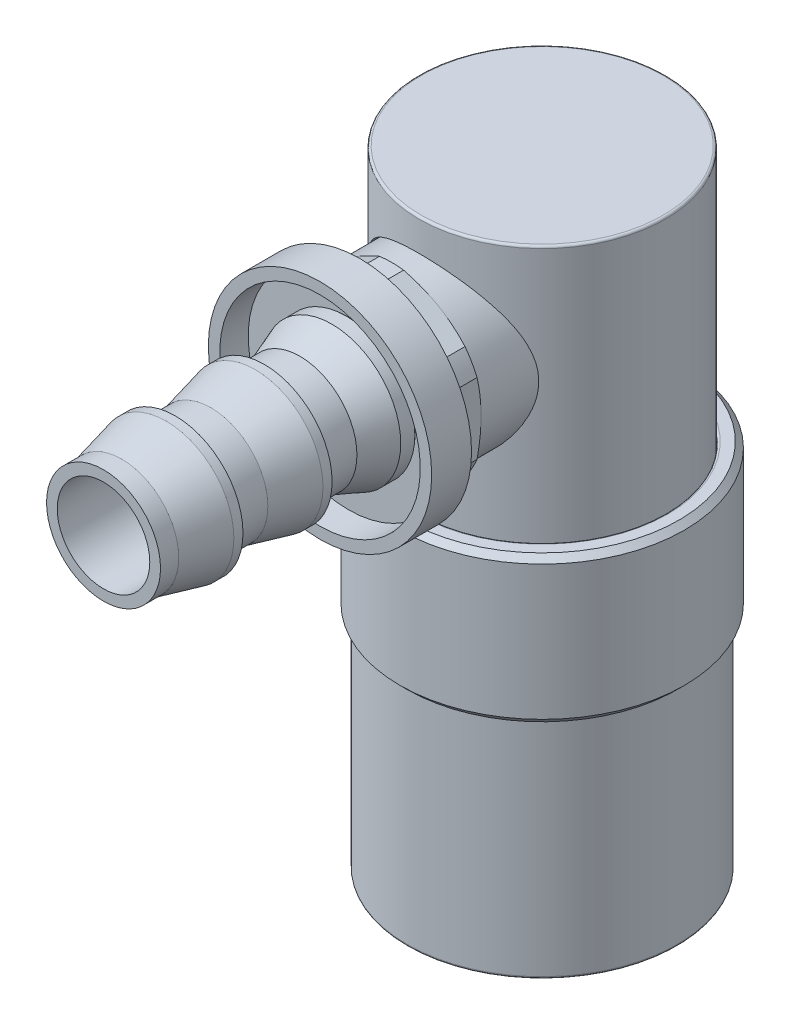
ISO-10303-21;
HEADER;
FILE_DESCRIPTION(('STEP AP214'),'2;1');
FILE_NAME('part.step','',(''),(''),'','','');
FILE_SCHEMA(('AUTOMOTIVE_DESIGN { 1 0 10303 214 1 1 1 1 }'));
ENDSEC;
DATA;
#1=APPLICATION_CONTEXT('core data for automotive mechanical design processes');
#2=APPLICATION_PROTOCOL_DEFINITION('international standard','automotive_design',2000,#1);
#3=PRODUCT_CONTEXT('',#1,'mechanical');
#4=PRODUCT('Part','Part','',(#3));
#5=PRODUCT_RELATED_PRODUCT_CATEGORY('part','',(#4));
#6=PRODUCT_DEFINITION_FORMATION('','',#4);
#7=PRODUCT_DEFINITION_CONTEXT('part definition',#1,'design');
#8=PRODUCT_DEFINITION('design','',#6,#7);
#9=PRODUCT_DEFINITION_SHAPE('','',#8);
#10=(LENGTH_UNIT() NAMED_UNIT(*) SI_UNIT(.MILLI.,.METRE.));
#11=(NAMED_UNIT(*) PLANE_ANGLE_UNIT() SI_UNIT($,.RADIAN.));
#12=(NAMED_UNIT(*) SI_UNIT($,.STERADIAN.) SOLID_ANGLE_UNIT());
#13=UNCERTAINTY_MEASURE_WITH_UNIT(LENGTH_MEASURE(1.E-05),#10,'distance_accuracy_value','');
#14=(GEOMETRIC_REPRESENTATION_CONTEXT(3) GLOBAL_UNCERTAINTY_ASSIGNED_CONTEXT((#13)) GLOBAL_UNIT_ASSIGNED_CONTEXT((#10,
#11,#12)) REPRESENTATION_CONTEXT('',''));
#15=CARTESIAN_POINT('',(0.,0.,0.));
#16=DIRECTION('',(0.,0.,1.));
#17=DIRECTION('',(1.,0.,0.));
#18=AXIS2_PLACEMENT_3D('',#15,#16,#17);
#19=CARTESIAN_POINT('',(0.,56.642,8.89));
#20=DIRECTION('',(0.,0.,-1.));
#21=DIRECTION('',(0.,-1.,0.));
#22=AXIS2_PLACEMENT_3D('',#19,#20,#21);
#23=CONICAL_SURFACE('',#22,6.4262,0.785398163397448);
#24=CARTESIAN_POINT('',(0.,56.642,10.16));
#25=DIRECTION('',(0.,0.,1.));
#26=DIRECTION('',(0.,-1.,0.));
#27=AXIS2_PLACEMENT_3D('',#24,#25,#26);
#28=CIRCLE('',#27,5.1562);
#29=CARTESIAN_POINT('',(0.,61.7982,10.16));
#30=VERTEX_POINT('',#29);
#31=CARTESIAN_POINT('',(0.,51.4858,10.16));
#32=VERTEX_POINT('',#31);
#33=EDGE_CURVE('P0_E11',#30,#32,#28,.T.);
#34=ORIENTED_EDGE('',*,*,#33,.T.);
#35=CARTESIAN_POINT('',(0.,56.642,10.16));
#36=DIRECTION('',(0.,0.,1.));
#37=DIRECTION('',(0.,-1.,0.));
#38=AXIS2_PLACEMENT_3D('',#35,#36,#37);
#39=CIRCLE('',#38,5.1562);
#40=EDGE_CURVE('P0_E29',#32,#30,#39,.T.);
#41=ORIENTED_EDGE('',*,*,#40,.T.);
#42=DIRECTION('',(0.,0.707106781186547,-0.707106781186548));
#43=VECTOR('',#42,1.);
#44=CARTESIAN_POINT('',(0.,63.0682,8.89));
#45=LINE('',#44,#43);
#46=CARTESIAN_POINT('',(0.,64.3382,7.62));
#47=VERTEX_POINT('',#46);
#48=EDGE_CURVE('P0_E264',#30,#47,#45,.T.);
#49=ORIENTED_EDGE('',*,*,#48,.T.);
#50=CARTESIAN_POINT('',(0.,56.642,7.62));
#51=DIRECTION('',(0.,0.,-1.));
#52=DIRECTION('',(0.,-1.,0.));
#53=AXIS2_PLACEMENT_3D('',#50,#51,#52);
#54=CIRCLE('',#53,7.6962);
#55=EDGE_CURVE('P0_E258',#47,#47,#54,.T.);
#56=ORIENTED_EDGE('',*,*,#55,.T.);
#57=ORIENTED_EDGE('',*,*,#48,.F.);
#58=EDGE_LOOP('',(#34,#41,#49,#56,#57));
#59=FACE_BOUND('',#58,.T.);
#60=ADVANCED_FACE('P0_F16',(#59),#23,.F.);
#61=CARTESIAN_POINT('',(0.,61.7982,7.62));
#62=DIRECTION('',(0.,0.,-1.));
#63=DIRECTION('',(0.,1.,0.));
#64=AXIS2_PLACEMENT_3D('',#61,#62,#63);
#65=PLANE('',#64);
#66=CARTESIAN_POINT('',(0.,56.642,7.62));
#67=DIRECTION('',(0.,0.,1.));
#68=DIRECTION('',(0.,1.,0.));
#69=AXIS2_PLACEMENT_3D('',#66,#67,#68);
#70=CIRCLE('',#69,8.509);
#71=CARTESIAN_POINT('',(0.,48.133,7.62));
#72=VERTEX_POINT('',#71);
#73=EDGE_CURVE('P0_E558',#72,#72,#70,.T.);
#74=ORIENTED_EDGE('',*,*,#73,.F.);
#75=EDGE_LOOP('',(#74));
#76=FACE_BOUND('',#75,.T.);
#77=ORIENTED_EDGE('',*,*,#55,.F.);
#78=EDGE_LOOP('',(#77));
#79=FACE_BOUND('',#78,.T.);
#80=ADVANCED_FACE('P0_F260',(#76,#79),#65,.T.);
#81=CARTESIAN_POINT('',(0.,56.642,28.2575));
#82=DIRECTION('',(0.,0.,-1.));
#83=DIRECTION('',(0.,1.,0.));
#84=AXIS2_PLACEMENT_3D('',#81,#82,#83);
#85=CYLINDRICAL_SURFACE('',#84,5.1562);
#86=ORIENTED_EDGE('',*,*,#33,.F.);
#87=ORIENTED_EDGE('',*,*,#40,.F.);
#88=DIRECTION('',(0.,0.,1.));
#89=VECTOR('',#88,1.);
#90=CARTESIAN_POINT('',(0.,51.4858,28.2575));
#91=LINE('',#90,#89);
#92=CARTESIAN_POINT('',(0.,51.4858,48.895));
#93=VERTEX_POINT('',#92);
#94=EDGE_CURVE('P0_E265',#32,#93,#91,.T.);
#95=ORIENTED_EDGE('',*,*,#94,.T.);
#96=CARTESIAN_POINT('',(0.,56.642,48.895));
#97=DIRECTION('',(0.,0.,-1.));
#98=DIRECTION('',(1.,0.,0.));
#99=AXIS2_PLACEMENT_3D('',#96,#97,#98);
#100=CIRCLE('',#99,5.1562);
#101=CARTESIAN_POINT('',(0.,61.7982,48.895));
#102=VERTEX_POINT('',#101);
#103=EDGE_CURVE('P0_E362',#102,#93,#100,.T.);
#104=ORIENTED_EDGE('',*,*,#103,.F.);
#105=CARTESIAN_POINT('',(0.,56.642,48.895));
#106=DIRECTION('',(0.,0.,-1.));
#107=DIRECTION('',(1.,0.,0.));
#108=AXIS2_PLACEMENT_3D('',#105,#106,#107);
#109=CIRCLE('',#108,5.1562);
#110=EDGE_CURVE('P0_E365',#93,#102,#109,.T.);
#111=ORIENTED_EDGE('',*,*,#110,.F.);
#112=ORIENTED_EDGE('',*,*,#94,.F.);
#113=EDGE_LOOP('',(#86,#87,#95,#104,#111,#112));
#114=FACE_BOUND('',#113,.T.);
#115=ADVANCED_FACE('P0_F1010',(#114),#85,.F.);
#116=CARTESIAN_POINT('',(0.,56.642,8.128));
#117=DIRECTION('',(0.,0.,1.));
#118=DIRECTION('',(0.,1.,0.));
#119=AXIS2_PLACEMENT_3D('',#116,#117,#118);
#120=CONICAL_SURFACE('',#119,9.017,0.785398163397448);
#121=ORIENTED_EDGE('',*,*,#73,.T.);
#122=DIRECTION('',(0.,-0.707106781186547,0.707106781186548));
#123=VECTOR('',#122,1.);
#124=CARTESIAN_POINT('',(0.,47.625,8.128));
#125=LINE('',#124,#123);
#126=CARTESIAN_POINT('',(0.,47.15764,8.59536));
#127=VERTEX_POINT('',#126);
#128=EDGE_CURVE('P0_E430',#72,#127,#125,.T.);
#129=ORIENTED_EDGE('',*,*,#128,.T.);
#130=CARTESIAN_POINT('',(0.,56.642,8.59536));
#131=DIRECTION('',(0.,0.,-1.));
#132=DIRECTION('',(0.,1.,0.));
#133=AXIS2_PLACEMENT_3D('',#130,#131,#132);
#134=CIRCLE('',#133,9.48436);
#135=EDGE_CURVE('P0_E423',#127,#127,#134,.T.);
#136=ORIENTED_EDGE('',*,*,#135,.T.);
#137=ORIENTED_EDGE('',*,*,#128,.F.);
#138=EDGE_LOOP('',(#121,#129,#136,#137));
#139=FACE_BOUND('',#138,.T.);
#140=ADVANCED_FACE('P0_F733',(#139),#120,.T.);
#141=CARTESIAN_POINT('',(0.,56.642,11.9761));
#142=DIRECTION('',(0.,0.,-1.));
#143=DIRECTION('',(0.,1.,0.));
#144=AXIS2_PLACEMENT_3D('',#141,#142,#143);
#145=CYLINDRICAL_SURFACE('',#144,9.48436);
#146=ORIENTED_EDGE('',*,*,#135,.F.);
#147=DIRECTION('',(0.,0.,1.));
#148=VECTOR('',#147,1.);
#149=CARTESIAN_POINT('',(0.,47.15764,11.9761));
#150=LINE('',#149,#148);
#151=CARTESIAN_POINT('',(0.,47.15764,16.3087364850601));
#152=VERTEX_POINT('',#151);
#153=EDGE_CURVE('P0_E431',#127,#152,#150,.T.);
#154=ORIENTED_EDGE('',*,*,#153,.T.);
#155=CARTESIAN_POINT('',(0.,56.642,16.3087364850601));
#156=DIRECTION('',(0.,0.,-1.));
#157=DIRECTION('',(0.,1.,0.));
#158=AXIS2_PLACEMENT_3D('',#155,#156,#157);
#159=CIRCLE('',#158,9.48436);
#160=CARTESIAN_POINT('',(-8.21369669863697,51.89982,16.3087364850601));
#161=VERTEX_POINT('',#160);
#162=EDGE_CURVE('P0_E449',#152,#161,#159,.T.);
#163=ORIENTED_EDGE('',*,*,#162,.T.);
#164=CARTESIAN_POINT('',(0.,56.642,16.3087364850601));
#165=DIRECTION('',(0.,0.,-1.));
#166=DIRECTION('',(0.,1.,0.));
#167=AXIS2_PLACEMENT_3D('',#164,#165,#166);
#168=CIRCLE('',#167,9.48436);
#169=EDGE_CURVE('P0_E453',#161,#152,#168,.T.);
#170=ORIENTED_EDGE('',*,*,#169,.T.);
#171=ORIENTED_EDGE('',*,*,#153,.F.);
#172=EDGE_LOOP('',(#146,#154,#163,#170,#171));
#173=FACE_BOUND('',#172,.T.);
#174=ADVANCED_FACE('P0_F729',(#173),#145,.T.);
#175=CARTESIAN_POINT('',(0.,45.6434773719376,7.62));
#176=DIRECTION('',(0.5,0.866025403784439,0.));
#177=DIRECTION('',(0.,0.,-1.));
#178=AXIS2_PLACEMENT_3D('',#175,#176,#177);
#179=PLANE('',#178);
#180=CARTESIAN_POINT('',(-1.33978520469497,46.4170027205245,16.7868056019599));
#181=CARTESIAN_POINT('',(-3.1190710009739,47.4442738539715,16.3322));
#182=CARTESIAN_POINT('',(-4.7625,48.3931080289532,16.3322));
#183=CARTESIAN_POINT('',(-6.40592899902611,49.341942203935,16.3322));
#184=CARTESIAN_POINT('',(-8.18521479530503,50.3692133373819,16.7868056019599));
#185=(BOUNDED_CURVE() B_SPLINE_CURVE(2,(#180,#181,#182,#183,#184),.UNSPECIFIED.,.F.,
.F.) B_SPLINE_CURVE_WITH_KNOTS((3,2,3),(0.,0.398430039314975,0.796860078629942),
.UNSPECIFIED.) CURVE() GEOMETRIC_REPRESENTATION_ITEM() RATIONAL_B_SPLINE_CURVE((1.,
1.02045741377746,1.,1.02045741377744,1.)) REPRESENTATION_ITEM(''));
#186=CARTESIAN_POINT('',(-1.33978520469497,46.4170027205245,16.7868056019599));
#187=VERTEX_POINT('',#186);
#188=CARTESIAN_POINT('',(-8.18521479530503,50.3692133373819,16.7868056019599));
#189=VERTEX_POINT('',#188);
#190=EDGE_CURVE('P0_E336',#187,#189,#185,.T.);
#191=ORIENTED_EDGE('',*,*,#190,.F.);
#192=DIRECTION('',(0.,0.,-1.));
#193=VECTOR('',#192,1.);
#194=CARTESIAN_POINT('',(-1.33978520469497,46.4170027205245,18.2482891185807));
#195=LINE('',#194,#193);
#196=CARTESIAN_POINT('',(-1.33978520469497,46.4170027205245,19.7097726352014));
#197=VERTEX_POINT('',#196);
#198=EDGE_CURVE('P0_E330',#197,#187,#195,.T.);
#199=ORIENTED_EDGE('',*,*,#198,.F.);
#200=CARTESIAN_POINT('',(-8.18521479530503,50.3692133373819,19.7097726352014));
#201=CARTESIAN_POINT('',(-4.76249999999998,48.3931080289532,20.584272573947));
#202=CARTESIAN_POINT('',(-1.33978520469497,46.4170027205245,19.7097726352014));
#203=(BOUNDED_CURVE() B_SPLINE_CURVE(2,(#200,#201,#202),.UNSPECIFIED.,.F.,
.F.) B_SPLINE_CURVE_WITH_KNOTS((3,3),(0.,0.795654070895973),
.UNSPECIFIED.) CURVE() GEOMETRIC_REPRESENTATION_ITEM() RATIONAL_B_SPLINE_CURVE((1.,
1.08266666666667,1.)) REPRESENTATION_ITEM(''));
#204=CARTESIAN_POINT('',(-8.18521479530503,50.3692133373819,19.7097726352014));
#205=VERTEX_POINT('',#204);
#206=EDGE_CURVE('P0_E304',#205,#197,#203,.T.);
#207=ORIENTED_EDGE('',*,*,#206,.F.);
#208=DIRECTION('',(0.,0.,1.));
#209=VECTOR('',#208,1.);
#210=CARTESIAN_POINT('',(-8.18521479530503,50.3692133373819,18.2482891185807));
#211=LINE('',#210,#209);
#212=EDGE_CURVE('P0_E320',#189,#205,#211,.T.);
#213=ORIENTED_EDGE('',*,*,#212,.F.);
#214=EDGE_LOOP('',(#191,#199,#207,#213));
#215=FACE_BOUND('',#214,.T.);
#216=ADVANCED_FACE('P0_F1302',(#215),#179,.F.);
#217=CARTESIAN_POINT('',(9.525,51.1427386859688,7.62));
#218=DIRECTION('',(-0.5,0.866025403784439,0.));
#219=DIRECTION('',(-0.866025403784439,-0.5,0.));
#220=AXIS2_PLACEMENT_3D('',#217,#218,#219);
#221=PLANE('',#220);
#222=CARTESIAN_POINT('',(8.18521479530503,50.3692133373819,16.7868056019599));
#223=CARTESIAN_POINT('',(6.4059289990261,49.341942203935,16.3322));
#224=CARTESIAN_POINT('',(4.7625,48.3931080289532,16.3322));
#225=CARTESIAN_POINT('',(3.11907100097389,47.4442738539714,16.3322));
#226=CARTESIAN_POINT('',(1.33978520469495,46.4170027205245,16.7868056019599));
#227=(BOUNDED_CURVE() B_SPLINE_CURVE(2,(#222,#223,#224,#225,#226),.UNSPECIFIED.,.F.,
.F.) B_SPLINE_CURVE_WITH_KNOTS((3,2,3),(0.,0.398430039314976,0.796860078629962),
.UNSPECIFIED.) CURVE() GEOMETRIC_REPRESENTATION_ITEM() RATIONAL_B_SPLINE_CURVE((1.,
1.02045741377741,1.,1.02045741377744,1.)) REPRESENTATION_ITEM(''));
#228=CARTESIAN_POINT('',(8.18521479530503,50.3692133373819,16.7868056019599));
#229=VERTEX_POINT('',#228);
#230=CARTESIAN_POINT('',(1.33978520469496,46.4170027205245,16.7868056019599));
#231=VERTEX_POINT('',#230);
#232=EDGE_CURVE('P0_E458',#229,#231,#227,.T.);
#233=ORIENTED_EDGE('',*,*,#232,.F.);
#234=DIRECTION('',(0.,0.,-1.));
#235=VECTOR('',#234,1.);
#236=CARTESIAN_POINT('',(8.18521479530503,50.3692133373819,18.2482891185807));
#237=LINE('',#236,#235);
#238=CARTESIAN_POINT('',(8.18521479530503,50.3692133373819,19.7097726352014));
#239=VERTEX_POINT('',#238);
#240=EDGE_CURVE('P0_E402',#239,#229,#237,.T.);
#241=ORIENTED_EDGE('',*,*,#240,.F.);
#242=CARTESIAN_POINT('',(1.33978520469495,46.4170027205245,19.7097726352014));
#243=CARTESIAN_POINT('',(4.76249999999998,48.3931080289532,20.584272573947));
#244=CARTESIAN_POINT('',(8.18521479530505,50.3692133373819,19.7097726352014));
#245=(BOUNDED_CURVE() B_SPLINE_CURVE(2,(#242,#243,#244),.UNSPECIFIED.,.F.,
.F.) B_SPLINE_CURVE_WITH_KNOTS((3,3),(0.,0.795654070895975),
.UNSPECIFIED.) CURVE() GEOMETRIC_REPRESENTATION_ITEM() RATIONAL_B_SPLINE_CURVE((1.,
1.08266666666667,1.)) REPRESENTATION_ITEM(''));
#246=CARTESIAN_POINT('',(1.33978520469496,46.4170027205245,19.7097726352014));
#247=VERTEX_POINT('',#246);
#248=EDGE_CURVE('P0_E421',#247,#239,#245,.T.);
#249=ORIENTED_EDGE('',*,*,#248,.F.);
#250=DIRECTION('',(0.,0.,1.));
#251=VECTOR('',#250,1.);
#252=CARTESIAN_POINT('',(1.33978520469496,46.4170027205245,18.2482891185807));
#253=LINE('',#252,#251);
#254=EDGE_CURVE('P0_E326',#231,#247,#253,.T.);
#255=ORIENTED_EDGE('',*,*,#254,.F.);
#256=EDGE_LOOP('',(#233,#241,#249,#255));
#257=FACE_BOUND('',#256,.T.);
#258=ADVANCED_FACE('P0_F1037',(#257),#221,.F.);
#259=CARTESIAN_POINT('',(9.525,62.1412613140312,7.62));
#260=DIRECTION('',(-1.,0.,0.));
#261=DIRECTION('',(0.,-1.,0.));
#262=AXIS2_PLACEMENT_3D('',#259,#260,#261);
#263=PLANE('',#262);
#264=CARTESIAN_POINT('',(9.525,60.5942106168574,16.7868056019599));
#265=CARTESIAN_POINT('',(9.525,58.5396683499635,16.3322));
#266=CARTESIAN_POINT('',(9.525,56.642,16.3322));
#267=CARTESIAN_POINT('',(9.525,54.7443316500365,16.3322));
#268=CARTESIAN_POINT('',(9.525,52.6897893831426,16.7868056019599));
#269=(BOUNDED_CURVE() B_SPLINE_CURVE(2,(#264,#265,#266,#267,#268),.UNSPECIFIED.,.F.,
.F.) B_SPLINE_CURVE_WITH_KNOTS((3,2,3),(0.,0.398430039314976,0.796860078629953),
.UNSPECIFIED.) CURVE() GEOMETRIC_REPRESENTATION_ITEM() RATIONAL_B_SPLINE_CURVE((1.,
1.02045741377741,1.,1.02045741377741,1.)) REPRESENTATION_ITEM(''));
#270=CARTESIAN_POINT('',(9.525,60.5942106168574,16.7868056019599));
#271=VERTEX_POINT('',#270);
#272=CARTESIAN_POINT('',(9.525,52.6897893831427,16.7868056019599));
#273=VERTEX_POINT('',#272);
#274=EDGE_CURVE('P0_E390',#271,#273,#269,.T.);
#275=ORIENTED_EDGE('',*,*,#274,.F.);
#276=DIRECTION('',(0.,0.,-1.));
#277=VECTOR('',#276,1.);
#278=CARTESIAN_POINT('',(9.525,60.5942106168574,18.2482891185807));
#279=LINE('',#278,#277);
#280=CARTESIAN_POINT('',(9.525,60.5942106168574,19.7097726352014));
#281=VERTEX_POINT('',#280);
#282=EDGE_CURVE('P0_E407',#281,#271,#279,.T.);
#283=ORIENTED_EDGE('',*,*,#282,.F.);
#284=CARTESIAN_POINT('',(9.525,52.6897893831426,19.7097726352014));
#285=CARTESIAN_POINT('',(9.52499999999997,56.642,20.584272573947));
#286=CARTESIAN_POINT('',(9.525,60.5942106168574,19.7097726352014));
#287=(BOUNDED_CURVE() B_SPLINE_CURVE(2,(#284,#285,#286),.UNSPECIFIED.,.F.,
.F.) B_SPLINE_CURVE_WITH_KNOTS((3,3),(0.,0.795654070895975),
.UNSPECIFIED.) CURVE() GEOMETRIC_REPRESENTATION_ITEM() RATIONAL_B_SPLINE_CURVE((1.,
1.08266666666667,1.)) REPRESENTATION_ITEM(''));
#288=CARTESIAN_POINT('',(9.525,52.6897893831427,19.7097726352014));
#289=VERTEX_POINT('',#288);
#290=EDGE_CURVE('P0_E416',#289,#281,#287,.T.);
#291=ORIENTED_EDGE('',*,*,#290,.F.);
#292=DIRECTION('',(0.,0.,1.));
#293=VECTOR('',#292,1.);
#294=CARTESIAN_POINT('',(9.525,52.6897893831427,18.2482891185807));
#295=LINE('',#294,#293);
#296=EDGE_CURVE('P0_E406',#273,#289,#295,.T.);
#297=ORIENTED_EDGE('',*,*,#296,.F.);
#298=EDGE_LOOP('',(#275,#283,#291,#297));
#299=FACE_BOUND('',#298,.T.);
#300=ADVANCED_FACE('P0_F1034',(#299),#263,.F.);
#301=CARTESIAN_POINT('',(0.,67.6405226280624,7.62));
#302=DIRECTION('',(-0.5,-0.866025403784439,0.));
#303=DIRECTION('',(0.,0.,1.));
#304=AXIS2_PLACEMENT_3D('',#301,#302,#303);
#305=PLANE('',#304);
#306=CARTESIAN_POINT('',(1.33978520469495,66.8669972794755,16.7868056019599));
#307=CARTESIAN_POINT('',(3.1190710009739,65.8397261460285,16.3322));
#308=CARTESIAN_POINT('',(4.7625,64.8908919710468,16.3322));
#309=CARTESIAN_POINT('',(6.40592899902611,63.942057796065,16.3322));
#310=CARTESIAN_POINT('',(8.18521479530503,62.9147866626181,16.7868056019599));
#311=(BOUNDED_CURVE() B_SPLINE_CURVE(2,(#306,#307,#308,#309,#310),.UNSPECIFIED.,.F.,
.F.) B_SPLINE_CURVE_WITH_KNOTS((3,2,3),(0.,0.398430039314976,0.796860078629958),
.UNSPECIFIED.) CURVE() GEOMETRIC_REPRESENTATION_ITEM() RATIONAL_B_SPLINE_CURVE((1.,
1.02045741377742,1.,1.02045741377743,1.)) REPRESENTATION_ITEM(''));
#312=CARTESIAN_POINT('',(1.33978520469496,66.8669972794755,16.7868056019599));
#313=VERTEX_POINT('',#312);
#314=CARTESIAN_POINT('',(8.18521479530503,62.9147866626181,16.7868056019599));
#315=VERTEX_POINT('',#314);
#316=EDGE_CURVE('P0_E389',#313,#315,#311,.T.);
#317=ORIENTED_EDGE('',*,*,#316,.F.);
#318=DIRECTION('',(0.,0.,-1.));
#319=VECTOR('',#318,1.);
#320=CARTESIAN_POINT('',(1.33978520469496,66.8669972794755,18.2482891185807));
#321=LINE('',#320,#319);
#322=CARTESIAN_POINT('',(1.33978520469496,66.8669972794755,19.7097726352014));
#323=VERTEX_POINT('',#322);
#324=EDGE_CURVE('P0_E607',#323,#313,#321,.T.);
#325=ORIENTED_EDGE('',*,*,#324,.F.);
#326=CARTESIAN_POINT('',(8.18521479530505,62.9147866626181,19.7097726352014));
#327=CARTESIAN_POINT('',(4.76249999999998,64.8908919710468,20.584272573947));
#328=CARTESIAN_POINT('',(1.33978520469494,66.8669972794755,19.7097726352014));
#329=(BOUNDED_CURVE() B_SPLINE_CURVE(2,(#326,#327,#328),.UNSPECIFIED.,.F.,
.F.) B_SPLINE_CURVE_WITH_KNOTS((3,3),(0.,0.795654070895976),
.UNSPECIFIED.) CURVE() GEOMETRIC_REPRESENTATION_ITEM() RATIONAL_B_SPLINE_CURVE((1.,
1.08266666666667,1.)) REPRESENTATION_ITEM(''));
#330=CARTESIAN_POINT('',(8.18521479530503,62.9147866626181,19.7097726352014));
#331=VERTEX_POINT('',#330);
#332=EDGE_CURVE('P0_E422',#331,#323,#329,.T.);
#333=ORIENTED_EDGE('',*,*,#332,.F.);
#334=DIRECTION('',(0.,0.,1.));
#335=VECTOR('',#334,1.);
#336=CARTESIAN_POINT('',(8.18521479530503,62.9147866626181,18.2482891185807));
#337=LINE('',#336,#335);
#338=EDGE_CURVE('P0_E412',#315,#331,#337,.T.);
#339=ORIENTED_EDGE('',*,*,#338,.F.);
#340=EDGE_LOOP('',(#317,#325,#333,#339));
#341=FACE_BOUND('',#340,.T.);
#342=ADVANCED_FACE('P0_F1036',(#341),#305,.F.);
#343=CARTESIAN_POINT('',(-9.525,62.1412613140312,7.62));
#344=DIRECTION('',(0.5,-0.866025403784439,0.));
#345=DIRECTION('',(0.,0.,-1.));
#346=AXIS2_PLACEMENT_3D('',#343,#344,#345);
#347=PLANE('',#346);
#348=CARTESIAN_POINT('',(-8.18521479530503,62.9147866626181,16.7868056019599));
#349=CARTESIAN_POINT('',(-6.4059289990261,63.942057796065,16.3322));
#350=CARTESIAN_POINT('',(-4.7625,64.8908919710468,16.3322));
#351=CARTESIAN_POINT('',(-3.11907100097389,65.8397261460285,16.3322));
#352=CARTESIAN_POINT('',(-1.33978520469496,66.8669972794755,16.7868056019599));
#353=(BOUNDED_CURVE() B_SPLINE_CURVE(2,(#348,#349,#350,#351,#352),.UNSPECIFIED.,.F.,
.F.) B_SPLINE_CURVE_WITH_KNOTS((3,2,3),(0.,0.398430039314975,0.796860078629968),
.UNSPECIFIED.) CURVE() GEOMETRIC_REPRESENTATION_ITEM() RATIONAL_B_SPLINE_CURVE((1.,
1.02045741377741,1.,1.02045741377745,1.)) REPRESENTATION_ITEM(''));
#354=CARTESIAN_POINT('',(-8.18521479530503,62.9147866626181,16.7868056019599));
#355=VERTEX_POINT('',#354);
#356=CARTESIAN_POINT('',(-1.33978520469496,66.8669972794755,16.7868056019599));
#357=VERTEX_POINT('',#356);
#358=EDGE_CURVE('P0_E289',#355,#357,#353,.T.);
#359=ORIENTED_EDGE('',*,*,#358,.F.);
#360=DIRECTION('',(0.,0.,-1.));
#361=VECTOR('',#360,1.);
#362=CARTESIAN_POINT('',(-8.18521479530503,62.9147866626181,18.2482891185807));
#363=LINE('',#362,#361);
#364=CARTESIAN_POINT('',(-8.18521479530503,62.9147866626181,19.7097726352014));
#365=VERTEX_POINT('',#364);
#366=EDGE_CURVE('P0_E378',#365,#355,#363,.T.);
#367=ORIENTED_EDGE('',*,*,#366,.F.);
#368=CARTESIAN_POINT('',(-1.33978520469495,66.8669972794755,19.7097726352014));
#369=CARTESIAN_POINT('',(-4.7625,64.8908919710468,20.584272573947));
#370=CARTESIAN_POINT('',(-8.18521479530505,62.9147866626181,19.7097726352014));
#371=(BOUNDED_CURVE() B_SPLINE_CURVE(2,(#368,#369,#370),.UNSPECIFIED.,.F.,
.F.) B_SPLINE_CURVE_WITH_KNOTS((3,3),(0.,0.795654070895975),
.UNSPECIFIED.) CURVE() GEOMETRIC_REPRESENTATION_ITEM() RATIONAL_B_SPLINE_CURVE((1.,
1.08266666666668,1.)) REPRESENTATION_ITEM(''));
#372=CARTESIAN_POINT('',(-1.33978520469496,66.8669972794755,19.7097726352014));
#373=VERTEX_POINT('',#372);
#374=EDGE_CURVE('P0_E20',#373,#365,#371,.T.);
#375=ORIENTED_EDGE('',*,*,#374,.F.);
#376=DIRECTION('',(0.,0.,1.));
#377=VECTOR('',#376,1.);
#378=CARTESIAN_POINT('',(-1.33978520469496,66.8669972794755,18.2482891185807));
#379=LINE('',#378,#377);
#380=EDGE_CURVE('P0_E603',#357,#373,#379,.T.);
#381=ORIENTED_EDGE('',*,*,#380,.F.);
#382=EDGE_LOOP('',(#359,#367,#375,#381));
#383=FACE_BOUND('',#382,.T.);
#384=ADVANCED_FACE('P0_F1074',(#383),#347,.F.);
#385=CARTESIAN_POINT('',(-9.525,51.1427386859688,7.62));
#386=DIRECTION('',(1.,0.,0.));
#387=DIRECTION('',(0.,-1.,0.));
#388=AXIS2_PLACEMENT_3D('',#385,#386,#387);
#389=PLANE('',#388);
#390=CARTESIAN_POINT('',(-9.525,52.6897893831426,16.7868056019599));
#391=CARTESIAN_POINT('',(-9.525,54.7443316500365,16.3322));
#392=CARTESIAN_POINT('',(-9.525,56.642,16.3322));
#393=CARTESIAN_POINT('',(-9.525,58.5396683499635,16.3322));
#394=CARTESIAN_POINT('',(-9.525,60.5942106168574,16.7868056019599));
#395=(BOUNDED_CURVE() B_SPLINE_CURVE(2,(#390,#391,#392,#393,#394),.UNSPECIFIED.,.F.,
.F.) B_SPLINE_CURVE_WITH_KNOTS((3,2,3),(0.,0.398430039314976,0.796860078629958),
.UNSPECIFIED.) CURVE() GEOMETRIC_REPRESENTATION_ITEM() RATIONAL_B_SPLINE_CURVE((1.,
1.02045741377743,1.,1.02045741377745,1.)) REPRESENTATION_ITEM(''));
#396=CARTESIAN_POINT('',(-9.525,52.6897893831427,16.7868056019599));
#397=VERTEX_POINT('',#396);
#398=CARTESIAN_POINT('',(-9.525,60.5942106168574,16.7868056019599));
#399=VERTEX_POINT('',#398);
#400=EDGE_CURVE('P0_E479',#397,#399,#395,.T.);
#401=ORIENTED_EDGE('',*,*,#400,.F.);
#402=DIRECTION('',(0.,0.,-1.));
#403=VECTOR('',#402,1.);
#404=CARTESIAN_POINT('',(-9.525,52.6897893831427,18.2482891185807));
#405=LINE('',#404,#403);
#406=CARTESIAN_POINT('',(-9.525,52.6897893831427,19.7097726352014));
#407=VERTEX_POINT('',#406);
#408=EDGE_CURVE('P0_E391',#407,#397,#405,.T.);
#409=ORIENTED_EDGE('',*,*,#408,.F.);
#410=CARTESIAN_POINT('',(-9.525,60.5942106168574,19.7097726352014));
#411=CARTESIAN_POINT('',(-9.52499999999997,56.642,20.584272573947));
#412=CARTESIAN_POINT('',(-9.525,52.6897893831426,19.7097726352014));
#413=(BOUNDED_CURVE() B_SPLINE_CURVE(2,(#410,#411,#412),.UNSPECIFIED.,.F.,
.F.) B_SPLINE_CURVE_WITH_KNOTS((3,3),(0.,0.795654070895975),
.UNSPECIFIED.) CURVE() GEOMETRIC_REPRESENTATION_ITEM() RATIONAL_B_SPLINE_CURVE((1.,
1.08266666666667,1.)) REPRESENTATION_ITEM(''));
#414=CARTESIAN_POINT('',(-9.525,60.5942106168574,19.7097726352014));
#415=VERTEX_POINT('',#414);
#416=EDGE_CURVE('P0_E562',#415,#407,#413,.T.);
#417=ORIENTED_EDGE('',*,*,#416,.F.);
#418=DIRECTION('',(0.,0.,1.));
#419=VECTOR('',#418,1.);
#420=CARTESIAN_POINT('',(-9.525,60.5942106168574,18.2482891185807));
#421=LINE('',#420,#419);
#422=EDGE_CURVE('P0_E374',#399,#415,#421,.T.);
#423=ORIENTED_EDGE('',*,*,#422,.F.);
#424=EDGE_LOOP('',(#401,#409,#417,#423));
#425=FACE_BOUND('',#424,.T.);
#426=ADVANCED_FACE('P0_F1077',(#425),#389,.F.);
#427=CARTESIAN_POINT('',(0.,56.642,16.55950280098));
#428=DIRECTION('',(0.,0.,1.));
#429=DIRECTION('',(0.,1.,0.));
#430=AXIS2_PLACEMENT_3D('',#427,#428,#429);
#431=CONICAL_SURFACE('',#430,9.9187,1.0471975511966);
#432=ORIENTED_EDGE('',*,*,#169,.F.);
#433=ORIENTED_EDGE('',*,*,#162,.F.);
#434=DIRECTION('',(0.,-0.866025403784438,0.5));
#435=VECTOR('',#434,1.);
#436=CARTESIAN_POINT('',(0.,46.7233,16.55950280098));
#437=LINE('',#436,#435);
#438=CARTESIAN_POINT('',(0.,46.3296,16.7868056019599));
#439=VERTEX_POINT('',#438);
#440=EDGE_CURVE('P0_E493',#152,#439,#437,.T.);
#441=ORIENTED_EDGE('',*,*,#440,.T.);
#442=CARTESIAN_POINT('',(0.,56.642,16.7868056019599));
#443=DIRECTION('',(0.,0.,-1.));
#444=DIRECTION('',(1.,0.,0.));
#445=AXIS2_PLACEMENT_3D('',#442,#443,#444);
#446=CIRCLE('',#445,10.3124);
#447=EDGE_CURVE('P0_E342',#439,#187,#446,.T.);
#448=ORIENTED_EDGE('',*,*,#447,.T.);
#449=ORIENTED_EDGE('',*,*,#190,.T.);
#450=CARTESIAN_POINT('',(0.,56.642,16.7868056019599));
#451=DIRECTION('',(0.,0.,-1.));
#452=DIRECTION('',(1.,0.,0.));
#453=AXIS2_PLACEMENT_3D('',#450,#451,#452);
#454=CIRCLE('',#453,10.3124);
#455=EDGE_CURVE('P0_E343',#189,#397,#454,.T.);
#456=ORIENTED_EDGE('',*,*,#455,.T.);
#457=ORIENTED_EDGE('',*,*,#400,.T.);
#458=CARTESIAN_POINT('',(0.,56.642,16.7868056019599));
#459=DIRECTION('',(0.,0.,-1.));
#460=DIRECTION('',(1.,0.,0.));
#461=AXIS2_PLACEMENT_3D('',#458,#459,#460);
#462=CIRCLE('',#461,10.3124);
#463=EDGE_CURVE('P0_E295',#399,#355,#462,.T.);
#464=ORIENTED_EDGE('',*,*,#463,.T.);
#465=ORIENTED_EDGE('',*,*,#358,.T.);
#466=CARTESIAN_POINT('',(0.,56.642,16.7868056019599));
#467=DIRECTION('',(0.,0.,-1.));
#468=DIRECTION('',(1.,0.,0.));
#469=AXIS2_PLACEMENT_3D('',#466,#467,#468);
#470=CIRCLE('',#469,10.3124);
#471=EDGE_CURVE('P0_E296',#357,#313,#470,.T.);
#472=ORIENTED_EDGE('',*,*,#471,.T.);
#473=ORIENTED_EDGE('',*,*,#316,.T.);
#474=CARTESIAN_POINT('',(0.,56.642,16.7868056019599));
#475=DIRECTION('',(0.,0.,-1.));
#476=DIRECTION('',(1.,0.,0.));
#477=AXIS2_PLACEMENT_3D('',#474,#475,#476);
#478=CIRCLE('',#477,10.3124);
#479=EDGE_CURVE('P0_E385',#315,#271,#478,.T.);
#480=ORIENTED_EDGE('',*,*,#479,.T.);
#481=ORIENTED_EDGE('',*,*,#274,.T.);
#482=CARTESIAN_POINT('',(0.,56.642,16.7868056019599));
#483=DIRECTION('',(0.,0.,-1.));
#484=DIRECTION('',(1.,0.,0.));
#485=AXIS2_PLACEMENT_3D('',#482,#483,#484);
#486=CIRCLE('',#485,10.3124);
#487=EDGE_CURVE('P0_E454',#273,#229,#486,.T.);
#488=ORIENTED_EDGE('',*,*,#487,.T.);
#489=ORIENTED_EDGE('',*,*,#232,.T.);
#490=CARTESIAN_POINT('',(0.,56.642,16.7868056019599));
#491=DIRECTION('',(0.,0.,-1.));
#492=DIRECTION('',(1.,0.,0.));
#493=AXIS2_PLACEMENT_3D('',#490,#491,#492);
#494=CIRCLE('',#493,10.3124);
#495=EDGE_CURVE('P0_E324',#231,#439,#494,.T.);
#496=ORIENTED_EDGE('',*,*,#495,.T.);
#497=ORIENTED_EDGE('',*,*,#440,.F.);
#498=EDGE_LOOP('',(#432,#433,#441,#448,#449,#456,#457,#464,#465,#472,#473,#480,#481,#488,#489,
#496,#497));
#499=FACE_BOUND('',#498,.T.);
#500=ADVANCED_FACE('P0_F640',(#499),#431,.T.);
#501=CARTESIAN_POINT('',(0.,56.642,18.2482891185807));
#502=DIRECTION('',(0.,0.,-1.));
#503=DIRECTION('',(0.,1.,0.));
#504=AXIS2_PLACEMENT_3D('',#501,#502,#503);
#505=CYLINDRICAL_SURFACE('',#504,10.3124);
#506=ORIENTED_EDGE('',*,*,#212,.T.);
#507=CARTESIAN_POINT('',(0.,56.642,19.7097726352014));
#508=DIRECTION('',(0.,0.,-1.));
#509=DIRECTION('',(1.,0.,0.));
#510=AXIS2_PLACEMENT_3D('',#507,#508,#509);
#511=CIRCLE('',#510,10.3124);
#512=EDGE_CURVE('P0_E325',#205,#407,#511,.T.);
#513=ORIENTED_EDGE('',*,*,#512,.T.);
#514=ORIENTED_EDGE('',*,*,#408,.T.);
#515=ORIENTED_EDGE('',*,*,#455,.F.);
#516=EDGE_LOOP('',(#506,#513,#514,#515));
#517=FACE_BOUND('',#516,.T.);
#518=ADVANCED_FACE('P0_F1023',(#517),#505,.T.);
#519=CARTESIAN_POINT('',(0.,56.642,18.2482891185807));
#520=DIRECTION('',(0.,0.,-1.));
#521=DIRECTION('',(0.,1.,0.));
#522=AXIS2_PLACEMENT_3D('',#519,#520,#521);
#523=CYLINDRICAL_SURFACE('',#522,10.3124);
#524=ORIENTED_EDGE('',*,*,#366,.T.);
#525=ORIENTED_EDGE('',*,*,#463,.F.);
#526=ORIENTED_EDGE('',*,*,#422,.T.);
#527=CARTESIAN_POINT('',(0.,56.642,19.7097726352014));
#528=DIRECTION('',(0.,0.,-1.));
#529=DIRECTION('',(1.,0.,0.));
#530=AXIS2_PLACEMENT_3D('',#527,#528,#529);
#531=CIRCLE('',#530,10.3124);
#532=EDGE_CURVE('P0_E379',#415,#365,#531,.T.);
#533=ORIENTED_EDGE('',*,*,#532,.T.);
#534=EDGE_LOOP('',(#524,#525,#526,#533));
#535=FACE_BOUND('',#534,.T.);
#536=ADVANCED_FACE('P0_F1026',(#535),#523,.T.);
#537=CARTESIAN_POINT('',(0.,56.642,18.2482891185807));
#538=DIRECTION('',(0.,0.,-1.));
#539=DIRECTION('',(0.,1.,0.));
#540=AXIS2_PLACEMENT_3D('',#537,#538,#539);
#541=CYLINDRICAL_SURFACE('',#540,10.3124);
#542=ORIENTED_EDGE('',*,*,#324,.T.);
#543=ORIENTED_EDGE('',*,*,#471,.F.);
#544=ORIENTED_EDGE('',*,*,#380,.T.);
#545=CARTESIAN_POINT('',(0.,56.642,19.7097726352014));
#546=DIRECTION('',(0.,0.,-1.));
#547=DIRECTION('',(1.,0.,0.));
#548=AXIS2_PLACEMENT_3D('',#545,#546,#547);
#549=CIRCLE('',#548,10.3124);
#550=EDGE_CURVE('P0_E411',#373,#323,#549,.T.);
#551=ORIENTED_EDGE('',*,*,#550,.T.);
#552=EDGE_LOOP('',(#542,#543,#544,#551));
#553=FACE_BOUND('',#552,.T.);
#554=ADVANCED_FACE('P0_F645',(#553),#541,.T.);
#555=CARTESIAN_POINT('',(0.,56.642,18.2482891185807));
#556=DIRECTION('',(0.,0.,-1.));
#557=DIRECTION('',(0.,1.,0.));
#558=AXIS2_PLACEMENT_3D('',#555,#556,#557);
#559=CYLINDRICAL_SURFACE('',#558,10.3124);
#560=ORIENTED_EDGE('',*,*,#282,.T.);
#561=ORIENTED_EDGE('',*,*,#479,.F.);
#562=ORIENTED_EDGE('',*,*,#338,.T.);
#563=CARTESIAN_POINT('',(0.,56.642,19.7097726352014));
#564=DIRECTION('',(0.,0.,-1.));
#565=DIRECTION('',(1.,0.,0.));
#566=AXIS2_PLACEMENT_3D('',#563,#564,#565);
#567=CIRCLE('',#566,10.3124);
#568=EDGE_CURVE('P0_E405',#331,#281,#567,.T.);
#569=ORIENTED_EDGE('',*,*,#568,.T.);
#570=EDGE_LOOP('',(#560,#561,#562,#569));
#571=FACE_BOUND('',#570,.T.);
#572=ADVANCED_FACE('P0_F1028',(#571),#559,.T.);
#573=CARTESIAN_POINT('',(0.,56.642,18.2482891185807));
#574=DIRECTION('',(0.,0.,-1.));
#575=DIRECTION('',(0.,1.,0.));
#576=AXIS2_PLACEMENT_3D('',#573,#574,#575);
#577=CYLINDRICAL_SURFACE('',#576,10.3124);
#578=ORIENTED_EDGE('',*,*,#240,.T.);
#579=ORIENTED_EDGE('',*,*,#487,.F.);
#580=ORIENTED_EDGE('',*,*,#296,.T.);
#581=CARTESIAN_POINT('',(0.,56.642,19.7097726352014));
#582=DIRECTION('',(0.,0.,-1.));
#583=DIRECTION('',(1.,0.,0.));
#584=AXIS2_PLACEMENT_3D('',#581,#582,#583);
#585=CIRCLE('',#584,10.3124);
#586=EDGE_CURVE('P0_E538',#289,#239,#585,.T.);
#587=ORIENTED_EDGE('',*,*,#586,.T.);
#588=EDGE_LOOP('',(#578,#579,#580,#587));
#589=FACE_BOUND('',#588,.T.);
#590=ADVANCED_FACE('P0_F18',(#589),#577,.T.);
#591=CARTESIAN_POINT('',(0.,56.642,47.879));
#592=DIRECTION('',(0.,0.,-1.));
#593=DIRECTION('',(0.,1.,0.));
#594=AXIS2_PLACEMENT_3D('',#591,#592,#593);
#595=CYLINDRICAL_SURFACE('',#594,6.3499492);
#596=CARTESIAN_POINT('',(0.,56.642,46.863));
#597=DIRECTION('',(0.,0.,-1.));
#598=DIRECTION('',(1.,0.,0.));
#599=AXIS2_PLACEMENT_3D('',#596,#597,#598);
#600=CIRCLE('',#599,6.3499492);
#601=CARTESIAN_POINT('',(0.,62.9919492,46.863));
#602=VERTEX_POINT('',#601);
#603=CARTESIAN_POINT('',(0.,50.2920508,46.863));
#604=VERTEX_POINT('',#603);
#605=EDGE_CURVE('P0_E380',#602,#604,#600,.T.);
#606=ORIENTED_EDGE('',*,*,#605,.F.);
#607=CARTESIAN_POINT('',(0.,56.642,46.863));
#608=DIRECTION('',(0.,0.,-1.));
#609=DIRECTION('',(1.,0.,0.));
#610=AXIS2_PLACEMENT_3D('',#607,#608,#609);
#611=CIRCLE('',#610,6.3499492);
#612=EDGE_CURVE('P0_E383',#604,#602,#611,.T.);
#613=ORIENTED_EDGE('',*,*,#612,.F.);
#614=DIRECTION('',(0.,0.,1.));
#615=VECTOR('',#614,1.);
#616=CARTESIAN_POINT('',(0.,50.2920508,47.879));
#617=LINE('',#616,#615);
#618=CARTESIAN_POINT('',(0.,50.2920508,48.895));
#619=VERTEX_POINT('',#618);
#620=EDGE_CURVE('P0_E478',#604,#619,#617,.T.);
#621=ORIENTED_EDGE('',*,*,#620,.T.);
#622=CARTESIAN_POINT('',(0.,56.642,48.895));
#623=DIRECTION('',(0.,0.,-1.));
#624=DIRECTION('',(1.,0.,0.));
#625=AXIS2_PLACEMENT_3D('',#622,#623,#624);
#626=CIRCLE('',#625,6.3499492);
#627=CARTESIAN_POINT('',(0.,62.9919492,48.895));
#628=VERTEX_POINT('',#627);
#629=EDGE_CURVE('P0_E463',#619,#628,#626,.T.);
#630=ORIENTED_EDGE('',*,*,#629,.T.);
#631=CARTESIAN_POINT('',(0.,56.642,48.895));
#632=DIRECTION('',(0.,0.,-1.));
#633=DIRECTION('',(1.,0.,0.));
#634=AXIS2_PLACEMENT_3D('',#631,#632,#633);
#635=CIRCLE('',#634,6.3499492);
#636=EDGE_CURVE('P0_E459',#628,#619,#635,.T.);
#637=ORIENTED_EDGE('',*,*,#636,.T.);
#638=ORIENTED_EDGE('',*,*,#620,.F.);
#639=EDGE_LOOP('',(#606,#613,#621,#630,#637,#638));
#640=FACE_BOUND('',#639,.T.);
#641=ADVANCED_FACE('P0_F1040',(#640),#595,.T.);
#642=CARTESIAN_POINT('',(0.,56.642,44.3865));
#643=DIRECTION('',(0.,0.,-1.));
#644=DIRECTION('',(0.,1.,0.));
#645=AXIS2_PLACEMENT_3D('',#642,#643,#644);
#646=CONICAL_SURFACE('',#645,6.94687537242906,0.236524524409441);
#647=CARTESIAN_POINT('',(0.,56.642,41.91));
#648=DIRECTION('',(0.,0.,-1.));
#649=DIRECTION('',(1.,0.,0.));
#650=AXIS2_PLACEMENT_3D('',#647,#648,#649);
#651=CIRCLE('',#650,7.5438015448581);
#652=CARTESIAN_POINT('',(0.,64.1858015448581,41.91));
#653=VERTEX_POINT('',#652);
#654=CARTESIAN_POINT('',(0.,49.0981984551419,41.91));
#655=VERTEX_POINT('',#654);
#656=EDGE_CURVE('P0_E465',#653,#655,#651,.T.);
#657=ORIENTED_EDGE('',*,*,#656,.F.);
#658=CARTESIAN_POINT('',(0.,56.642,41.91));
#659=DIRECTION('',(0.,0.,-1.));
#660=DIRECTION('',(1.,0.,0.));
#661=AXIS2_PLACEMENT_3D('',#658,#659,#660);
#662=CIRCLE('',#661,7.5438015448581);
#663=EDGE_CURVE('P0_E444',#655,#653,#662,.T.);
#664=ORIENTED_EDGE('',*,*,#663,.F.);
#665=DIRECTION('',(0.,0.234325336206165,0.972158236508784));
#666=VECTOR('',#665,1.);
#667=CARTESIAN_POINT('',(0.,49.6951246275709,44.3865));
#668=LINE('',#667,#666);
#669=EDGE_CURVE('P0_E464',#655,#604,#668,.T.);
#670=ORIENTED_EDGE('',*,*,#669,.T.);
#671=ORIENTED_EDGE('',*,*,#612,.T.);
#672=ORIENTED_EDGE('',*,*,#605,.T.);
#673=ORIENTED_EDGE('',*,*,#669,.F.);
#674=EDGE_LOOP('',(#657,#664,#670,#671,#672,#673));
#675=FACE_BOUND('',#674,.T.);
#676=ADVANCED_FACE('P0_F1043',(#675),#646,.T.);
#677=CARTESIAN_POINT('',(0.,56.642,41.402));
#678=DIRECTION('',(0.,0.,-1.));
#679=DIRECTION('',(0.,1.,0.));
#680=AXIS2_PLACEMENT_3D('',#677,#678,#679);
#681=CYLINDRICAL_SURFACE('',#680,7.5438015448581);
#682=CARTESIAN_POINT('',(0.,56.642,40.894));
#683=DIRECTION('',(0.,0.,-1.));
#684=DIRECTION('',(1.,0.,0.));
#685=AXIS2_PLACEMENT_3D('',#682,#683,#684);
#686=CIRCLE('',#685,7.54380154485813);
#687=CARTESIAN_POINT('',(0.,64.1858015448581,40.894));
#688=VERTEX_POINT('',#687);
#689=CARTESIAN_POINT('',(0.,49.0981984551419,40.894));
#690=VERTEX_POINT('',#689);
#691=EDGE_CURVE('P0_E468',#688,#690,#686,.T.);
#692=ORIENTED_EDGE('',*,*,#691,.F.);
#693=CARTESIAN_POINT('',(0.,56.642,40.894));
#694=DIRECTION('',(0.,0.,-1.));
#695=DIRECTION('',(1.,0.,0.));
#696=AXIS2_PLACEMENT_3D('',#693,#694,#695);
#697=CIRCLE('',#696,7.54380154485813);
#698=EDGE_CURVE('P0_E531',#690,#688,#697,.T.);
#699=ORIENTED_EDGE('',*,*,#698,.F.);
#700=DIRECTION('',(0.,0.,1.));
#701=VECTOR('',#700,1.);
#702=CARTESIAN_POINT('',(0.,49.0981984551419,41.402));
#703=LINE('',#702,#701);
#704=EDGE_CURVE('P0_E384',#690,#655,#703,.T.);
#705=ORIENTED_EDGE('',*,*,#704,.T.);
#706=ORIENTED_EDGE('',*,*,#663,.T.);
#707=ORIENTED_EDGE('',*,*,#656,.T.);
#708=ORIENTED_EDGE('',*,*,#704,.F.);
#709=EDGE_LOOP('',(#692,#699,#705,#706,#707,#708));
#710=FACE_BOUND('',#709,.T.);
#711=ADVANCED_FACE('P0_F1052',(#710),#681,.T.);
#712=CARTESIAN_POINT('',(0.,62.9919492,40.894));
#713=DIRECTION('',(0.,0.,-1.));
#714=DIRECTION('',(0.,1.,0.));
#715=AXIS2_PLACEMENT_3D('',#712,#713,#714);
#716=PLANE('',#715);
#717=ORIENTED_EDGE('',*,*,#691,.T.);
#718=ORIENTED_EDGE('',*,*,#698,.T.);
#719=EDGE_LOOP('',(#717,#718));
#720=FACE_BOUND('',#719,.T.);
#721=CARTESIAN_POINT('',(0.,56.642,40.894));
#722=DIRECTION('',(0.,0.,-1.));
#723=DIRECTION('',(1.,0.,0.));
#724=AXIS2_PLACEMENT_3D('',#721,#722,#723);
#725=CIRCLE('',#724,6.3499492);
#726=CARTESIAN_POINT('',(0.,62.9919492,40.894));
#727=VERTEX_POINT('',#726);
#728=CARTESIAN_POINT('',(0.,50.2920508,40.894));
#729=VERTEX_POINT('',#728);
#730=EDGE_CURVE('P0_E555',#727,#729,#725,.T.);
#731=ORIENTED_EDGE('',*,*,#730,.F.);
#732=CARTESIAN_POINT('',(0.,56.642,40.894));
#733=DIRECTION('',(0.,0.,-1.));
#734=DIRECTION('',(1.,0.,0.));
#735=AXIS2_PLACEMENT_3D('',#732,#733,#734);
#736=CIRCLE('',#735,6.3499492);
#737=EDGE_CURVE('P0_E585',#729,#727,#736,.T.);
#738=ORIENTED_EDGE('',*,*,#737,.F.);
#739=EDGE_LOOP('',(#731,#738));
#740=FACE_BOUND('',#739,.T.);
#741=ADVANCED_FACE('P0_F1018',(#720,#740),#716,.T.);
#742=CARTESIAN_POINT('',(0.,56.642,38.9128));
#743=DIRECTION('',(0.,0.,-1.));
#744=DIRECTION('',(0.,1.,0.));
#745=AXIS2_PLACEMENT_3D('',#742,#743,#744);
#746=CYLINDRICAL_SURFACE('',#745,6.3499492);
#747=CARTESIAN_POINT('',(0.,56.642,36.9316));
#748=DIRECTION('',(0.,0.,-1.));
#749=DIRECTION('',(1.,0.,0.));
#750=AXIS2_PLACEMENT_3D('',#747,#748,#749);
#751=CIRCLE('',#750,6.3499492);
#752=CARTESIAN_POINT('',(0.,62.9919492,36.9316));
#753=VERTEX_POINT('',#752);
#754=CARTESIAN_POINT('',(0.,50.2920508,36.9316));
#755=VERTEX_POINT('',#754);
#756=EDGE_CURVE('P0_E284',#753,#755,#751,.T.);
#757=ORIENTED_EDGE('',*,*,#756,.F.);
#758=CARTESIAN_POINT('',(0.,56.642,36.9316));
#759=DIRECTION('',(0.,0.,-1.));
#760=DIRECTION('',(1.,0.,0.));
#761=AXIS2_PLACEMENT_3D('',#758,#759,#760);
#762=CIRCLE('',#761,6.3499492);
#763=EDGE_CURVE('P0_E287',#755,#753,#762,.T.);
#764=ORIENTED_EDGE('',*,*,#763,.F.);
#765=DIRECTION('',(0.,0.,1.));
#766=VECTOR('',#765,1.);
#767=CARTESIAN_POINT('',(0.,50.2920508,38.9128));
#768=LINE('',#767,#766);
#769=EDGE_CURVE('P0_E579',#755,#729,#768,.T.);
#770=ORIENTED_EDGE('',*,*,#769,.T.);
#771=ORIENTED_EDGE('',*,*,#737,.T.);
#772=ORIENTED_EDGE('',*,*,#730,.T.);
#773=ORIENTED_EDGE('',*,*,#769,.F.);
#774=EDGE_LOOP('',(#757,#764,#770,#771,#772,#773));
#775=FACE_BOUND('',#774,.T.);
#776=ADVANCED_FACE('P0_F671',(#775),#746,.T.);
#777=CARTESIAN_POINT('',(0.,56.642,34.4551));
#778=DIRECTION('',(0.,0.,-1.));
#779=DIRECTION('',(0.,1.,0.));
#780=AXIS2_PLACEMENT_3D('',#777,#778,#779);
#781=CONICAL_SURFACE('',#780,6.94687537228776,0.236524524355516);
#782=CARTESIAN_POINT('',(0.,56.642,31.9786));
#783=DIRECTION('',(0.,0.,-1.));
#784=DIRECTION('',(1.,0.,0.));
#785=AXIS2_PLACEMENT_3D('',#782,#783,#784);
#786=CIRCLE('',#785,7.54380154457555);
#787=CARTESIAN_POINT('',(0.,64.1858015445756,31.9786));
#788=VERTEX_POINT('',#787);
#789=CARTESIAN_POINT('',(0.,49.0981984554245,31.9786));
#790=VERTEX_POINT('',#789);
#791=EDGE_CURVE('P0_E398',#788,#790,#786,.T.);
#792=ORIENTED_EDGE('',*,*,#791,.F.);
#793=CARTESIAN_POINT('',(0.,56.642,31.9786));
#794=DIRECTION('',(0.,0.,-1.));
#795=DIRECTION('',(1.,0.,0.));
#796=AXIS2_PLACEMENT_3D('',#793,#794,#795);
#797=CIRCLE('',#796,7.54380154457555);
#798=EDGE_CURVE('P0_E303',#790,#788,#797,.T.);
#799=ORIENTED_EDGE('',*,*,#798,.F.);
#800=DIRECTION('',(0.,0.234325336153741,0.97215823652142));
#801=VECTOR('',#800,1.);
#802=CARTESIAN_POINT('',(0.,49.6951246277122,34.4551));
#803=LINE('',#802,#801);
#804=EDGE_CURVE('P0_E369',#790,#755,#803,.T.);
#805=ORIENTED_EDGE('',*,*,#804,.T.);
#806=ORIENTED_EDGE('',*,*,#763,.T.);
#807=ORIENTED_EDGE('',*,*,#756,.T.);
#808=ORIENTED_EDGE('',*,*,#804,.F.);
#809=EDGE_LOOP('',(#792,#799,#805,#806,#807,#808));
#810=FACE_BOUND('',#809,.T.);
#811=ADVANCED_FACE('P0_F674',(#810),#781,.T.);
#812=CARTESIAN_POINT('',(0.,56.642,31.4706));
#813=DIRECTION('',(0.,0.,-1.));
#814=DIRECTION('',(0.,1.,0.));
#815=AXIS2_PLACEMENT_3D('',#812,#813,#814);
#816=CYLINDRICAL_SURFACE('',#815,7.54380154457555);
#817=CARTESIAN_POINT('',(0.,56.642,30.9626));
#818=DIRECTION('',(0.,0.,-1.));
#819=DIRECTION('',(1.,0.,0.));
#820=AXIS2_PLACEMENT_3D('',#817,#818,#819);
#821=CIRCLE('',#820,7.54380154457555);
#822=CARTESIAN_POINT('',(0.,64.1858015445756,30.9626));
#823=VERTEX_POINT('',#822);
#824=CARTESIAN_POINT('',(0.,49.0981984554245,30.9626));
#825=VERTEX_POINT('',#824);
#826=EDGE_CURVE('P0_E434',#823,#825,#821,.T.);
#827=ORIENTED_EDGE('',*,*,#826,.F.);
#828=CARTESIAN_POINT('',(0.,56.642,30.9626));
#829=DIRECTION('',(0.,0.,-1.));
#830=DIRECTION('',(1.,0.,0.));
#831=AXIS2_PLACEMENT_3D('',#828,#829,#830);
#832=CIRCLE('',#831,7.54380154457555);
#833=EDGE_CURVE('P0_E361',#825,#823,#832,.T.);
#834=ORIENTED_EDGE('',*,*,#833,.F.);
#835=DIRECTION('',(0.,0.,1.));
#836=VECTOR('',#835,1.);
#837=CARTESIAN_POINT('',(0.,49.0981984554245,31.4706));
#838=LINE('',#837,#836);
#839=EDGE_CURVE('P0_E288',#825,#790,#838,.T.);
#840=ORIENTED_EDGE('',*,*,#839,.T.);
#841=ORIENTED_EDGE('',*,*,#798,.T.);
#842=ORIENTED_EDGE('',*,*,#791,.T.);
#843=ORIENTED_EDGE('',*,*,#839,.F.);
#844=EDGE_LOOP('',(#827,#834,#840,#841,#842,#843));
#845=FACE_BOUND('',#844,.T.);
#846=ADVANCED_FACE('P0_F678',(#845),#816,.T.);
#847=CARTESIAN_POINT('',(0.,62.9919491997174,30.9626));
#848=DIRECTION('',(0.,0.,-1.));
#849=DIRECTION('',(0.,1.,0.));
#850=AXIS2_PLACEMENT_3D('',#847,#848,#849);
#851=PLANE('',#850);
#852=ORIENTED_EDGE('',*,*,#826,.T.);
#853=ORIENTED_EDGE('',*,*,#833,.T.);
#854=EDGE_LOOP('',(#852,#853));
#855=FACE_BOUND('',#854,.T.);
#856=CARTESIAN_POINT('',(0.,56.642,30.9626));
#857=DIRECTION('',(0.,0.,-1.));
#858=DIRECTION('',(1.,0.,0.));
#859=AXIS2_PLACEMENT_3D('',#856,#857,#858);
#860=CIRCLE('',#859,6.34994919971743);
#861=CARTESIAN_POINT('',(0.,62.9919491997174,30.9626));
#862=VERTEX_POINT('',#861);
#863=CARTESIAN_POINT('',(0.,50.2920508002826,30.9626));
#864=VERTEX_POINT('',#863);
#865=EDGE_CURVE('P0_E312',#862,#864,#860,.T.);
#866=ORIENTED_EDGE('',*,*,#865,.F.);
#867=CARTESIAN_POINT('',(0.,56.642,30.9626));
#868=DIRECTION('',(0.,0.,-1.));
#869=DIRECTION('',(1.,0.,0.));
#870=AXIS2_PLACEMENT_3D('',#867,#868,#869);
#871=CIRCLE('',#870,6.34994919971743);
#872=EDGE_CURVE('P0_E276',#864,#862,#871,.T.);
#873=ORIENTED_EDGE('',*,*,#872,.F.);
#874=EDGE_LOOP('',(#866,#873));
#875=FACE_BOUND('',#874,.T.);
#876=ADVANCED_FACE('P0_F684',(#855,#875),#851,.T.);
#877=CARTESIAN_POINT('',(0.,56.642,28.9814));
#878=DIRECTION('',(0.,0.,-1.));
#879=DIRECTION('',(0.,1.,0.));
#880=AXIS2_PLACEMENT_3D('',#877,#878,#879);
#881=CYLINDRICAL_SURFACE('',#880,6.34994919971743);
#882=CARTESIAN_POINT('',(0.,56.642,27.0002));
#883=DIRECTION('',(0.,0.,-1.));
#884=DIRECTION('',(1.,0.,0.));
#885=AXIS2_PLACEMENT_3D('',#882,#883,#884);
#886=CIRCLE('',#885,6.34994919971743);
#887=CARTESIAN_POINT('',(0.,62.9919491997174,27.0002));
#888=VERTEX_POINT('',#887);
#889=CARTESIAN_POINT('',(0.,50.2920508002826,27.0002));
#890=VERTEX_POINT('',#889);
#891=EDGE_CURVE('P0_E351',#888,#890,#886,.T.);
#892=ORIENTED_EDGE('',*,*,#891,.F.);
#893=CARTESIAN_POINT('',(0.,56.642,27.0002));
#894=DIRECTION('',(0.,0.,-1.));
#895=DIRECTION('',(1.,0.,0.));
#896=AXIS2_PLACEMENT_3D('',#893,#894,#895);
#897=CIRCLE('',#896,6.34994919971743);
#898=EDGE_CURVE('P0_E370',#890,#888,#897,.T.);
#899=ORIENTED_EDGE('',*,*,#898,.F.);
#900=DIRECTION('',(0.,0.,1.));
#901=VECTOR('',#900,1.);
#902=CARTESIAN_POINT('',(0.,50.2920508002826,28.9814));
#903=LINE('',#902,#901);
#904=EDGE_CURVE('P0_E357',#890,#864,#903,.T.);
#905=ORIENTED_EDGE('',*,*,#904,.T.);
#906=ORIENTED_EDGE('',*,*,#872,.T.);
#907=ORIENTED_EDGE('',*,*,#865,.T.);
#908=ORIENTED_EDGE('',*,*,#904,.F.);
#909=EDGE_LOOP('',(#892,#899,#905,#906,#907,#908));
#910=FACE_BOUND('',#909,.T.);
#911=ADVANCED_FACE('P0_F965',(#910),#881,.T.);
#912=CARTESIAN_POINT('',(0.,56.642,25.2220094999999));
#913=DIRECTION('',(0.,0.,-1.));
#914=DIRECTION('',(0.,1.,0.));
#915=AXIS2_PLACEMENT_3D('',#912,#913,#914);
#916=CONICAL_SURFACE('',#915,7.01357890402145,0.357196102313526);
#917=CARTESIAN_POINT('',(0.,56.642,23.443819));
#918=DIRECTION('',(0.,0.,-1.));
#919=DIRECTION('',(1.,0.,0.));
#920=AXIS2_PLACEMENT_3D('',#917,#918,#919);
#921=CIRCLE('',#920,7.67720860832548);
#922=CARTESIAN_POINT('',(0.,64.3192086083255,23.443819));
#923=VERTEX_POINT('',#922);
#924=CARTESIAN_POINT('',(0.,48.9647913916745,23.443819));
#925=VERTEX_POINT('',#924);
#926=EDGE_CURVE('P0_E471',#923,#925,#921,.T.);
#927=ORIENTED_EDGE('',*,*,#926,.F.);
#928=CARTESIAN_POINT('',(0.,56.642,23.443819));
#929=DIRECTION('',(0.,0.,-1.));
#930=DIRECTION('',(1.,0.,0.));
#931=AXIS2_PLACEMENT_3D('',#928,#929,#930);
#932=CIRCLE('',#931,7.67720860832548);
#933=EDGE_CURVE('P0_E352',#925,#923,#932,.T.);
#934=ORIENTED_EDGE('',*,*,#933,.F.);
#935=DIRECTION('',(0.,0.349648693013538,0.936880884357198));
#936=VECTOR('',#935,1.);
#937=CARTESIAN_POINT('',(0.,49.6284210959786,25.2220094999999));
#938=LINE('',#937,#936);
#939=EDGE_CURVE('P0_E319',#925,#890,#938,.T.);
#940=ORIENTED_EDGE('',*,*,#939,.T.);
#941=ORIENTED_EDGE('',*,*,#898,.T.);
#942=ORIENTED_EDGE('',*,*,#891,.T.);
#943=ORIENTED_EDGE('',*,*,#939,.F.);
#944=EDGE_LOOP('',(#927,#934,#940,#941,#942,#943));
#945=FACE_BOUND('',#944,.T.);
#946=ADVANCED_FACE('P0_F1047',(#945),#916,.T.);
#947=CARTESIAN_POINT('',(0.,56.642,22.656419));
#948=DIRECTION('',(0.,0.,-1.));
#949=DIRECTION('',(0.,1.,0.));
#950=AXIS2_PLACEMENT_3D('',#947,#948,#949);
#951=CYLINDRICAL_SURFACE('',#950,7.67720860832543);
#952=CARTESIAN_POINT('',(0.,56.642,21.869019));
#953=DIRECTION('',(0.,0.,-1.));
#954=DIRECTION('',(1.,0.,0.));
#955=AXIS2_PLACEMENT_3D('',#952,#953,#954);
#956=CIRCLE('',#955,7.6772086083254);
#957=CARTESIAN_POINT('',(0.,64.3192086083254,21.869019));
#958=VERTEX_POINT('',#957);
#959=CARTESIAN_POINT('',(0.,48.9647913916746,21.869019));
#960=VERTEX_POINT('',#959);
#961=EDGE_CURVE('P0_E474',#958,#960,#956,.T.);
#962=ORIENTED_EDGE('',*,*,#961,.F.);
#963=CARTESIAN_POINT('',(0.,56.642,21.869019));
#964=DIRECTION('',(0.,0.,-1.));
#965=DIRECTION('',(1.,0.,0.));
#966=AXIS2_PLACEMENT_3D('',#963,#964,#965);
#967=CIRCLE('',#966,7.6772086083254);
#968=EDGE_CURVE('P0_E282',#960,#958,#967,.T.);
#969=ORIENTED_EDGE('',*,*,#968,.F.);
#970=DIRECTION('',(0.,0.,1.));
#971=VECTOR('',#970,1.);
#972=CARTESIAN_POINT('',(0.,48.9647913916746,22.656419));
#973=LINE('',#972,#971);
#974=EDGE_CURVE('P0_E344',#960,#925,#973,.T.);
#975=ORIENTED_EDGE('',*,*,#974,.T.);
#976=ORIENTED_EDGE('',*,*,#933,.T.);
#977=ORIENTED_EDGE('',*,*,#926,.T.);
#978=ORIENTED_EDGE('',*,*,#974,.F.);
#979=EDGE_LOOP('',(#962,#969,#975,#976,#977,#978));
#980=FACE_BOUND('',#979,.T.);
#981=ADVANCED_FACE('P0_F979',(#980),#951,.T.);
#982=CARTESIAN_POINT('',(0.,64.0334000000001,21.869019));
#983=DIRECTION('',(0.,0.,-1.));
#984=DIRECTION('',(0.,1.,0.));
#985=AXIS2_PLACEMENT_3D('',#982,#983,#984);
#986=PLANE('',#985);
#987=ORIENTED_EDGE('',*,*,#961,.T.);
#988=ORIENTED_EDGE('',*,*,#968,.T.);
#989=EDGE_LOOP('',(#987,#988));
#990=FACE_BOUND('',#989,.T.);
#991=CARTESIAN_POINT('',(0.,56.642,21.869019));
#992=DIRECTION('',(0.,0.,-1.));
#993=DIRECTION('',(1.,0.,0.));
#994=AXIS2_PLACEMENT_3D('',#991,#992,#993);
#995=CIRCLE('',#994,7.3914);
#996=CARTESIAN_POINT('',(0.,64.0334000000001,21.869019));
#997=VERTEX_POINT('',#996);
#998=CARTESIAN_POINT('',(0.,49.2506,21.869019));
#999=VERTEX_POINT('',#998);
#1000=EDGE_CURVE('P0_E353',#997,#999,#995,.T.);
#1001=ORIENTED_EDGE('',*,*,#1000,.F.);
#1002=CARTESIAN_POINT('',(0.,56.642,21.869019));
#1003=DIRECTION('',(0.,0.,-1.));
#1004=DIRECTION('',(1.,0.,0.));
#1005=AXIS2_PLACEMENT_3D('',#1002,#1003,#1004);
#1006=CIRCLE('',#1005,7.3914);
#1007=EDGE_CURVE('P0_E283',#999,#997,#1006,.T.);
#1008=ORIENTED_EDGE('',*,*,#1007,.F.);
#1009=EDGE_LOOP('',(#1001,#1008));
#1010=FACE_BOUND('',#1009,.T.);
#1011=ADVANCED_FACE('P0_F981',(#990,#1010),#986,.T.);
#1012=CARTESIAN_POINT('',(0.,56.642,21.0945095));
#1013=DIRECTION('',(0.,0.,-1.));
#1014=DIRECTION('',(0.,1.,0.));
#1015=AXIS2_PLACEMENT_3D('',#1012,#1013,#1014);
#1016=CYLINDRICAL_SURFACE('',#1015,7.3914);
#1017=CARTESIAN_POINT('',(0.,56.642,20.32));
#1018=DIRECTION('',(0.,0.,-1.));
#1019=DIRECTION('',(1.,0.,0.));
#1020=AXIS2_PLACEMENT_3D('',#1017,#1018,#1019);
#1021=CIRCLE('',#1020,7.3914);
#1022=CARTESIAN_POINT('',(0.,64.0334,20.32));
#1023=VERTEX_POINT('',#1022);
#1024=CARTESIAN_POINT('',(0.,49.2506,20.32));
#1025=VERTEX_POINT('',#1024);
#1026=EDGE_CURVE('P0_E356',#1023,#1025,#1021,.T.);
#1027=ORIENTED_EDGE('',*,*,#1026,.F.);
#1028=CARTESIAN_POINT('',(0.,56.642,20.32));
#1029=DIRECTION('',(0.,0.,-1.));
#1030=DIRECTION('',(1.,0.,0.));
#1031=AXIS2_PLACEMENT_3D('',#1028,#1029,#1030);
#1032=CIRCLE('',#1031,7.3914);
#1033=EDGE_CURVE('P0_E310',#1025,#1023,#1032,.T.);
#1034=ORIENTED_EDGE('',*,*,#1033,.F.);
#1035=DIRECTION('',(0.,0.,1.));
#1036=VECTOR('',#1035,1.);
#1037=CARTESIAN_POINT('',(0.,49.2506,21.0945095));
#1038=LINE('',#1037,#1036);
#1039=EDGE_CURVE('P0_E278',#1025,#999,#1038,.T.);
#1040=ORIENTED_EDGE('',*,*,#1039,.T.);
#1041=ORIENTED_EDGE('',*,*,#1007,.T.);
#1042=ORIENTED_EDGE('',*,*,#1000,.T.);
#1043=ORIENTED_EDGE('',*,*,#1039,.F.);
#1044=EDGE_LOOP('',(#1027,#1034,#1040,#1041,#1042,#1043));
#1045=FACE_BOUND('',#1044,.T.);
#1046=ADVANCED_FACE('P0_F984',(#1045),#1016,.T.);
#1047=CARTESIAN_POINT('',(0.,65.8974552,20.32));
#1048=DIRECTION('',(0.,0.,1.));
#1049=DIRECTION('',(1.,0.,0.));
#1050=AXIS2_PLACEMENT_3D('',#1047,#1048,#1049);
#1051=PLANE('',#1050);
#1052=CARTESIAN_POINT('',(0.,56.642,20.32));
#1053=DIRECTION('',(0.,0.,-1.));
#1054=DIRECTION('',(1.,0.,0.));
#1055=AXIS2_PLACEMENT_3D('',#1052,#1053,#1054);
#1056=CIRCLE('',#1055,9.2554552);
#1057=CARTESIAN_POINT('',(0.,65.8974552,20.32));
#1058=VERTEX_POINT('',#1057);
#1059=CARTESIAN_POINT('',(0.,47.3865448,20.32));
#1060=VERTEX_POINT('',#1059);
#1061=EDGE_CURVE('P0_E435',#1058,#1060,#1056,.T.);
#1062=ORIENTED_EDGE('',*,*,#1061,.F.);
#1063=CARTESIAN_POINT('',(0.,56.642,20.32));
#1064=DIRECTION('',(0.,0.,-1.));
#1065=DIRECTION('',(1.,0.,0.));
#1066=AXIS2_PLACEMENT_3D('',#1063,#1064,#1065);
#1067=CIRCLE('',#1066,9.2554552);
#1068=EDGE_CURVE('P0_E438',#1060,#1058,#1067,.T.);
#1069=ORIENTED_EDGE('',*,*,#1068,.F.);
#1070=EDGE_LOOP('',(#1062,#1069));
#1071=FACE_BOUND('',#1070,.T.);
#1072=ORIENTED_EDGE('',*,*,#1026,.T.);
#1073=ORIENTED_EDGE('',*,*,#1033,.T.);
#1074=EDGE_LOOP('',(#1072,#1073));
#1075=FACE_BOUND('',#1074,.T.);
#1076=ADVANCED_FACE('P0_F990',(#1071,#1075),#1051,.T.);
#1077=CARTESIAN_POINT('',(0.,56.642,20.0148863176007));
#1078=DIRECTION('',(0.,0.,-1.));
#1079=DIRECTION('',(0.,1.,0.));
#1080=AXIS2_PLACEMENT_3D('',#1077,#1078,#1079);
#1081=CONICAL_SURFACE('',#1080,9.7839276,1.0471975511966);
#1082=ORIENTED_EDGE('',*,*,#206,.T.);
#1083=CARTESIAN_POINT('',(0.,56.642,19.7097726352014));
#1084=DIRECTION('',(0.,0.,-1.));
#1085=DIRECTION('',(1.,0.,0.));
#1086=AXIS2_PLACEMENT_3D('',#1083,#1084,#1085);
#1087=CIRCLE('',#1086,10.3124);
#1088=CARTESIAN_POINT('',(0.,46.3296,19.7097726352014));
#1089=VERTEX_POINT('',#1088);
#1090=EDGE_CURVE('P0_E335',#1089,#197,#1087,.T.);
#1091=ORIENTED_EDGE('',*,*,#1090,.F.);
#1092=DIRECTION('',(0.,0.866025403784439,0.5));
#1093=VECTOR('',#1092,1.);
#1094=CARTESIAN_POINT('',(0.,46.8580724,20.0148863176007));
#1095=LINE('',#1094,#1093);
#1096=EDGE_CURVE('P0_E311',#1089,#1060,#1095,.T.);
#1097=ORIENTED_EDGE('',*,*,#1096,.T.);
#1098=ORIENTED_EDGE('',*,*,#1068,.T.);
#1099=ORIENTED_EDGE('',*,*,#1061,.T.);
#1100=ORIENTED_EDGE('',*,*,#1096,.F.);
#1101=CARTESIAN_POINT('',(0.,56.642,19.7097726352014));
#1102=DIRECTION('',(0.,0.,-1.));
#1103=DIRECTION('',(1.,0.,0.));
#1104=AXIS2_PLACEMENT_3D('',#1101,#1102,#1103);
#1105=CIRCLE('',#1104,10.3124);
#1106=EDGE_CURVE('P0_E331',#247,#1089,#1105,.T.);
#1107=ORIENTED_EDGE('',*,*,#1106,.F.);
#1108=ORIENTED_EDGE('',*,*,#248,.T.);
#1109=ORIENTED_EDGE('',*,*,#586,.F.);
#1110=ORIENTED_EDGE('',*,*,#290,.T.);
#1111=ORIENTED_EDGE('',*,*,#568,.F.);
#1112=ORIENTED_EDGE('',*,*,#332,.T.);
#1113=ORIENTED_EDGE('',*,*,#550,.F.);
#1114=ORIENTED_EDGE('',*,*,#374,.T.);
#1115=ORIENTED_EDGE('',*,*,#532,.F.);
#1116=ORIENTED_EDGE('',*,*,#416,.T.);
#1117=ORIENTED_EDGE('',*,*,#512,.F.);
#1118=EDGE_LOOP('',(#1082,#1091,#1097,#1098,#1099,#1100,#1107,#1108,#1109,#1110,#1111,#1112,
#1113,#1114,#1115,#1116,#1117));
#1119=FACE_BOUND('',#1118,.T.);
#1120=ADVANCED_FACE('P0_F992',(#1119),#1081,.T.);
#1121=CARTESIAN_POINT('',(0.,56.642,18.2482891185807));
#1122=DIRECTION('',(0.,0.,-1.));
#1123=DIRECTION('',(0.,-1.,0.));
#1124=AXIS2_PLACEMENT_3D('',#1121,#1122,#1123);
#1125=CYLINDRICAL_SURFACE('',#1124,10.3124);
#1126=ORIENTED_EDGE('',*,*,#198,.T.);
#1127=ORIENTED_EDGE('',*,*,#447,.F.);
#1128=ORIENTED_EDGE('',*,*,#495,.F.);
#1129=ORIENTED_EDGE('',*,*,#254,.T.);
#1130=ORIENTED_EDGE('',*,*,#1106,.T.);
#1131=ORIENTED_EDGE('',*,*,#1090,.T.);
#1132=EDGE_LOOP('',(#1126,#1127,#1128,#1129,#1130,#1131));
#1133=FACE_BOUND('',#1132,.T.);
#1134=ADVANCED_FACE('P0_F722',(#1133),#1125,.T.);
#1135=CARTESIAN_POINT('',(0.,62.9919492,48.895));
#1136=DIRECTION('',(0.,0.,1.));
#1137=DIRECTION('',(1.,0.,0.));
#1138=AXIS2_PLACEMENT_3D('',#1135,#1136,#1137);
#1139=PLANE('',#1138);
#1140=ORIENTED_EDGE('',*,*,#636,.F.);
#1141=ORIENTED_EDGE('',*,*,#629,.F.);
#1142=EDGE_LOOP('',(#1140,#1141));
#1143=FACE_BOUND('',#1142,.T.);
#1144=ORIENTED_EDGE('',*,*,#103,.T.);
#1145=ORIENTED_EDGE('',*,*,#110,.T.);
#1146=EDGE_LOOP('',(#1144,#1145));
#1147=FACE_BOUND('',#1146,.T.);
#1148=ADVANCED_FACE('P0_F1019',(#1143,#1147),#1139,.T.);
#1149=CLOSED_SHELL('',(#60,#80,#115,#140,#174,#216,#258,#300,#342,#384,#426,#500,#518,#536,#554,
#572,#590,#641,#676,#711,#741,#776,#811,#846,#876,#911,#946,#981,#1011,#1046,#1076,#1120,#1134,#1148));
#1150=MANIFOLD_SOLID_BREP('P0_B1',#1149);
#1151=CARTESIAN_POINT('',(0.,40.9575,0.));
#1152=DIRECTION('',(0.,-1.,0.));
#1153=DIRECTION('',(0.,0.,1.));
#1154=AXIS2_PLACEMENT_3D('',#1151,#1152,#1153);
#1155=CONICAL_SURFACE('',#1154,15.5448,0.785398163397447);
#1156=CARTESIAN_POINT('',(0.,40.64,0.));
#1157=DIRECTION('',(0.,1.,0.));
#1158=DIRECTION('',(0.,0.,1.));
#1159=AXIS2_PLACEMENT_3D('',#1156,#1157,#1158);
#1160=CIRCLE('',#1159,15.8623);
#1161=CARTESIAN_POINT('',(0.,40.64,-15.8623));
#1162=VERTEX_POINT('',#1161);
#1163=CARTESIAN_POINT('',(0.,40.64,15.8623));
#1164=VERTEX_POINT('',#1163);
#1165=EDGE_CURVE('P1_E11',#1162,#1164,#1160,.T.);
#1166=ORIENTED_EDGE('',*,*,#1165,.T.);
#1167=CARTESIAN_POINT('',(0.,40.64,0.));
#1168=DIRECTION('',(0.,1.,0.));
#1169=DIRECTION('',(0.,0.,1.));
#1170=AXIS2_PLACEMENT_3D('',#1167,#1168,#1169);
#1171=CIRCLE('',#1170,15.8623);
#1172=EDGE_CURVE('P1_E27',#1164,#1162,#1171,.T.);
#1173=ORIENTED_EDGE('',*,*,#1172,.T.);
#1174=DIRECTION('',(0.,0.707106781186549,0.707106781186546));
#1175=VECTOR('',#1174,1.);
#1176=CARTESIAN_POINT('',(0.,40.9575,-15.5448));
#1177=LINE('',#1176,#1175);
#1178=CARTESIAN_POINT('',(0.,41.275,-15.2273));
#1179=VERTEX_POINT('',#1178);
#1180=EDGE_CURVE('P1_E190',#1162,#1179,#1177,.T.);
#1181=ORIENTED_EDGE('',*,*,#1180,.T.);
#1182=CARTESIAN_POINT('',(0.,41.275,0.));
#1183=DIRECTION('',(0.,-1.,0.));
#1184=DIRECTION('',(0.,0.,1.));
#1185=AXIS2_PLACEMENT_3D('',#1182,#1183,#1184);
#1186=CIRCLE('',#1185,15.2273);
#1187=EDGE_CURVE('P1_E171',#1179,#1179,#1186,.T.);
#1188=ORIENTED_EDGE('',*,*,#1187,.T.);
#1189=ORIENTED_EDGE('',*,*,#1180,.F.);
#1190=EDGE_LOOP('',(#1166,#1173,#1181,#1188,#1189));
#1191=FACE_BOUND('',#1190,.T.);
#1192=ADVANCED_FACE('P1_F16',(#1191),#1155,.T.);
#1193=CARTESIAN_POINT('',(0.,41.275,-15.8623));
#1194=DIRECTION('',(0.,1.,0.));
#1195=DIRECTION('',(1.,0.,0.));
#1196=AXIS2_PLACEMENT_3D('',#1193,#1194,#1195);
#1197=PLANE('',#1196);
#1198=ORIENTED_EDGE('',*,*,#1187,.F.);
#1199=EDGE_LOOP('',(#1198));
#1200=FACE_BOUND('',#1199,.T.);
#1201=CARTESIAN_POINT('',(0.,41.275,0.));
#1202=DIRECTION('',(0.,1.,0.));
#1203=DIRECTION('',(0.,0.,1.));
#1204=AXIS2_PLACEMENT_3D('',#1201,#1202,#1203);
#1205=CIRCLE('',#1204,14.0335);
#1206=CARTESIAN_POINT('',(0.,41.275,-14.0335));
#1207=VERTEX_POINT('',#1206);
#1208=CARTESIAN_POINT('',(0.,41.275,14.0335));
#1209=VERTEX_POINT('',#1208);
#1210=EDGE_CURVE('P1_E162',#1207,#1209,#1205,.T.);
#1211=ORIENTED_EDGE('',*,*,#1210,.F.);
#1212=CARTESIAN_POINT('',(0.,41.275,0.));
#1213=DIRECTION('',(0.,1.,0.));
#1214=DIRECTION('',(0.,0.,1.));
#1215=AXIS2_PLACEMENT_3D('',#1212,#1213,#1214);
#1216=CIRCLE('',#1215,14.0335);
#1217=EDGE_CURVE('P1_E20',#1209,#1207,#1216,.T.);
#1218=ORIENTED_EDGE('',*,*,#1217,.F.);
#1219=EDGE_LOOP('',(#1211,#1218));
#1220=FACE_BOUND('',#1219,.T.);
#1221=ADVANCED_FACE('P1_F282',(#1200,#1220),#1197,.T.);
#1222=CARTESIAN_POINT('',(0.,33.4645,0.));
#1223=DIRECTION('',(0.,-1.,0.));
#1224=DIRECTION('',(0.,0.,-1.));
#1225=AXIS2_PLACEMENT_3D('',#1222,#1223,#1224);
#1226=CYLINDRICAL_SURFACE('',#1225,15.8623);
#1227=CARTESIAN_POINT('',(0.,25.654,0.));
#1228=DIRECTION('',(0.,-1.,0.));
#1229=DIRECTION('',(1.,0.,0.));
#1230=AXIS2_PLACEMENT_3D('',#1227,#1228,#1229);
#1231=CIRCLE('',#1230,15.8623);
#1232=CARTESIAN_POINT('',(0.,25.654,-15.8623));
#1233=VERTEX_POINT('',#1232);
#1234=CARTESIAN_POINT('',(0.,25.654,15.8623));
#1235=VERTEX_POINT('',#1234);
#1236=EDGE_CURVE('P1_E242',#1233,#1235,#1231,.T.);
#1237=ORIENTED_EDGE('',*,*,#1236,.F.);
#1238=CARTESIAN_POINT('',(0.,25.654,0.));
#1239=DIRECTION('',(0.,-1.,0.));
#1240=DIRECTION('',(1.,0.,0.));
#1241=AXIS2_PLACEMENT_3D('',#1238,#1239,#1240);
#1242=CIRCLE('',#1241,15.8623);
#1243=EDGE_CURVE('P1_E218',#1235,#1233,#1242,.T.);
#1244=ORIENTED_EDGE('',*,*,#1243,.F.);
#1245=DIRECTION('',(0.,1.,0.));
#1246=VECTOR('',#1245,1.);
#1247=CARTESIAN_POINT('',(0.,33.4645,15.8623));
#1248=LINE('',#1247,#1246);
#1249=EDGE_CURVE('P1_E167',#1235,#1164,#1248,.T.);
#1250=ORIENTED_EDGE('',*,*,#1249,.T.);
#1251=ORIENTED_EDGE('',*,*,#1165,.F.);
#1252=ORIENTED_EDGE('',*,*,#1172,.F.);
#1253=ORIENTED_EDGE('',*,*,#1249,.F.);
#1254=EDGE_LOOP('',(#1237,#1244,#1250,#1251,#1252,#1253));
#1255=FACE_BOUND('',#1254,.T.);
#1256=ADVANCED_FACE('P1_F249',(#1255),#1226,.T.);
#1257=CARTESIAN_POINT('',(0.,4.953,0.));
#1258=DIRECTION('',(0.,-1.,0.));
#1259=DIRECTION('',(0.,0.,-1.));
#1260=AXIS2_PLACEMENT_3D('',#1257,#1258,#1259);
#1261=TOROIDAL_SURFACE('',#1260,12.446,0.254);
#1262=CARTESIAN_POINT('',(0.,5.207,0.));
#1263=DIRECTION('',(0.,1.,0.));
#1264=DIRECTION('',(0.,0.,1.));
#1265=AXIS2_PLACEMENT_3D('',#1262,#1263,#1264);
#1266=CIRCLE('',#1265,12.446);
#1267=CARTESIAN_POINT('',(0.,5.207,-12.446));
#1268=VERTEX_POINT('',#1267);
#1269=CARTESIAN_POINT('',(0.,5.207,12.446));
#1270=VERTEX_POINT('',#1269);
#1271=EDGE_CURVE('P1_E172',#1268,#1270,#1266,.T.);
#1272=ORIENTED_EDGE('',*,*,#1271,.T.);
#1273=CARTESIAN_POINT('',(0.,4.953,12.446));
#1274=DIRECTION('',(-1.,0.,0.));
#1275=DIRECTION('',(0.,0.,1.));
#1276=AXIS2_PLACEMENT_3D('',#1273,#1274,#1275);
#1277=CIRCLE('',#1276,0.254);
#1278=CARTESIAN_POINT('',(0.,4.953,12.192));
#1279=VERTEX_POINT('',#1278);
#1280=EDGE_CURVE('P1_E82',#1270,#1279,#1277,.T.);
#1281=ORIENTED_EDGE('',*,*,#1280,.T.);
#1282=CARTESIAN_POINT('',(0.,4.953,0.));
#1283=DIRECTION('',(0.,-1.,0.));
#1284=DIRECTION('',(0.,0.,1.));
#1285=AXIS2_PLACEMENT_3D('',#1282,#1283,#1284);
#1286=CIRCLE('',#1285,12.192);
#1287=CARTESIAN_POINT('',(0.,4.953,-12.192));
#1288=VERTEX_POINT('',#1287);
#1289=EDGE_CURVE('P1_E192',#1279,#1288,#1286,.T.);
#1290=ORIENTED_EDGE('',*,*,#1289,.T.);
#1291=CARTESIAN_POINT('',(0.,4.953,0.));
#1292=DIRECTION('',(0.,-1.,0.));
#1293=DIRECTION('',(0.,0.,1.));
#1294=AXIS2_PLACEMENT_3D('',#1291,#1292,#1293);
#1295=CIRCLE('',#1294,12.192);
#1296=EDGE_CURVE('P1_E94',#1288,#1279,#1295,.T.);
#1297=ORIENTED_EDGE('',*,*,#1296,.T.);
#1298=ORIENTED_EDGE('',*,*,#1280,.F.);
#1299=CARTESIAN_POINT('',(0.,5.207,0.));
#1300=DIRECTION('',(0.,1.,0.));
#1301=DIRECTION('',(0.,0.,1.));
#1302=AXIS2_PLACEMENT_3D('',#1299,#1300,#1301);
#1303=CIRCLE('',#1302,12.446);
#1304=EDGE_CURVE('P1_E219',#1270,#1268,#1303,.T.);
#1305=ORIENTED_EDGE('',*,*,#1304,.T.);
#1306=EDGE_LOOP('',(#1272,#1281,#1290,#1297,#1298,#1305));
#1307=FACE_BOUND('',#1306,.T.);
#1308=ADVANCED_FACE('P1_F410',(#1307),#1261,.T.);
#1309=CARTESIAN_POINT('',(0.,2.6035,0.));
#1310=DIRECTION('',(0.,-1.,0.));
#1311=DIRECTION('',(0.,0.,-1.));
#1312=AXIS2_PLACEMENT_3D('',#1309,#1310,#1311);
#1313=CYLINDRICAL_SURFACE('',#1312,12.192);
#1314=CARTESIAN_POINT('',(0.,0.254,0.));
#1315=DIRECTION('',(0.,1.,0.));
#1316=DIRECTION('',(0.,0.,1.));
#1317=AXIS2_PLACEMENT_3D('',#1314,#1315,#1316);
#1318=CIRCLE('',#1317,12.192);
#1319=CARTESIAN_POINT('',(0.,0.254,-12.192));
#1320=VERTEX_POINT('',#1319);
#1321=CARTESIAN_POINT('',(0.,0.254,12.192));
#1322=VERTEX_POINT('',#1321);
#1323=EDGE_CURVE('P1_E160',#1320,#1322,#1318,.T.);
#1324=ORIENTED_EDGE('',*,*,#1323,.F.);
#1325=CARTESIAN_POINT('',(0.,0.254,0.));
#1326=DIRECTION('',(0.,1.,0.));
#1327=DIRECTION('',(0.,0.,1.));
#1328=AXIS2_PLACEMENT_3D('',#1325,#1326,#1327);
#1329=CIRCLE('',#1328,12.192);
#1330=EDGE_CURVE('P1_E181',#1322,#1320,#1329,.T.);
#1331=ORIENTED_EDGE('',*,*,#1330,.F.);
#1332=DIRECTION('',(0.,1.,0.));
#1333=VECTOR('',#1332,1.);
#1334=CARTESIAN_POINT('',(0.,2.6035,12.192));
#1335=LINE('',#1334,#1333);
#1336=EDGE_CURVE('P1_E221',#1322,#1279,#1335,.T.);
#1337=ORIENTED_EDGE('',*,*,#1336,.T.);
#1338=ORIENTED_EDGE('',*,*,#1296,.F.);
#1339=ORIENTED_EDGE('',*,*,#1289,.F.);
#1340=ORIENTED_EDGE('',*,*,#1336,.F.);
#1341=EDGE_LOOP('',(#1324,#1331,#1337,#1338,#1339,#1340));
#1342=FACE_BOUND('',#1341,.T.);
#1343=ADVANCED_FACE('P1_F422',(#1342),#1313,.F.);
#1344=CARTESIAN_POINT('',(0.,5.207,-13.7795));
#1345=DIRECTION('',(0.,1.,0.));
#1346=DIRECTION('',(1.,0.,0.));
#1347=AXIS2_PLACEMENT_3D('',#1344,#1345,#1346);
#1348=PLANE('',#1347);
#1349=CARTESIAN_POINT('',(0.,5.207,0.));
#1350=DIRECTION('',(0.,-1.,0.));
#1351=DIRECTION('',(1.,0.,0.));
#1352=AXIS2_PLACEMENT_3D('',#1349,#1350,#1351);
#1353=CIRCLE('',#1352,13.7795);
#1354=CARTESIAN_POINT('',(0.,5.207,-13.7795));
#1355=VERTEX_POINT('',#1354);
#1356=CARTESIAN_POINT('',(0.,5.207,13.7795));
#1357=VERTEX_POINT('',#1356);
#1358=EDGE_CURVE('P1_E187',#1355,#1357,#1353,.T.);
#1359=ORIENTED_EDGE('',*,*,#1358,.F.);
#1360=CARTESIAN_POINT('',(0.,5.207,0.));
#1361=DIRECTION('',(0.,-1.,0.));
#1362=DIRECTION('',(1.,0.,0.));
#1363=AXIS2_PLACEMENT_3D('',#1360,#1361,#1362);
#1364=CIRCLE('',#1363,13.7795);
#1365=EDGE_CURVE('P1_E188',#1357,#1355,#1364,.T.);
#1366=ORIENTED_EDGE('',*,*,#1365,.F.);
#1367=EDGE_LOOP('',(#1359,#1366));
#1368=FACE_BOUND('',#1367,.T.);
#1369=ORIENTED_EDGE('',*,*,#1271,.F.);
#1370=ORIENTED_EDGE('',*,*,#1304,.F.);
#1371=EDGE_LOOP('',(#1369,#1370));
#1372=FACE_BOUND('',#1371,.T.);
#1373=ADVANCED_FACE('P1_F266',(#1368,#1372),#1348,.T.);
#1374=CARTESIAN_POINT('',(0.,0.254,0.));
#1375=DIRECTION('',(0.,-1.,0.));
#1376=DIRECTION('',(0.,0.,-1.));
#1377=AXIS2_PLACEMENT_3D('',#1374,#1375,#1376);
#1378=TOROIDAL_SURFACE('',#1377,12.446,0.254);
#1379=ORIENTED_EDGE('',*,*,#1323,.T.);
#1380=CARTESIAN_POINT('',(0.,0.254,12.446));
#1381=DIRECTION('',(-1.,0.,0.));
#1382=DIRECTION('',(0.,0.,1.));
#1383=AXIS2_PLACEMENT_3D('',#1380,#1381,#1382);
#1384=CIRCLE('',#1383,0.254);
#1385=CARTESIAN_POINT('',(0.,0.,12.446));
#1386=VERTEX_POINT('',#1385);
#1387=EDGE_CURVE('P1_E173',#1322,#1386,#1384,.T.);
#1388=ORIENTED_EDGE('',*,*,#1387,.T.);
#1389=CARTESIAN_POINT('',(0.,0.,0.));
#1390=DIRECTION('',(0.,-1.,0.));
#1391=DIRECTION('',(0.,0.,1.));
#1392=AXIS2_PLACEMENT_3D('',#1389,#1390,#1391);
#1393=CIRCLE('',#1392,12.446);
#1394=CARTESIAN_POINT('',(0.,0.,-12.446));
#1395=VERTEX_POINT('',#1394);
#1396=EDGE_CURVE('P1_E177',#1386,#1395,#1393,.T.);
#1397=ORIENTED_EDGE('',*,*,#1396,.T.);
#1398=CARTESIAN_POINT('',(0.,0.,0.));
#1399=DIRECTION('',(0.,-1.,0.));
#1400=DIRECTION('',(0.,0.,1.));
#1401=AXIS2_PLACEMENT_3D('',#1398,#1399,#1400);
#1402=CIRCLE('',#1401,12.446);
#1403=EDGE_CURVE('P1_E178',#1395,#1386,#1402,.T.);
#1404=ORIENTED_EDGE('',*,*,#1403,.T.);
#1405=ORIENTED_EDGE('',*,*,#1387,.F.);
#1406=ORIENTED_EDGE('',*,*,#1330,.T.);
#1407=EDGE_LOOP('',(#1379,#1388,#1397,#1404,#1405,#1406));
#1408=FACE_BOUND('',#1407,.T.);
#1409=ADVANCED_FACE('P1_F416',(#1408),#1378,.T.);
#1410=CARTESIAN_POINT('',(0.,0.,-12.192));
#1411=DIRECTION('',(0.,-1.,0.));
#1412=DIRECTION('',(0.,0.,-1.));
#1413=AXIS2_PLACEMENT_3D('',#1410,#1411,#1412);
#1414=PLANE('',#1413);
#1415=CARTESIAN_POINT('',(0.,0.,0.));
#1416=DIRECTION('',(0.,1.,0.));
#1417=DIRECTION('',(0.,0.,1.));
#1418=AXIS2_PLACEMENT_3D('',#1415,#1416,#1417);
#1419=CIRCLE('',#1418,14.8082);
#1420=CARTESIAN_POINT('',(0.,0.,-14.8082));
#1421=VERTEX_POINT('',#1420);
#1422=CARTESIAN_POINT('',(0.,0.,14.8082));
#1423=VERTEX_POINT('',#1422);
#1424=EDGE_CURVE('P1_E141',#1421,#1423,#1419,.T.);
#1425=ORIENTED_EDGE('',*,*,#1424,.F.);
#1426=CARTESIAN_POINT('',(0.,0.,0.));
#1427=DIRECTION('',(0.,1.,0.));
#1428=DIRECTION('',(0.,0.,1.));
#1429=AXIS2_PLACEMENT_3D('',#1426,#1427,#1428);
#1430=CIRCLE('',#1429,14.8082);
#1431=EDGE_CURVE('P1_E132',#1423,#1421,#1430,.T.);
#1432=ORIENTED_EDGE('',*,*,#1431,.F.);
#1433=EDGE_LOOP('',(#1425,#1432));
#1434=FACE_BOUND('',#1433,.T.);
#1435=ORIENTED_EDGE('',*,*,#1403,.F.);
#1436=ORIENTED_EDGE('',*,*,#1396,.F.);
#1437=EDGE_LOOP('',(#1435,#1436));
#1438=FACE_BOUND('',#1437,.T.);
#1439=ADVANCED_FACE('P1_F419',(#1434,#1438),#1414,.T.);
#1440=CARTESIAN_POINT('',(0.,0.254,0.));
#1441=DIRECTION('',(0.,-1.,0.));
#1442=DIRECTION('',(0.,0.,-1.));
#1443=AXIS2_PLACEMENT_3D('',#1440,#1441,#1442);
#1444=TOROIDAL_SURFACE('',#1443,14.8082,0.254);
#1445=ORIENTED_EDGE('',*,*,#1424,.T.);
#1446=CARTESIAN_POINT('',(0.,0.254,14.8082));
#1447=DIRECTION('',(-1.,0.,0.));
#1448=DIRECTION('',(0.,0.,1.));
#1449=AXIS2_PLACEMENT_3D('',#1446,#1447,#1448);
#1450=CIRCLE('',#1449,0.254);
#1451=CARTESIAN_POINT('',(0.,0.254,15.0622));
#1452=VERTEX_POINT('',#1451);
#1453=EDGE_CURVE('P1_E127',#1423,#1452,#1450,.T.);
#1454=ORIENTED_EDGE('',*,*,#1453,.T.);
#1455=CARTESIAN_POINT('',(0.,0.254,0.));
#1456=DIRECTION('',(0.,-1.,0.));
#1457=DIRECTION('',(0.,0.,1.));
#1458=AXIS2_PLACEMENT_3D('',#1455,#1456,#1457);
#1459=CIRCLE('',#1458,15.0622);
#1460=CARTESIAN_POINT('',(0.,0.254,-15.0622));
#1461=VERTEX_POINT('',#1460);
#1462=EDGE_CURVE('P1_E128',#1452,#1461,#1459,.T.);
#1463=ORIENTED_EDGE('',*,*,#1462,.T.);
#1464=CARTESIAN_POINT('',(0.,0.254,0.));
#1465=DIRECTION('',(0.,-1.,0.));
#1466=DIRECTION('',(0.,0.,1.));
#1467=AXIS2_PLACEMENT_3D('',#1464,#1465,#1466);
#1468=CIRCLE('',#1467,15.0622);
#1469=EDGE_CURVE('P1_E121',#1461,#1452,#1468,.T.);
#1470=ORIENTED_EDGE('',*,*,#1469,.T.);
#1471=ORIENTED_EDGE('',*,*,#1453,.F.);
#1472=ORIENTED_EDGE('',*,*,#1431,.T.);
#1473=EDGE_LOOP('',(#1445,#1454,#1463,#1470,#1471,#1472));
#1474=FACE_BOUND('',#1473,.T.);
#1475=ADVANCED_FACE('P1_F124',(#1474),#1444,.T.);
#1476=CARTESIAN_POINT('',(0.,12.42695,0.));
#1477=DIRECTION('',(0.,-1.,0.));
#1478=DIRECTION('',(0.,0.,-1.));
#1479=AXIS2_PLACEMENT_3D('',#1476,#1477,#1478);
#1480=CYLINDRICAL_SURFACE('',#1479,15.0622);
#1481=ORIENTED_EDGE('',*,*,#1469,.F.);
#1482=ORIENTED_EDGE('',*,*,#1462,.F.);
#1483=DIRECTION('',(0.,1.,0.));
#1484=VECTOR('',#1483,1.);
#1485=CARTESIAN_POINT('',(0.,12.42695,15.0622));
#1486=LINE('',#1485,#1484);
#1487=CARTESIAN_POINT('',(0.,24.8539,15.0622));
#1488=VERTEX_POINT('',#1487);
#1489=EDGE_CURVE('P1_E137',#1452,#1488,#1486,.T.);
#1490=ORIENTED_EDGE('',*,*,#1489,.T.);
#1491=CARTESIAN_POINT('',(0.,24.8539,0.));
#1492=DIRECTION('',(0.,-1.,0.));
#1493=DIRECTION('',(1.,0.,0.));
#1494=AXIS2_PLACEMENT_3D('',#1491,#1492,#1493);
#1495=CIRCLE('',#1494,15.0622);
#1496=CARTESIAN_POINT('',(0.,24.8539,-15.0622));
#1497=VERTEX_POINT('',#1496);
#1498=EDGE_CURVE('P1_E149',#1488,#1497,#1495,.T.);
#1499=ORIENTED_EDGE('',*,*,#1498,.T.);
#1500=CARTESIAN_POINT('',(0.,24.8539,0.));
#1501=DIRECTION('',(0.,-1.,0.));
#1502=DIRECTION('',(1.,0.,0.));
#1503=AXIS2_PLACEMENT_3D('',#1500,#1501,#1502);
#1504=CIRCLE('',#1503,15.0622);
#1505=EDGE_CURVE('P1_E146',#1497,#1488,#1504,.T.);
#1506=ORIENTED_EDGE('',*,*,#1505,.T.);
#1507=ORIENTED_EDGE('',*,*,#1489,.F.);
#1508=EDGE_LOOP('',(#1481,#1482,#1490,#1499,#1506,#1507));
#1509=FACE_BOUND('',#1508,.T.);
#1510=ADVANCED_FACE('P1_F135',(#1509),#1480,.T.);
#1511=CARTESIAN_POINT('',(0.,41.021,0.));
#1512=DIRECTION('',(0.,-1.,0.));
#1513=DIRECTION('',(0.,0.,-1.));
#1514=AXIS2_PLACEMENT_3D('',#1511,#1512,#1513);
#1515=TOROIDAL_SURFACE('',#1514,14.0335,0.254);
#1516=ORIENTED_EDGE('',*,*,#1210,.T.);
#1517=CARTESIAN_POINT('',(0.,41.021,14.0335));
#1518=DIRECTION('',(-1.,0.,0.));
#1519=DIRECTION('',(0.,0.,1.));
#1520=AXIS2_PLACEMENT_3D('',#1517,#1518,#1519);
#1521=CIRCLE('',#1520,0.254);
#1522=CARTESIAN_POINT('',(0.,41.021,13.7795));
#1523=VERTEX_POINT('',#1522);
#1524=EDGE_CURVE('P1_E166',#1209,#1523,#1521,.T.);
#1525=ORIENTED_EDGE('',*,*,#1524,.T.);
#1526=CARTESIAN_POINT('',(0.,41.021,0.));
#1527=DIRECTION('',(0.,-1.,0.));
#1528=DIRECTION('',(0.,0.,1.));
#1529=AXIS2_PLACEMENT_3D('',#1526,#1527,#1528);
#1530=CIRCLE('',#1529,13.7795);
#1531=CARTESIAN_POINT('',(0.,41.021,-13.7795));
#1532=VERTEX_POINT('',#1531);
#1533=EDGE_CURVE('P1_E196',#1523,#1532,#1530,.T.);
#1534=ORIENTED_EDGE('',*,*,#1533,.T.);
#1535=CARTESIAN_POINT('',(0.,41.021,0.));
#1536=DIRECTION('',(0.,-1.,0.));
#1537=DIRECTION('',(0.,0.,1.));
#1538=AXIS2_PLACEMENT_3D('',#1535,#1536,#1537);
#1539=CIRCLE('',#1538,13.7795);
#1540=EDGE_CURVE('P1_E204',#1532,#1523,#1539,.T.);
#1541=ORIENTED_EDGE('',*,*,#1540,.T.);
#1542=ORIENTED_EDGE('',*,*,#1524,.F.);
#1543=ORIENTED_EDGE('',*,*,#1217,.T.);
#1544=EDGE_LOOP('',(#1516,#1525,#1534,#1541,#1542,#1543));
#1545=FACE_BOUND('',#1544,.T.);
#1546=ADVANCED_FACE('P1_F18',(#1545),#1515,.T.);
#1547=CARTESIAN_POINT('',(0.,23.241,0.));
#1548=DIRECTION('',(0.,-1.,0.));
#1549=DIRECTION('',(0.,0.,-1.));
#1550=AXIS2_PLACEMENT_3D('',#1547,#1548,#1549);
#1551=CYLINDRICAL_SURFACE('',#1550,13.7795);
#1552=ORIENTED_EDGE('',*,*,#1358,.T.);
#1553=DIRECTION('',(0.,1.,0.));
#1554=VECTOR('',#1553,1.);
#1555=CARTESIAN_POINT('',(0.,23.241,13.7795));
#1556=LINE('',#1555,#1554);
#1557=EDGE_CURVE('P1_E183',#1357,#1523,#1556,.T.);
#1558=ORIENTED_EDGE('',*,*,#1557,.T.);
#1559=ORIENTED_EDGE('',*,*,#1540,.F.);
#1560=ORIENTED_EDGE('',*,*,#1533,.F.);
#1561=ORIENTED_EDGE('',*,*,#1557,.F.);
#1562=ORIENTED_EDGE('',*,*,#1365,.T.);
#1563=EDGE_LOOP('',(#1552,#1558,#1559,#1560,#1561,#1562));
#1564=FACE_BOUND('',#1563,.T.);
#1565=ADVANCED_FACE('P1_F272',(#1564),#1551,.F.);
#1566=CARTESIAN_POINT('',(0.,25.25395,0.));
#1567=DIRECTION('',(0.,1.,0.));
#1568=DIRECTION('',(0.,0.,-1.));
#1569=AXIS2_PLACEMENT_3D('',#1566,#1567,#1568);
#1570=CONICAL_SURFACE('',#1569,15.46225,0.785398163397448);
#1571=ORIENTED_EDGE('',*,*,#1505,.F.);
#1572=ORIENTED_EDGE('',*,*,#1498,.F.);
#1573=DIRECTION('',(0.,0.707106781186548,0.707106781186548));
#1574=VECTOR('',#1573,1.);
#1575=CARTESIAN_POINT('',(0.,25.25395,15.46225));
#1576=LINE('',#1575,#1574);
#1577=EDGE_CURVE('P1_E215',#1488,#1235,#1576,.T.);
#1578=ORIENTED_EDGE('',*,*,#1577,.T.);
#1579=ORIENTED_EDGE('',*,*,#1243,.T.);
#1580=ORIENTED_EDGE('',*,*,#1236,.T.);
#1581=ORIENTED_EDGE('',*,*,#1577,.F.);
#1582=EDGE_LOOP('',(#1571,#1572,#1578,#1579,#1580,#1581));
#1583=FACE_BOUND('',#1582,.T.);
#1584=ADVANCED_FACE('P1_F248',(#1583),#1570,.T.);
#1585=CLOSED_SHELL('',(#1192,#1221,#1256,#1308,#1343,#1373,#1409,#1439,#1475,#1510,#1546,#1565,#1584));
#1586=MANIFOLD_SOLID_BREP('P1_B1',#1585);
#1587=CARTESIAN_POINT('',(0.,0.254,0.));
#1588=DIRECTION('',(0.,-1.,0.));
#1589=DIRECTION('',(0.,0.,-1.));
#1590=AXIS2_PLACEMENT_3D('',#1587,#1588,#1589);
#1591=TOROIDAL_SURFACE('',#1590,10.287,0.254);
#1592=CARTESIAN_POINT('',(0.,0.254,0.));
#1593=DIRECTION('',(0.,1.,0.));
#1594=DIRECTION('',(0.,0.,1.));
#1595=AXIS2_PLACEMENT_3D('',#1592,#1593,#1594);
#1596=CIRCLE('',#1595,10.033);
#1597=CARTESIAN_POINT('',(0.,0.254,-10.033));
#1598=VERTEX_POINT('',#1597);
#1599=CARTESIAN_POINT('',(0.,0.254,10.033));
#1600=VERTEX_POINT('',#1599);
#1601=EDGE_CURVE('P2_E11',#1598,#1600,#1596,.T.);
#1602=ORIENTED_EDGE('',*,*,#1601,.T.);
#1603=CARTESIAN_POINT('',(0.,0.254,10.287));
#1604=DIRECTION('',(-1.,0.,0.));
#1605=DIRECTION('',(0.,0.,1.));
#1606=AXIS2_PLACEMENT_3D('',#1603,#1604,#1605);
#1607=CIRCLE('',#1606,0.254);
#1608=CARTESIAN_POINT('',(0.,0.,10.287));
#1609=VERTEX_POINT('',#1608);
#1610=EDGE_CURVE('P2_E29',#1600,#1609,#1607,.T.);
#1611=ORIENTED_EDGE('',*,*,#1610,.T.);
#1612=CARTESIAN_POINT('',(0.,0.,0.));
#1613=DIRECTION('',(0.,-1.,0.));
#1614=DIRECTION('',(0.,0.,1.));
#1615=AXIS2_PLACEMENT_3D('',#1612,#1613,#1614);
#1616=CIRCLE('',#1615,10.287);
#1617=CARTESIAN_POINT('',(0.,0.,-10.287));
#1618=VERTEX_POINT('',#1617);
#1619=EDGE_CURVE('P2_E322',#1609,#1618,#1616,.T.);
#1620=ORIENTED_EDGE('',*,*,#1619,.T.);
#1621=CARTESIAN_POINT('',(0.,0.,0.));
#1622=DIRECTION('',(0.,-1.,0.));
#1623=DIRECTION('',(0.,0.,1.));
#1624=AXIS2_PLACEMENT_3D('',#1621,#1622,#1623);
#1625=CIRCLE('',#1624,10.287);
#1626=EDGE_CURVE('P2_E310',#1618,#1609,#1625,.T.);
#1627=ORIENTED_EDGE('',*,*,#1626,.T.);
#1628=ORIENTED_EDGE('',*,*,#1610,.F.);
#1629=CARTESIAN_POINT('',(0.,0.254,0.));
#1630=DIRECTION('',(0.,1.,0.));
#1631=DIRECTION('',(0.,0.,1.));
#1632=AXIS2_PLACEMENT_3D('',#1629,#1630,#1631);
#1633=CIRCLE('',#1632,10.033);
#1634=EDGE_CURVE('P2_E43',#1600,#1598,#1633,.T.);
#1635=ORIENTED_EDGE('',*,*,#1634,.T.);
#1636=EDGE_LOOP('',(#1602,#1611,#1620,#1627,#1628,#1635));
#1637=FACE_BOUND('',#1636,.T.);
#1638=ADVANCED_FACE('P2_F16',(#1637),#1591,.T.);
#1639=CARTESIAN_POINT('',(0.,0.,-10.033));
#1640=DIRECTION('',(0.,-1.,0.));
#1641=DIRECTION('',(0.,0.,-1.));
#1642=AXIS2_PLACEMENT_3D('',#1639,#1640,#1641);
#1643=PLANE('',#1642);
#1644=CARTESIAN_POINT('',(0.,0.,0.));
#1645=DIRECTION('',(0.,1.,0.));
#1646=DIRECTION('',(0.,0.,1.));
#1647=AXIS2_PLACEMENT_3D('',#1644,#1645,#1646);
#1648=CIRCLE('',#1647,11.8618);
#1649=CARTESIAN_POINT('',(0.,0.,-11.8618));
#1650=VERTEX_POINT('',#1649);
#1651=CARTESIAN_POINT('',(0.,0.,11.8618));
#1652=VERTEX_POINT('',#1651);
#1653=EDGE_CURVE('P2_E315',#1650,#1652,#1648,.T.);
#1654=ORIENTED_EDGE('',*,*,#1653,.F.);
#1655=CARTESIAN_POINT('',(0.,0.,0.));
#1656=DIRECTION('',(0.,1.,0.));
#1657=DIRECTION('',(0.,0.,1.));
#1658=AXIS2_PLACEMENT_3D('',#1655,#1656,#1657);
#1659=CIRCLE('',#1658,11.8618);
#1660=EDGE_CURVE('P2_E244',#1652,#1650,#1659,.T.);
#1661=ORIENTED_EDGE('',*,*,#1660,.F.);
#1662=EDGE_LOOP('',(#1654,#1661));
#1663=FACE_BOUND('',#1662,.T.);
#1664=ORIENTED_EDGE('',*,*,#1626,.F.);
#1665=ORIENTED_EDGE('',*,*,#1619,.F.);
#1666=EDGE_LOOP('',(#1664,#1665));
#1667=FACE_BOUND('',#1666,.T.);
#1668=ADVANCED_FACE('P2_F498',(#1663,#1667),#1643,.T.);
#1669=CARTESIAN_POINT('',(0.,8.5344,0.));
#1670=DIRECTION('',(0.,-1.,0.));
#1671=DIRECTION('',(0.,0.,-1.));
#1672=AXIS2_PLACEMENT_3D('',#1669,#1670,#1671);
#1673=CYLINDRICAL_SURFACE('',#1672,10.033);
#1674=ORIENTED_EDGE('',*,*,#1601,.F.);
#1675=ORIENTED_EDGE('',*,*,#1634,.F.);
#1676=DIRECTION('',(0.,1.,0.));
#1677=VECTOR('',#1676,1.);
#1678=CARTESIAN_POINT('',(0.,8.5344,10.033));
#1679=LINE('',#1678,#1677);
#1680=CARTESIAN_POINT('',(0.,17.0688,10.033));
#1681=VERTEX_POINT('',#1680);
#1682=EDGE_CURVE('P2_E311',#1600,#1681,#1679,.T.);
#1683=ORIENTED_EDGE('',*,*,#1682,.T.);
#1684=CARTESIAN_POINT('',(0.,17.0688,0.));
#1685=DIRECTION('',(0.,-1.,0.));
#1686=DIRECTION('',(1.,0.,0.));
#1687=AXIS2_PLACEMENT_3D('',#1684,#1685,#1686);
#1688=CIRCLE('',#1687,10.033);
#1689=CARTESIAN_POINT('',(0.,17.0688,-10.033));
#1690=VERTEX_POINT('',#1689);
#1691=EDGE_CURVE('P2_E285',#1690,#1681,#1688,.T.);
#1692=ORIENTED_EDGE('',*,*,#1691,.F.);
#1693=CARTESIAN_POINT('',(0.,17.0688,0.));
#1694=DIRECTION('',(0.,-1.,0.));
#1695=DIRECTION('',(1.,0.,0.));
#1696=AXIS2_PLACEMENT_3D('',#1693,#1694,#1695);
#1697=CIRCLE('',#1696,10.033);
#1698=EDGE_CURVE('P2_E338',#1681,#1690,#1697,.T.);
#1699=ORIENTED_EDGE('',*,*,#1698,.F.);
#1700=ORIENTED_EDGE('',*,*,#1682,.F.);
#1701=EDGE_LOOP('',(#1674,#1675,#1683,#1692,#1699,#1700));
#1702=FACE_BOUND('',#1701,.T.);
#1703=ADVANCED_FACE('P2_F504',(#1702),#1673,.F.);
#1704=CARTESIAN_POINT('',(0.,0.254,0.));
#1705=DIRECTION('',(0.,-1.,0.));
#1706=DIRECTION('',(0.,0.,-1.));
#1707=AXIS2_PLACEMENT_3D('',#1704,#1705,#1706);
#1708=TOROIDAL_SURFACE('',#1707,11.8618,0.254);
#1709=ORIENTED_EDGE('',*,*,#1653,.T.);
#1710=CARTESIAN_POINT('',(0.,0.254,11.8618));
#1711=DIRECTION('',(-1.,0.,0.));
#1712=DIRECTION('',(0.,0.,1.));
#1713=AXIS2_PLACEMENT_3D('',#1710,#1711,#1712);
#1714=CIRCLE('',#1713,0.254);
#1715=CARTESIAN_POINT('',(0.,0.254,12.1158));
#1716=VERTEX_POINT('',#1715);
#1717=EDGE_CURVE('P2_E253',#1652,#1716,#1714,.T.);
#1718=ORIENTED_EDGE('',*,*,#1717,.T.);
#1719=CARTESIAN_POINT('',(0.,0.254,0.));
#1720=DIRECTION('',(0.,-1.,0.));
#1721=DIRECTION('',(0.,0.,1.));
#1722=AXIS2_PLACEMENT_3D('',#1719,#1720,#1721);
#1723=CIRCLE('',#1722,12.1158);
#1724=CARTESIAN_POINT('',(0.,0.254,-12.1158));
#1725=VERTEX_POINT('',#1724);
#1726=EDGE_CURVE('P2_E250',#1716,#1725,#1723,.T.);
#1727=ORIENTED_EDGE('',*,*,#1726,.T.);
#1728=CARTESIAN_POINT('',(0.,0.254,0.));
#1729=DIRECTION('',(0.,-1.,0.));
#1730=DIRECTION('',(0.,0.,1.));
#1731=AXIS2_PLACEMENT_3D('',#1728,#1729,#1730);
#1732=CIRCLE('',#1731,12.1158);
#1733=EDGE_CURVE('P2_E248',#1725,#1716,#1732,.T.);
#1734=ORIENTED_EDGE('',*,*,#1733,.T.);
#1735=ORIENTED_EDGE('',*,*,#1717,.F.);
#1736=ORIENTED_EDGE('',*,*,#1660,.T.);
#1737=EDGE_LOOP('',(#1709,#1718,#1727,#1734,#1735,#1736));
#1738=FACE_BOUND('',#1737,.T.);
#1739=ADVANCED_FACE('P2_F660',(#1738),#1708,.T.);
#1740=CARTESIAN_POINT('',(0.,8.1153,0.));
#1741=DIRECTION('',(0.,-1.,0.));
#1742=DIRECTION('',(0.,0.,-1.));
#1743=AXIS2_PLACEMENT_3D('',#1740,#1741,#1742);
#1744=CYLINDRICAL_SURFACE('',#1743,12.1158);
#1745=ORIENTED_EDGE('',*,*,#1733,.F.);
#1746=ORIENTED_EDGE('',*,*,#1726,.F.);
#1747=DIRECTION('',(0.,1.,0.));
#1748=VECTOR('',#1747,1.);
#1749=CARTESIAN_POINT('',(0.,8.1153,12.1158));
#1750=LINE('',#1749,#1748);
#1751=CARTESIAN_POINT('',(0.,15.9766,12.1158));
#1752=VERTEX_POINT('',#1751);
#1753=EDGE_CURVE('P2_E249',#1716,#1752,#1750,.T.);
#1754=ORIENTED_EDGE('',*,*,#1753,.T.);
#1755=CARTESIAN_POINT('',(0.,15.9766,0.));
#1756=DIRECTION('',(0.,1.,0.));
#1757=DIRECTION('',(0.,0.,1.));
#1758=AXIS2_PLACEMENT_3D('',#1755,#1756,#1757);
#1759=CIRCLE('',#1758,12.1158);
#1760=CARTESIAN_POINT('',(0.,15.9766,-12.1158));
#1761=VERTEX_POINT('',#1760);
#1762=EDGE_CURVE('P2_E179',#1761,#1752,#1759,.T.);
#1763=ORIENTED_EDGE('',*,*,#1762,.F.);
#1764=CARTESIAN_POINT('',(0.,15.9766,0.));
#1765=DIRECTION('',(0.,1.,0.));
#1766=DIRECTION('',(0.,0.,1.));
#1767=AXIS2_PLACEMENT_3D('',#1764,#1765,#1766);
#1768=CIRCLE('',#1767,12.1158);
#1769=EDGE_CURVE('P2_E277',#1752,#1761,#1768,.T.);
#1770=ORIENTED_EDGE('',*,*,#1769,.F.);
#1771=ORIENTED_EDGE('',*,*,#1753,.F.);
#1772=EDGE_LOOP('',(#1745,#1746,#1754,#1763,#1770,#1771));
#1773=FACE_BOUND('',#1772,.T.);
#1774=ADVANCED_FACE('P2_F665',(#1773),#1744,.T.);
#1775=CARTESIAN_POINT('',(0.,15.9766,0.));
#1776=DIRECTION('',(0.,-1.,0.));
#1777=DIRECTION('',(0.,0.,-1.));
#1778=AXIS2_PLACEMENT_3D('',#1775,#1776,#1777);
#1779=TOROIDAL_SURFACE('',#1778,12.3698,0.254);
#1780=CARTESIAN_POINT('',(0.,16.2306,0.));
#1781=DIRECTION('',(0.,-1.,0.));
#1782=DIRECTION('',(0.,0.,1.));
#1783=AXIS2_PLACEMENT_3D('',#1780,#1781,#1782);
#1784=CIRCLE('',#1783,12.3698);
#1785=CARTESIAN_POINT('',(0.,16.2306,-12.3698));
#1786=VERTEX_POINT('',#1785);
#1787=CARTESIAN_POINT('',(0.,16.2306,12.3698));
#1788=VERTEX_POINT('',#1787);
#1789=EDGE_CURVE('P2_E305',#1786,#1788,#1784,.T.);
#1790=ORIENTED_EDGE('',*,*,#1789,.T.);
#1791=CARTESIAN_POINT('',(0.,15.9766,12.3698));
#1792=DIRECTION('',(-1.,0.,0.));
#1793=DIRECTION('',(0.,0.,1.));
#1794=AXIS2_PLACEMENT_3D('',#1791,#1792,#1793);
#1795=CIRCLE('',#1794,0.254);
#1796=EDGE_CURVE('P2_E192',#1788,#1752,#1795,.T.);
#1797=ORIENTED_EDGE('',*,*,#1796,.T.);
#1798=ORIENTED_EDGE('',*,*,#1769,.T.);
#1799=ORIENTED_EDGE('',*,*,#1762,.T.);
#1800=ORIENTED_EDGE('',*,*,#1796,.F.);
#1801=CARTESIAN_POINT('',(0.,16.2306,0.));
#1802=DIRECTION('',(0.,-1.,0.));
#1803=DIRECTION('',(0.,0.,1.));
#1804=AXIS2_PLACEMENT_3D('',#1801,#1802,#1803);
#1805=CIRCLE('',#1804,12.3698);
#1806=EDGE_CURVE('P2_E271',#1788,#1786,#1805,.T.);
#1807=ORIENTED_EDGE('',*,*,#1806,.T.);
#1808=EDGE_LOOP('',(#1790,#1797,#1798,#1799,#1800,#1807));
#1809=FACE_BOUND('',#1808,.T.);
#1810=ADVANCED_FACE('P2_F693',(#1809),#1779,.F.);
#1811=CARTESIAN_POINT('',(0.,16.2306,-12.1158));
#1812=DIRECTION('',(0.,-1.,0.));
#1813=DIRECTION('',(0.,0.,-1.));
#1814=AXIS2_PLACEMENT_3D('',#1811,#1812,#1813);
#1815=PLANE('',#1814);
#1816=CARTESIAN_POINT('',(0.,16.2306,0.));
#1817=DIRECTION('',(0.,1.,0.));
#1818=DIRECTION('',(0.,0.,1.));
#1819=AXIS2_PLACEMENT_3D('',#1816,#1817,#1818);
#1820=CIRCLE('',#1819,13.4874);
#1821=CARTESIAN_POINT('',(0.,16.2306,-13.4874));
#1822=VERTEX_POINT('',#1821);
#1823=CARTESIAN_POINT('',(0.,16.2306,13.4874));
#1824=VERTEX_POINT('',#1823);
#1825=EDGE_CURVE('P2_E262',#1822,#1824,#1820,.T.);
#1826=ORIENTED_EDGE('',*,*,#1825,.F.);
#1827=CARTESIAN_POINT('',(0.,16.2306,0.));
#1828=DIRECTION('',(0.,1.,0.));
#1829=DIRECTION('',(0.,0.,1.));
#1830=AXIS2_PLACEMENT_3D('',#1827,#1828,#1829);
#1831=CIRCLE('',#1830,13.4874);
#1832=EDGE_CURVE('P2_E295',#1824,#1822,#1831,.T.);
#1833=ORIENTED_EDGE('',*,*,#1832,.F.);
#1834=EDGE_LOOP('',(#1826,#1833));
#1835=FACE_BOUND('',#1834,.T.);
#1836=ORIENTED_EDGE('',*,*,#1789,.F.);
#1837=ORIENTED_EDGE('',*,*,#1806,.F.);
#1838=EDGE_LOOP('',(#1836,#1837));
#1839=FACE_BOUND('',#1838,.T.);
#1840=ADVANCED_FACE('P2_F674',(#1835,#1839),#1815,.T.);
#1841=CARTESIAN_POINT('',(0.,16.4846,0.));
#1842=DIRECTION('',(0.,-1.,0.));
#1843=DIRECTION('',(0.,0.,-1.));
#1844=AXIS2_PLACEMENT_3D('',#1841,#1842,#1843);
#1845=TOROIDAL_SURFACE('',#1844,13.4874,0.254);
#1846=ORIENTED_EDGE('',*,*,#1825,.T.);
#1847=CARTESIAN_POINT('',(0.,16.4846,13.4874));
#1848=DIRECTION('',(-1.,0.,0.));
#1849=DIRECTION('',(0.,0.,1.));
#1850=AXIS2_PLACEMENT_3D('',#1847,#1848,#1849);
#1851=CIRCLE('',#1850,0.254);
#1852=CARTESIAN_POINT('',(0.,16.4846,13.7414));
#1853=VERTEX_POINT('',#1852);
#1854=EDGE_CURVE('P2_E258',#1824,#1853,#1851,.T.);
#1855=ORIENTED_EDGE('',*,*,#1854,.T.);
#1856=CARTESIAN_POINT('',(0.,16.4846,0.));
#1857=DIRECTION('',(0.,-1.,0.));
#1858=DIRECTION('',(0.,0.,1.));
#1859=AXIS2_PLACEMENT_3D('',#1856,#1857,#1858);
#1860=CIRCLE('',#1859,13.7414);
#1861=CARTESIAN_POINT('',(0.,16.4846,-13.7414));
#1862=VERTEX_POINT('',#1861);
#1863=EDGE_CURVE('P2_E263',#1853,#1862,#1860,.T.);
#1864=ORIENTED_EDGE('',*,*,#1863,.T.);
#1865=CARTESIAN_POINT('',(0.,16.4846,0.));
#1866=DIRECTION('',(0.,-1.,0.));
#1867=DIRECTION('',(0.,0.,1.));
#1868=AXIS2_PLACEMENT_3D('',#1865,#1866,#1867);
#1869=CIRCLE('',#1868,13.7414);
#1870=EDGE_CURVE('P2_E299',#1862,#1853,#1869,.T.);
#1871=ORIENTED_EDGE('',*,*,#1870,.T.);
#1872=ORIENTED_EDGE('',*,*,#1854,.F.);
#1873=ORIENTED_EDGE('',*,*,#1832,.T.);
#1874=EDGE_LOOP('',(#1846,#1855,#1864,#1871,#1872,#1873));
#1875=FACE_BOUND('',#1874,.T.);
#1876=ADVANCED_FACE('P2_F385',(#1875),#1845,.T.);
#1877=CARTESIAN_POINT('',(0.,43.0403,0.));
#1878=DIRECTION('',(0.,-1.,0.));
#1879=DIRECTION('',(0.,0.,-1.));
#1880=AXIS2_PLACEMENT_3D('',#1877,#1878,#1879);
#1881=CYLINDRICAL_SURFACE('',#1880,13.7414);
#1882=ORIENTED_EDGE('',*,*,#1870,.F.);
#1883=ORIENTED_EDGE('',*,*,#1863,.F.);
#1884=DIRECTION('',(0.,1.,0.));
#1885=VECTOR('',#1884,1.);
#1886=CARTESIAN_POINT('',(0.,43.0403,13.7414));
#1887=LINE('',#1886,#1885);
#1888=CARTESIAN_POINT('',(0.,47.244,13.7414));
#1889=VERTEX_POINT('',#1888);
#1890=EDGE_CURVE('P2_E300',#1853,#1889,#1887,.T.);
#1891=ORIENTED_EDGE('',*,*,#1890,.T.);
#1892=CARTESIAN_POINT('',(0.,47.244,13.7414));
#1893=CARTESIAN_POINT('',(-0.0799984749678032,47.2439991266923,13.7414006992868));
#1894=CARTESIAN_POINT('',(-0.159997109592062,47.2449897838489,13.7407014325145));
#1895=CARTESIAN_POINT('',(-0.319803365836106,47.2489573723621,13.7379100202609));
#1896=CARTESIAN_POINT('',(-0.399611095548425,47.2519313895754,13.7358199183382));
#1897=CARTESIAN_POINT('',(-0.559011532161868,47.2598655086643,13.7302562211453));
#1898=CARTESIAN_POINT('',(-0.638604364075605,47.2648239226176,13.7267838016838));
#1899=CARTESIAN_POINT('',(-0.797551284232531,47.2767253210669,13.7184662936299));
#1900=CARTESIAN_POINT('',(-0.876905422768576,47.2836678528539,13.713621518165));
#1901=CARTESIAN_POINT('',(-1.03535175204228,47.2995363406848,13.7025702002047));
#1902=CARTESIAN_POINT('',(-1.11444382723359,47.3084630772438,13.6963631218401));
#1903=CARTESIAN_POINT('',(-1.27234295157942,47.3282986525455,13.6825985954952));
#1904=CARTESIAN_POINT('',(-1.3511496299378,47.3392094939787,13.675039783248));
#1905=CARTESIAN_POINT('',(-1.50845637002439,47.3630123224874,13.658583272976));
#1906=CARTESIAN_POINT('',(-1.58695572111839,47.3759075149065,13.6496834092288));
#1907=CARTESIAN_POINT('',(-1.74362265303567,47.403676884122,13.6305574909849));
#1908=CARTESIAN_POINT('',(-1.82178909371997,47.4185554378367,13.6203285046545));
#1909=CARTESIAN_POINT('',(-2.05613869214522,47.4662370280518,13.5876162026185));
#1910=CARTESIAN_POINT('',(-2.21146659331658,47.5019791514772,13.5631816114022));
#1911=CARTESIAN_POINT('',(-2.52054470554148,47.5813462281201,13.5091726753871));
#1912=CARTESIAN_POINT('',(-2.6742720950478,47.6250324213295,13.4795584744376));
#1913=CARTESIAN_POINT('',(-2.98000964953,47.7202658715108,13.4152997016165));
#1914=CARTESIAN_POINT('',(-3.13198574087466,47.7718895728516,13.3806063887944));
#1915=CARTESIAN_POINT('',(-3.43405784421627,47.8830100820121,13.3063074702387));
#1916=CARTESIAN_POINT('',(-3.58410698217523,47.942596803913,13.2666461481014));
#1917=CARTESIAN_POINT('',(-3.87520170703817,48.0665380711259,13.1844981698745));
#1918=CARTESIAN_POINT('',(-4.0163809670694,48.1306699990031,13.1421481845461));
#1919=CARTESIAN_POINT('',(-4.29463556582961,48.2651524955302,13.0538686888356));
#1920=CARTESIAN_POINT('',(-4.43171005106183,48.3355043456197,13.0079384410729));
#1921=CARTESIAN_POINT('',(-4.70169902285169,48.4824411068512,12.9128087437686));
#1922=CARTESIAN_POINT('',(-4.83460454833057,48.559038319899,12.8636028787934));
#1923=CARTESIAN_POINT('',(-5.09623135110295,48.7184480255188,12.7622199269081));
#1924=CARTESIAN_POINT('',(-5.22493473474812,48.8012831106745,12.7100322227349));
#1925=CARTESIAN_POINT('',(-5.47814429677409,48.9731600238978,12.6029762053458));
#1926=CARTESIAN_POINT('',(-5.60262309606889,49.062233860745,12.5480945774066));
#1927=CARTESIAN_POINT('',(-5.84738451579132,49.2465796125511,12.4359327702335));
#1928=CARTESIAN_POINT('',(-5.96763003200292,49.3418918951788,12.3786380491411));
#1929=CARTESIAN_POINT('',(-6.20394237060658,49.5387028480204,12.2619204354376));
#1930=CARTESIAN_POINT('',(-6.31996245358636,49.6402490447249,12.2024831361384));
#1931=CARTESIAN_POINT('',(-6.54783773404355,49.849535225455,12.0817507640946));
#1932=CARTESIAN_POINT('',(-6.65963673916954,49.9573288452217,12.0204427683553));
#1933=CARTESIAN_POINT('',(-6.8801332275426,50.180041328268,11.8956382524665));
#1934=CARTESIAN_POINT('',(-6.98871709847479,50.2950620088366,11.8321227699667));
#1935=CARTESIAN_POINT('',(-7.1983465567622,50.5282440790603,11.7057514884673));
#1936=CARTESIAN_POINT('',(-7.29948569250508,50.6463245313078,11.6429016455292));
#1937=CARTESIAN_POINT('',(-7.4944283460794,50.8856327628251,11.5183678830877));
#1938=CARTESIAN_POINT('',(-7.58831804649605,51.0067884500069,11.4566804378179));
#1939=CARTESIAN_POINT('',(-7.76898850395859,51.2522335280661,11.3349284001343));
#1940=CARTESIAN_POINT('',(-7.85584656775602,51.3764606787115,11.2748531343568));
#1941=CARTESIAN_POINT('',(-8.02267987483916,51.6280400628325,11.1567472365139));
#1942=CARTESIAN_POINT('',(-8.10272246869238,51.7553403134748,11.0987010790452));
#1943=CARTESIAN_POINT('',(-8.25615601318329,52.0130531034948,10.9850348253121));
#1944=CARTESIAN_POINT('',(-8.32960331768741,52.143424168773,10.9293968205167));
#1945=CARTESIAN_POINT('',(-8.47006412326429,52.4072749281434,10.8209013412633));
#1946=CARTESIAN_POINT('',(-8.53712226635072,52.5407234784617,10.7680259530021));
#1947=CARTESIAN_POINT('',(-8.66505794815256,52.8106927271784,10.6653427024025));
#1948=CARTESIAN_POINT('',(-8.7259675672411,52.9471923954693,10.6155195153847));
#1949=CARTESIAN_POINT('',(-8.84680805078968,53.2355317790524,10.5150718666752));
#1950=CARTESIAN_POINT('',(-8.90621896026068,53.3876914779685,10.4647370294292));
#1951=CARTESIAN_POINT('',(-9.01622853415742,53.6925385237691,10.370093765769));
#1952=CARTESIAN_POINT('',(-9.06700475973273,53.8451251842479,10.3256695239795));
#1953=CARTESIAN_POINT('',(-9.13717716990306,54.0755342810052,10.2634800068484));
#1954=CARTESIAN_POINT('',(-9.15940782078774,54.1519475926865,10.2436390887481));
#1955=CARTESIAN_POINT('',(-9.20180511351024,54.3048810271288,10.2055700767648));
#1956=CARTESIAN_POINT('',(-9.22199008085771,54.3813925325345,10.1873279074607));
#1957=CARTESIAN_POINT('',(-9.26032732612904,54.5345178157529,10.1524911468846));
#1958=CARTESIAN_POINT('',(-9.2784964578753,54.6111243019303,10.1358830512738));
#1959=CARTESIAN_POINT('',(-9.31283123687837,54.7644390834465,10.1043449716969));
#1960=CARTESIAN_POINT('',(-9.32901215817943,54.8411413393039,10.0894022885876));
#1961=CARTESIAN_POINT('',(-9.35939705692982,54.9946461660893,10.0612219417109));
#1962=CARTESIAN_POINT('',(-9.37361462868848,55.0714438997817,10.0479726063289));
#1963=CARTESIAN_POINT('',(-9.40009674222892,55.2251385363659,10.0232021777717));
#1964=CARTESIAN_POINT('',(-9.41237310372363,55.3020317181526,10.0116706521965));
#1965=CARTESIAN_POINT('',(-9.434993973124,55.4559161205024,9.99035549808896));
#1966=CARTESIAN_POINT('',(-9.44534844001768,55.5329046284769,9.98056287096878));
#1967=CARTESIAN_POINT('',(-9.46414390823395,55.6869786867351,9.96274164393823));
#1968=CARTESIAN_POINT('',(-9.47259293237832,55.7640624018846,9.95470565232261));
#1969=CARTESIAN_POINT('',(-9.48759301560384,55.9183260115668,9.94041044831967));
#1970=CARTESIAN_POINT('',(-9.49415009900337,55.9955047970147,9.93414559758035));
#1971=CARTESIAN_POINT('',(-9.5053789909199,56.1499578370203,9.92340183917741));
#1972=CARTESIAN_POINT('',(-9.5100547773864,56.2272315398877,9.91891916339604));
#1973=CARTESIAN_POINT('',(-9.51753042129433,56.3818739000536,9.91174641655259));
#1974=CARTESIAN_POINT('',(-9.52033217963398,56.4592423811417,9.9090545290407));
#1975=CARTESIAN_POINT('',(-9.52406754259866,56.6140738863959,9.90546376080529));
#1976=CARTESIAN_POINT('',(-9.52500095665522,56.6915369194,9.9045650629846));
#1977=CARTESIAN_POINT('',(-9.52500000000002,56.769,9.90456707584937));
#1978=B_SPLINE_CURVE_WITH_KNOTS('',3,(#1892,#1893,#1894,#1895,#1896,#1897,#1898,#1899,#1900,
#1901,#1902,#1903,#1904,#1905,#1906,#1907,#1908,#1909,#1910,#1911,#1912,#1913,#1914,#1915,#1916,
#1917,#1918,#1919,#1920,#1921,#1922,#1923,#1924,#1925,#1926,#1927,#1928,#1929,#1930,#1931,#1932,
#1933,#1934,#1935,#1936,#1937,#1938,#1939,#1940,#1941,#1942,#1943,#1944,#1945,#1946,#1947,#1948,
#1949,#1950,#1951,#1952,#1953,#1954,#1955,#1956,#1957,#1958,#1959,#1960,#1961,#1962,#1963,#1964,
#1965,#1966,#1967,#1968,#1969,#1970,#1971,#1972,#1973,#1974,#1975,#1976,#1977),.UNSPECIFIED.,
.F.,.F.,(4,2,2,2,2,2,2,2,2,2,2,2,2,2,2,2,2,2,2,2,2,2,2,2,2,2,2,2,2,2,2,2,2,2,2,2,2,2,2,2,2,2,4),
(0.,0.239986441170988,0.479621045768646,0.719052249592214,0.958428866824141,1.19789981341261,
1.43761382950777,1.6777192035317,1.91836350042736,2.40180085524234,2.88913645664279,
3.38149932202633,3.8799843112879,4.3619969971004,4.84410922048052,5.32719516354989,
5.81212374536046,6.29975403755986,6.79093093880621,7.28648121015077,7.78720995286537,
8.2984010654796,8.80132042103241,9.29682329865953,9.7858039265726,10.2691927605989,
10.7479528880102,11.2230755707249,11.6955749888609,12.2080985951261,12.7082968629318,
12.9543182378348,13.1978932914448,13.4392477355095,13.6786135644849,13.9162285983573,
14.1523359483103,14.3871834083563,14.6210227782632,14.8541091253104,15.0866999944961,
15.3190545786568,15.5514328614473),.UNSPECIFIED.);
#1979=CARTESIAN_POINT('',(-9.525,56.769,9.90456707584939));
#1980=VERTEX_POINT('',#1979);
#1981=EDGE_CURVE('P2_E367',#1889,#1980,#1978,.T.);
#1982=ORIENTED_EDGE('',*,*,#1981,.T.);
#1983=CARTESIAN_POINT('',(-9.52500000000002,56.769,9.90456707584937));
#1984=CARTESIAN_POINT('',(-9.52500095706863,56.8464489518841,9.90456506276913));
#1985=CARTESIAN_POINT('',(-9.52406751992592,56.9238978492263,9.90546378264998));
#1986=CARTESIAN_POINT('',(-9.52033215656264,57.0787029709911,9.90905455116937));
#1987=CARTESIAN_POINT('',(-9.517530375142,57.15605920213,9.91174646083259));
#1988=CARTESIAN_POINT('',(-9.51005473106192,57.3106789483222,9.91891920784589));
#1989=CARTESIAN_POINT('',(-9.50537892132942,57.3879422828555,9.9234019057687));
#1990=CARTESIAN_POINT('',(-9.49415002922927,57.542376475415,9.93414566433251));
#1991=CARTESIAN_POINT('',(-9.48759292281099,57.619546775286,9.94041053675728));
#1992=CARTESIAN_POINT('',(-9.47259283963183,57.7737953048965,9.95470574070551));
#1993=CARTESIAN_POINT('',(-9.46414379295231,57.8508724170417,9.96274175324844));
#1994=CARTESIAN_POINT('',(-9.44534832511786,58.004935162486,9.98056297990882));
#1995=CARTESIAN_POINT('',(-9.43499383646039,58.0819189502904,9.9903556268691));
#1996=CARTESIAN_POINT('',(-9.41237296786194,58.2357958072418,10.011670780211));
#1997=CARTESIAN_POINT('',(-9.4000965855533,58.3126861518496,10.0232023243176));
#1998=CARTESIAN_POINT('',(-9.37361447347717,58.4663770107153,10.0479727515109));
#1999=CARTESIAN_POINT('',(-9.35939688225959,58.5431737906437,10.0612221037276));
#2000=CARTESIAN_POINT('',(-9.32901198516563,58.6966786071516,10.0894024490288));
#2001=CARTESIAN_POINT('',(-9.31283104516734,58.7733817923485,10.104345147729));
#2002=CARTESIAN_POINT('',(-9.27849627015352,58.9267003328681,10.1358832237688));
#2003=CARTESIAN_POINT('',(-9.26032712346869,59.0033096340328,10.1524913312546));
#2004=CARTESIAN_POINT('',(-9.2219898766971,59.1564424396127,10.1873280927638));
#2005=CARTESIAN_POINT('',(-9.20180488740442,59.2329586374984,10.2055702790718));
#2006=CARTESIAN_POINT('',(-9.15940761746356,59.3859033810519,10.2436392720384));
#2007=CARTESIAN_POINT('',(-9.13717697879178,59.4623232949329,10.263480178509));
#2008=CARTESIAN_POINT('',(-9.06700380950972,59.6927571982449,10.3256703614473));
#2009=CARTESIAN_POINT('',(-9.01622716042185,59.8453623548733,10.3700949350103));
#2010=CARTESIAN_POINT('',(-8.90621846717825,60.1502550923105,10.464737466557));
#2011=CARTESIAN_POINT('',(-8.84680869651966,60.3024419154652,10.5150713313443));
#2012=CARTESIAN_POINT('',(-8.72599666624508,60.5907609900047,10.6154953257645));
#2013=CARTESIAN_POINT('',(-8.66511764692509,60.7272152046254,10.665293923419));
#2014=CARTESIAN_POINT('',(-8.53723466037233,60.9971060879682,10.7679366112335));
#2015=CARTESIAN_POINT('',(-8.47019798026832,61.1305213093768,10.8207963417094));
#2016=CARTESIAN_POINT('',(-8.32977303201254,61.3943192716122,10.92926734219));
#2017=CARTESIAN_POINT('',(-8.25633948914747,61.5246704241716,10.9848967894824));
#2018=CARTESIAN_POINT('',(-8.10292556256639,61.782356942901,11.0985527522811));
#2019=CARTESIAN_POINT('',(-8.02288819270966,61.9096503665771,11.1565973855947));
#2020=CARTESIAN_POINT('',(-7.85605710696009,62.1612297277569,11.2747064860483));
#2021=CARTESIAN_POINT('',(-7.76919542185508,62.2854632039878,11.3347866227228));
#2022=CARTESIAN_POINT('',(-7.58850910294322,62.5309346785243,11.4565540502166));
#2023=CARTESIAN_POINT('',(-7.49460656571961,62.6521099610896,11.5182520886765));
#2024=CARTESIAN_POINT('',(-7.29962874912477,62.8914706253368,11.6428122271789));
#2025=CARTESIAN_POINT('',(-7.19846671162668,63.0095834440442,11.7056778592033));
#2026=CARTESIAN_POINT('',(-6.98878295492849,63.2428454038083,11.8320842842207));
#2027=CARTESIAN_POINT('',(-6.88016716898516,63.3579131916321,11.8956190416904));
#2028=CARTESIAN_POINT('',(-6.65968023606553,63.5806381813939,12.0204181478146));
#2029=CARTESIAN_POINT('',(-6.54792656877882,63.6884006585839,12.081702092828));
#2030=CARTESIAN_POINT('',(-6.32012969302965,63.8976326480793,12.2023961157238));
#2031=CARTESIAN_POINT('',(-6.20414216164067,63.9991553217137,12.2618189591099));
#2032=CARTESIAN_POINT('',(-5.9678835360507,64.1959293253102,12.3785156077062));
#2033=CARTESIAN_POINT('',(-5.84765864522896,64.2912276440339,12.4358036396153));
#2034=CARTESIAN_POINT('',(-5.60292612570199,64.4755551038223,12.5479591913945));
#2035=CARTESIAN_POINT('',(-5.4784550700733,64.564624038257,12.6028410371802));
#2036=CARTESIAN_POINT('',(-5.22524818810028,64.7365009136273,12.7099034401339));
#2037=CARTESIAN_POINT('',(-5.0965392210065,64.8193402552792,12.7620970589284));
#2038=CARTESIAN_POINT('',(-4.83488798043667,64.9787683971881,12.8634965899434));
#2039=CARTESIAN_POINT('',(-4.70196310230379,65.0553791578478,12.912712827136));
#2040=CARTESIAN_POINT('',(-4.43192146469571,65.2023523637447,13.0078668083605));
#2041=CARTESIAN_POINT('',(-4.29481319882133,65.2727264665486,13.0538106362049));
#2042=CARTESIAN_POINT('',(-4.01647759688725,65.4072650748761,13.1421192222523));
#2043=CARTESIAN_POINT('',(-3.87525068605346,65.4714302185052,13.1844843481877));
#2044=CARTESIAN_POINT('',(-3.58413495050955,65.5954025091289,13.266638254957));
#2045=CARTESIAN_POINT('',(-3.43411454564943,65.6549905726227,13.3062925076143));
#2046=CARTESIAN_POINT('',(-3.13209164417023,65.7661121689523,13.3805813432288));
#2047=CARTESIAN_POINT('',(-2.98013587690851,65.8177353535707,13.4152714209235));
#2048=CARTESIAN_POINT('',(-2.67443135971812,65.9129685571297,13.4795267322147));
#2049=CARTESIAN_POINT('',(-2.52071653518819,65.956654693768,13.5091404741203));
#2050=CARTESIAN_POINT('',(-2.21165548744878,66.0360218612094,13.5631507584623));
#2051=CARTESIAN_POINT('',(-2.05633195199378,66.0717637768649,13.587586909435));
#2052=CARTESIAN_POINT('',(-1.82198576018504,66.1194447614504,13.6203022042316));
#2053=CARTESIAN_POINT('',(-1.74381843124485,66.1343232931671,13.6305324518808));
#2054=CARTESIAN_POINT('',(-1.58714764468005,66.1620926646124,13.6496611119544));
#2055=CARTESIAN_POINT('',(-1.50864531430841,66.1749878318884,13.658562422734));
#2056=CARTESIAN_POINT('',(-1.35133052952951,66.1987906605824,13.6750219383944));
#2057=CARTESIAN_POINT('',(-1.27251877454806,66.2097014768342,13.6825822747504));
#2058=CARTESIAN_POINT('',(-1.11460740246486,66.2295370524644,13.6963498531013));
#2059=CARTESIAN_POINT('',(-1.03550814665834,66.2384637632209,13.7025584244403));
#2060=CARTESIAN_POINT('',(-0.877045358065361,66.2543322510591,13.7136126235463));
#2061=CARTESIAN_POINT('',(-0.797681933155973,66.2612747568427,13.7184587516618));
#2062=CARTESIAN_POINT('',(-0.638714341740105,66.2731761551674,13.7267787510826));
#2063=CARTESIAN_POINT('',(-0.559110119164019,66.2781345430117,13.7302522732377));
#2064=CARTESIAN_POINT('',(-0.39968480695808,66.2860686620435,13.7358178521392));
#2065=CARTESIAN_POINT('',(-0.3198635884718,66.2890426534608,13.7379086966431));
#2066=CARTESIAN_POINT('',(-0.16002826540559,66.2930102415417,13.7407011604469));
#2067=CARTESIAN_POINT('',(-0.0800140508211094,66.2940008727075,13.7414006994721));
#2068=CARTESIAN_POINT('',(0.,66.294,13.7414));
#2069=B_SPLINE_CURVE_WITH_KNOTS('',3,(#1983,#1984,#1985,#1986,#1987,#1988,#1989,#1990,#1991,
#1992,#1993,#1994,#1995,#1996,#1997,#1998,#1999,#2000,#2001,#2002,#2003,#2004,#2005,#2006,#2007,
#2008,#2009,#2010,#2011,#2012,#2013,#2014,#2015,#2016,#2017,#2018,#2019,#2020,#2021,#2022,#2023,
#2024,#2025,#2026,#2027,#2028,#2029,#2030,#2031,#2032,#2033,#2034,#2035,#2036,#2037,#2038,#2039,
#2040,#2041,#2042,#2043,#2044,#2045,#2046,#2047,#2048,#2049,#2050,#2051,#2052,#2053,#2054,#2055,
#2056,#2057,#2058,#2059,#2060,#2061,#2062,#2063,#2064,#2065,#2066,#2067,#2068),.UNSPECIFIED.,
.F.,.F.,(4,2,2,2,2,2,2,2,2,2,2,2,2,2,2,2,2,2,2,2,2,2,2,2,2,2,2,2,2,2,2,2,2,2,2,2,2,2,2,2,2,2,4),
(0.,0.23233588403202,0.464653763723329,0.697213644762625,0.930274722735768,1.16409452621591,
1.39892808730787,1.63502715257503,1.87263944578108,2.11200799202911,2.35337051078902,
2.59695888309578,2.84299869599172,3.34324868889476,3.85584279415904,4.32816512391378,
4.80316044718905,5.28184380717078,5.76520698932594,6.25421327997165,6.74979303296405,
7.25284010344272,7.76420916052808,8.26475999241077,8.76018260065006,9.25128267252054,
9.73888731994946,10.2238415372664,10.7070042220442,11.1892438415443,11.6714338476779,
12.1698373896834,12.6621411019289,13.1494406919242,13.6328658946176,13.8735132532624,
14.1136278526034,14.353357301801,14.5928499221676,14.8322544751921,15.0717198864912,
15.3113949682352,15.5514281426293),.UNSPECIFIED.);
#2070=CARTESIAN_POINT('',(0.,66.294,13.7414));
#2071=VERTEX_POINT('',#2070);
#2072=EDGE_CURVE('P2_E408',#1980,#2071,#2069,.T.);
#2073=ORIENTED_EDGE('',*,*,#2072,.T.);
#2074=DIRECTION('',(0.,1.,0.));
#2075=VECTOR('',#2074,1.);
#2076=CARTESIAN_POINT('',(0.,43.0403,13.7414));
#2077=LINE('',#2076,#2075);
#2078=CARTESIAN_POINT('',(0.,69.596,13.7414));
#2079=VERTEX_POINT('',#2078);
#2080=EDGE_CURVE('P2_E413',#2071,#2079,#2077,.T.);
#2081=ORIENTED_EDGE('',*,*,#2080,.T.);
#2082=CARTESIAN_POINT('',(0.,69.596,0.));
#2083=DIRECTION('',(0.,1.,0.));
#2084=DIRECTION('',(0.,0.,1.));
#2085=AXIS2_PLACEMENT_3D('',#2082,#2083,#2084);
#2086=CIRCLE('',#2085,13.7414);
#2087=CARTESIAN_POINT('',(0.,69.596,-13.7414));
#2088=VERTEX_POINT('',#2087);
#2089=EDGE_CURVE('P2_E293',#2088,#2079,#2086,.T.);
#2090=ORIENTED_EDGE('',*,*,#2089,.F.);
#2091=CARTESIAN_POINT('',(0.,69.596,0.));
#2092=DIRECTION('',(0.,1.,0.));
#2093=DIRECTION('',(0.,0.,1.));
#2094=AXIS2_PLACEMENT_3D('',#2091,#2092,#2093);
#2095=CIRCLE('',#2094,13.7414);
#2096=EDGE_CURVE('P2_E304',#2079,#2088,#2095,.T.);
#2097=ORIENTED_EDGE('',*,*,#2096,.F.);
#2098=ORIENTED_EDGE('',*,*,#2080,.F.);
#2099=CARTESIAN_POINT('',(0.,66.294,13.7414));
#2100=CARTESIAN_POINT('',(0.0799986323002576,66.2940008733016,13.7414006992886));
#2101=CARTESIAN_POINT('',(0.159997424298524,66.2930102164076,13.7407014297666));
#2102=CARTESIAN_POINT('',(0.319803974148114,66.2890426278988,13.7379100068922));
#2103=CARTESIAN_POINT('',(0.399611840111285,66.2860686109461,13.7358198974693));
#2104=CARTESIAN_POINT('',(0.559012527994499,66.2781344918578,13.7302561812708));
#2105=CARTESIAN_POINT('',(0.638605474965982,66.2731760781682,13.7267837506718));
#2106=CARTESIAN_POINT('',(0.797552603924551,66.2612746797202,13.7184662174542));
#2107=CARTESIAN_POINT('',(0.876906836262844,66.2543321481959,13.7136214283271));
#2108=CARTESIAN_POINT('',(1.03535333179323,66.2384636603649,13.702570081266));
#2109=CARTESIAN_POINT('',(1.11444547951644,66.2295369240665,13.6963629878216));
#2110=CARTESIAN_POINT('',(1.27234472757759,66.2097013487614,13.6825984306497));
#2111=CARTESIAN_POINT('',(1.35115145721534,66.1987905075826,13.6750396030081));
#2112=CARTESIAN_POINT('',(1.50845827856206,66.1749876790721,13.6585830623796));
#2113=CARTESIAN_POINT('',(1.58695765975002,66.1620924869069,13.6496831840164));
#2114=CARTESIAN_POINT('',(1.74362463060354,66.1343231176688,13.6305572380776));
#2115=CARTESIAN_POINT('',(1.82179108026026,66.1194445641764,13.6203282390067));
#2116=CARTESIAN_POINT('',(2.05614064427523,66.0717629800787,13.5876159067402));
#2117=CARTESIAN_POINT('',(2.21146850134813,66.0360208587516,13.5631812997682));
#2118=CARTESIAN_POINT('',(2.52054644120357,65.9566537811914,13.5091723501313));
#2119=CARTESIAN_POINT('',(2.67427370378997,65.9129675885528,13.4795581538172));
#2120=CARTESIAN_POINT('',(2.98001092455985,65.8177341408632,13.4152994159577));
#2121=CARTESIAN_POINT('',(3.13198681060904,65.7661104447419,13.3806061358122));
#2122=CARTESIAN_POINT('',(3.43405841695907,65.654989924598,13.3063073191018));
#2123=CARTESIAN_POINT('',(3.58410726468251,65.5954031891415,13.266646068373));
#2124=CARTESIAN_POINT('',(3.87520220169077,65.471461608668,13.1844980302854));
#2125=CARTESIAN_POINT('',(4.01638194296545,65.407329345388,13.1421478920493));
#2126=CARTESIAN_POINT('',(4.29463735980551,65.2728462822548,13.0538681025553));
#2127=CARTESIAN_POINT('',(4.43171218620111,65.2024942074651,13.0079377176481));
#2128=CARTESIAN_POINT('',(4.70170168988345,65.055557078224,12.912807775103));
#2129=CARTESIAN_POINT('',(4.83460741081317,64.9789597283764,12.8636018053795));
#2130=CARTESIAN_POINT('',(5.09623446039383,64.8195498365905,12.7622186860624));
#2131=CARTESIAN_POINT('',(5.22493790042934,64.7367147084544,12.7100309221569));
#2132=CARTESIAN_POINT('',(5.47814743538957,64.5648377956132,12.6029748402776));
#2133=CARTESIAN_POINT('',(5.60262615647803,64.4757640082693,12.5480932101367));
#2134=CARTESIAN_POINT('',(5.84738728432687,64.291418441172,12.4359314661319));
#2135=CARTESIAN_POINT('',(5.9676325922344,64.1961062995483,12.3786368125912));
#2136=CARTESIAN_POINT('',(6.2039443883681,63.9992957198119,12.2619194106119));
#2137=CARTESIAN_POINT('',(6.31996414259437,63.8977497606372,12.2024822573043));
#2138=CARTESIAN_POINT('',(6.54783863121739,63.6884641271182,12.0817502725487));
#2139=CARTESIAN_POINT('',(6.6596371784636,63.5806708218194,12.0204425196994));
#2140=CARTESIAN_POINT('',(6.88013357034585,63.3579582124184,11.8956380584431));
#2141=CARTESIAN_POINT('',(6.98871776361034,63.2429370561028,11.8321223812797));
#2142=CARTESIAN_POINT('',(7.19834777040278,63.0097541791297,11.7057507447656));
#2143=CARTESIAN_POINT('',(7.29948713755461,62.8916734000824,11.6429007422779));
#2144=CARTESIAN_POINT('',(7.4944301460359,62.6523646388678,11.5183667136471));
#2145=CARTESIAN_POINT('',(7.58831997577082,62.5312087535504,11.4566791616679));
#2146=CARTESIAN_POINT('',(7.76899059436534,62.2857634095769,11.3349269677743));
#2147=CARTESIAN_POINT('',(7.85584869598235,62.1615361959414,11.2748516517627));
#2148=CARTESIAN_POINT('',(8.02268197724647,61.9099568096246,11.1567457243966));
#2149=CARTESIAN_POINT('',(8.10272451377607,61.7826566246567,11.0986995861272));
#2150=CARTESIAN_POINT('',(8.25615787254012,61.5249441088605,10.9850334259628));
#2151=CARTESIAN_POINT('',(8.32960505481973,61.3945732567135,10.9293954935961));
#2152=CARTESIAN_POINT('',(8.47006545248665,61.1307229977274,10.8209002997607));
#2153=CARTESIAN_POINT('',(8.5371233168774,60.9972747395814,10.7680251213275));
#2154=CARTESIAN_POINT('',(8.66505863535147,60.727306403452,10.6653421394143));
#2155=CARTESIAN_POINT('',(8.72596817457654,60.5908073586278,10.6155190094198));
#2156=CARTESIAN_POINT('',(8.84679645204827,60.3024945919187,10.5150815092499));
#2157=CARTESIAN_POINT('',(8.90619634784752,60.1503615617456,10.464756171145));
#2158=CARTESIAN_POINT('',(9.01618733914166,59.8455602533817,10.3701295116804));
#2159=CARTESIAN_POINT('',(9.06695563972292,59.6929924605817,10.3257125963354));
#2160=CARTESIAN_POINT('',(9.13711802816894,59.4626091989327,10.2635326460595));
#2161=CARTESIAN_POINT('',(9.15934604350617,59.3862025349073,10.2436943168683));
#2162=CARTESIAN_POINT('',(9.20173890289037,59.2332805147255,10.2056297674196));
#2163=CARTESIAN_POINT('',(9.22192202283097,59.1567737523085,10.1873895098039));
#2164=CARTESIAN_POINT('',(9.26025640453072,59.003656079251,10.1525558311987));
#2165=CARTESIAN_POINT('',(9.27842446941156,58.927052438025,10.1359489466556));
#2166=CARTESIAN_POINT('',(9.31275793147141,58.773741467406,10.1044125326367));
#2167=CARTESIAN_POINT('',(9.3289385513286,58.6970401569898,10.0894703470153));
#2168=CARTESIAN_POINT('',(9.35932365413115,58.5435353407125,10.0612902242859));
#2169=CARTESIAN_POINT('',(9.37354167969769,58.4667366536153,10.0480406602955));
#2170=CARTESIAN_POINT('',(9.40002549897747,58.3130382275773,10.0232689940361));
#2171=CARTESIAN_POINT('',(9.41230306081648,58.2361421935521,10.0117365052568));
#2172=CARTESIAN_POINT('',(9.4349271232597,58.0822502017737,9.99041863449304));
#2173=CARTESIAN_POINT('',(9.44528353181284,58.005256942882,9.98062430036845));
#2174=CARTESIAN_POINT('',(9.46408366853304,57.8511714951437,9.96279887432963));
#2175=CARTESIAN_POINT('',(9.4725353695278,57.7740811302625,9.95476043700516));
#2176=CARTESIAN_POINT('',(9.48754159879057,57.6198023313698,9.94045952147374));
#2177=CARTESIAN_POINT('',(9.49410210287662,57.5426149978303,9.93419145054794));
#2178=CARTESIAN_POINT('',(9.50533859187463,57.388142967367,9.92344056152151));
#2179=CARTESIAN_POINT('',(9.51001850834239,57.3108588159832,9.91895401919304));
#2180=CARTESIAN_POINT('',(9.5175033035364,57.1561936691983,9.91177238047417));
#2181=CARTESIAN_POINT('',(9.52031003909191,57.0788128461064,9.9090755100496));
#2182=CARTESIAN_POINT('',(9.52405575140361,56.9239547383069,9.90547539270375));
#2183=CARTESIAN_POINT('',(9.52499449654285,56.846477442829,9.90457236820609));
#2184=CARTESIAN_POINT('',(9.5250055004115,56.6915654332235,9.90456178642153));
#2185=CARTESIAN_POINT('',(9.52407879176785,56.6141307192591,9.9054532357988));
#2186=CARTESIAN_POINT('',(9.52035479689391,56.4593521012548,9.90903250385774));
#2187=CARTESIAN_POINT('',(9.51755761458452,56.382008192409,9.91172022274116));
#2188=CARTESIAN_POINT('',(9.51009084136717,56.2274111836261,9.91888466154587));
#2189=CARTESIAN_POINT('',(9.50541925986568,56.1501582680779,9.92336328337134));
#2190=CARTESIAN_POINT('',(9.4941980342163,55.9957430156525,9.93409975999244));
#2191=CARTESIAN_POINT('',(9.4876443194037,55.918581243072,9.94036147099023));
#2192=CARTESIAN_POINT('',(9.47265035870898,55.7643478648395,9.95465100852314));
#2193=CARTESIAN_POINT('',(9.46420399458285,55.687277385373,9.96268456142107));
#2194=CARTESIAN_POINT('',(9.44541319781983,55.533226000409,9.9805015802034));
#2195=CARTESIAN_POINT('',(9.43506064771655,55.4562469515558,9.99029252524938));
#2196=CARTESIAN_POINT('',(9.41244296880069,55.3023776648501,10.0116049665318));
#2197=CARTESIAN_POINT('',(9.40016778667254,55.2254901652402,10.0231355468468));
#2198=CARTESIAN_POINT('',(9.37368737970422,55.0718030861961,10.0479047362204));
#2199=CARTESIAN_POINT('',(9.35947024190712,54.9950072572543,10.061153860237));
#2200=CARTESIAN_POINT('',(9.32908554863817,54.8415024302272,10.0893344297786));
#2201=CARTESIAN_POINT('',(9.3129043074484,54.7647983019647,10.1042776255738));
#2202=CARTESIAN_POINT('',(9.27856821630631,54.6114759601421,10.1358173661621));
#2203=CARTESIAN_POINT('',(9.26039800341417,54.5348638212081,10.1524266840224));
#2204=CARTESIAN_POINT('',(9.22205789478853,54.3817234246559,10.1872665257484));
#2205=CARTESIAN_POINT('',(9.20187105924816,54.3052024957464,10.2055106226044));
#2206=CARTESIAN_POINT('',(9.15946935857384,54.1522463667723,10.2435840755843));
#2207=CARTESIAN_POINT('',(9.13723608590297,54.0758198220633,10.2634275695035));
#2208=CARTESIAN_POINT('',(9.06705290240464,53.8453601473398,10.3256273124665));
#2209=CARTESIAN_POINT('',(9.01626833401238,53.6927361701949,10.3700592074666));
#2210=CARTESIAN_POINT('',(8.90624106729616,53.387797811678,10.4647183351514));
#2211=CARTESIAN_POINT('',(8.84682028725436,53.2355843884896,10.5150616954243));
#2212=CARTESIAN_POINT('',(8.72599599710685,52.9472386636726,10.6154958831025));
#2213=CARTESIAN_POINT('',(8.66511683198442,52.8107837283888,10.6652945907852));
#2214=CARTESIAN_POINT('',(8.53723336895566,52.5408917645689,10.7679376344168));
#2215=CARTESIAN_POINT('',(8.47019636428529,52.4074761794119,10.8207976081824));
#2216=CARTESIAN_POINT('',(8.32977093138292,52.1436776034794,10.9292689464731));
#2217=CARTESIAN_POINT('',(8.25633723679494,52.0133261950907,10.9848984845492));
#2218=CARTESIAN_POINT('',(8.10292308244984,51.7556393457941,11.0985545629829));
#2219=CARTESIAN_POINT('',(8.02288564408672,51.6283458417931,11.1565992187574));
#2220=CARTESIAN_POINT('',(7.85605452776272,51.3767664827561,11.2747082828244));
#2221=CARTESIAN_POINT('',(7.76919288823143,51.2525330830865,11.3347883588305));
#2222=CARTESIAN_POINT('',(7.58850676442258,51.0070619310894,11.456555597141));
#2223=CARTESIAN_POINT('',(7.4946043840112,50.8858868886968,11.5182535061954));
#2224=CARTESIAN_POINT('',(7.29962699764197,50.6465268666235,11.6428133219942));
#2225=CARTESIAN_POINT('',(7.19846524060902,50.5284144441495,11.7056787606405));
#2226=CARTESIAN_POINT('',(6.9887821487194,50.2951534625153,11.8320847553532));
#2227=CARTESIAN_POINT('',(6.88016675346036,50.1800862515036,11.8956192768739));
#2228=CARTESIAN_POINT('',(6.65967970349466,49.9573614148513,12.020418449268));
#2229=CARTESIAN_POINT('',(6.5479254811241,49.849598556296,12.0817026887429));
#2230=CARTESIAN_POINT('',(6.32012764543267,49.6403659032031,12.2023971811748));
#2231=CARTESIAN_POINT('',(6.20413971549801,49.5388429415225,12.2618202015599));
#2232=CARTESIAN_POINT('',(5.96788043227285,49.3420684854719,12.3785171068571));
#2233=CARTESIAN_POINT('',(5.84765528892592,49.2467699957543,12.4358052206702));
#2234=CARTESIAN_POINT('',(5.60292241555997,49.0624423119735,12.5479608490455));
#2235=CARTESIAN_POINT('',(5.47845126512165,48.9733733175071,12.6028426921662));
#2236=CARTESIAN_POINT('',(5.22524435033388,48.8014964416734,12.7099050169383));
#2237=CARTESIAN_POINT('',(5.09653545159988,48.7186571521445,12.7620985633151));
#2238=CARTESIAN_POINT('',(4.83488451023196,48.5592292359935,12.8634978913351));
#2239=CARTESIAN_POINT('',(4.70195986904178,48.4826186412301,12.9127140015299));
#2240=CARTESIAN_POINT('',(4.43191887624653,48.3356458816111,13.0078676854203));
#2241=CARTESIAN_POINT('',(4.29481102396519,48.2652720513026,13.0538113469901));
#2242=CARTESIAN_POINT('',(4.01647641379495,48.130734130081,13.1421195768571));
#2243=CARTESIAN_POINT('',(3.87525008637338,48.0665693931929,13.1844845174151));
#2244=CARTESIAN_POINT('',(3.58413460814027,47.9425974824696,13.2666383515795));
#2245=CARTESIAN_POINT('',(3.43411385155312,47.8830094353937,13.3062926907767));
#2246=CARTESIAN_POINT('',(3.13209034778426,47.7718878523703,13.3805816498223));
#2247=CARTESIAN_POINT('',(2.98013433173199,47.7202646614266,13.4152717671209));
#2248=CARTESIAN_POINT('',(2.67442941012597,47.6250314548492,13.4795271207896));
#2249=CARTESIAN_POINT('',(2.52071443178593,47.5813453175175,13.5091408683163));
#2250=CARTESIAN_POINT('',(2.21165317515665,47.5019781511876,13.5631511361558));
#2251=CARTESIAN_POINT('',(2.05632958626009,47.4662362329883,13.5875872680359));
#2252=CARTESIAN_POINT('',(1.82198335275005,47.4185552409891,13.620302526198));
#2253=CARTESIAN_POINT('',(1.74381603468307,47.4036767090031,13.6305327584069));
#2254=CARTESIAN_POINT('',(1.58714529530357,47.3759073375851,13.6496613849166));
#2255=CARTESIAN_POINT('',(1.50864300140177,47.3630121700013,13.6585626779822));
#2256=CARTESIAN_POINT('',(1.35132831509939,47.3392093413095,13.6750221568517));
#2257=CARTESIAN_POINT('',(1.27251662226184,47.3282985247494,13.6825824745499));
#2258=CARTESIAN_POINT('',(1.11460540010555,47.3084629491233,13.6963500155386));
#2259=CARTESIAN_POINT('',(1.03550623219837,47.2995362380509,13.7025585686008));
#2260=CARTESIAN_POINT('',(0.877043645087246,47.2836677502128,13.7136127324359));
#2261=CARTESIAN_POINT('',(0.797680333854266,47.2767252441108,13.7184588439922));
#2262=CARTESIAN_POINT('',(0.638712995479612,47.2648238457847,13.7267788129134));
#2263=CARTESIAN_POINT('',(0.559108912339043,47.2598654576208,13.7302523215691));
#2264=CARTESIAN_POINT('',(0.399683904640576,47.2519313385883,13.7358178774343));
#2265=CARTESIAN_POINT('',(0.319862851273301,47.2489573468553,13.7379087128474));
#2266=CARTESIAN_POINT('',(0.160027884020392,47.244989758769,13.7407011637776));
#2267=CARTESIAN_POINT('',(0.0800138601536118,47.2439991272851,13.7414006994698));
#2268=CARTESIAN_POINT('',(0.,47.244,13.7414));
#2269=B_SPLINE_CURVE_WITH_KNOTS('',3,(#2099,#2100,#2101,#2102,#2103,#2104,#2105,#2106,#2107,
#2108,#2109,#2110,#2111,#2112,#2113,#2114,#2115,#2116,#2117,#2118,#2119,#2120,#2121,#2122,#2123,
#2124,#2125,#2126,#2127,#2128,#2129,#2130,#2131,#2132,#2133,#2134,#2135,#2136,#2137,#2138,#2139,
#2140,#2141,#2142,#2143,#2144,#2145,#2146,#2147,#2148,#2149,#2150,#2151,#2152,#2153,#2154,#2155,
#2156,#2157,#2158,#2159,#2160,#2161,#2162,#2163,#2164,#2165,#2166,#2167,#2168,#2169,#2170,#2171,
#2172,#2173,#2174,#2175,#2176,#2177,#2178,#2179,#2180,#2181,#2182,#2183,#2184,#2185,#2186,#2187,
#2188,#2189,#2190,#2191,#2192,#2193,#2194,#2195,#2196,#2197,#2198,#2199,#2200,#2201,#2202,#2203,
#2204,#2205,#2206,#2207,#2208,#2209,#2210,#2211,#2212,#2213,#2214,#2215,#2216,#2217,#2218,#2219,
#2220,#2221,#2222,#2223,#2224,#2225,#2226,#2227,#2228,#2229,#2230,#2231,#2232,#2233,#2234,#2235,
#2236,#2237,#2238,#2239,#2240,#2241,#2242,#2243,#2244,#2245,#2246,#2247,#2248,#2249,#2250,#2251,
#2252,#2253,#2254,#2255,#2256,#2257,#2258,#2259,#2260,#2261,#2262,#2263,#2264,#2265,#2266,#2267,
#2268),.UNSPECIFIED.,.F.,.F.,(4,2,2,2,2,2,2,2,2,2,2,2,2,2,2,2,2,2,2,2,2,2,2,2,2,2,2,2,2,2,2,2,2,
2,2,2,2,2,2,2,2,2,2,2,2,2,2,2,2,2,2,2,2,2,2,2,2,2,2,2,2,2,2,2,2,2,2,2,2,2,2,2,2,2,2,2,2,2,2,2,2,
2,2,2,4),(0.,0.239986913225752,0.479621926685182,0.719053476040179,0.958430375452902,
1.19790154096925,1.4376157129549,1.67772118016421,1.91836550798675,2.40180274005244,
2.88913797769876,3.38150024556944,3.8799844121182,4.36199888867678,4.84411239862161,
5.32719911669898,5.8121279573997,6.29975799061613,6.79093411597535,7.28648309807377,
7.78721004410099,8.29840295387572,8.80132359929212,9.29682725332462,9.78580814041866,
10.2691967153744,10.7479560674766,11.2230774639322,11.6955750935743,12.2080075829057,
12.7081409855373,12.9541397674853,13.1976987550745,13.439043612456,13.6784062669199,
13.9160244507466,14.1521411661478,14.3870040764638,14.6208648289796,14.8539783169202,
15.0866018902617,15.3189945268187,15.5514159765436,15.7837088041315,16.0159887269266,
16.2485159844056,16.4815499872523,16.7153484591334,16.950166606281,17.1862563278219,
17.4238654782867,17.6632371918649,17.9046092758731,18.1482136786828,18.3942760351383,
18.8945907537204,19.4072757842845,19.8796002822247,20.3545971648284,20.8332814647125,
21.3166449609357,21.8056509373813,22.3012297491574,22.8042752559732,23.3156421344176,
23.8161951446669,24.3116193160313,24.8027203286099,25.2903252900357,25.77527919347,
26.2584409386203,26.7406789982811,27.2228668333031,27.7212713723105,28.2135758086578,
28.7008758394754,29.1843011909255,29.4249485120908,29.6650629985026,29.9047922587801,
30.1442846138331,30.3836888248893,30.623153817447,30.8628284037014,31.1028610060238),.UNSPECIFIED.);
#2270=EDGE_CURVE('P2_E342',#2071,#1889,#2269,.T.);
#2271=ORIENTED_EDGE('',*,*,#2270,.T.);
#2272=ORIENTED_EDGE('',*,*,#1890,.F.);
#2273=EDGE_LOOP('',(#1882,#1883,#1891,#1982,#2073,#2081,#2090,#2097,#2098,#2271,#2272));
#2274=FACE_BOUND('',#2273,.T.);
#2275=ADVANCED_FACE('P2_F374',(#2274),#1881,.T.);
#2276=CARTESIAN_POINT('',(0.,69.596,0.));
#2277=DIRECTION('',(0.,-1.,0.));
#2278=DIRECTION('',(0.,0.,-1.));
#2279=AXIS2_PLACEMENT_3D('',#2276,#2277,#2278);
#2280=TOROIDAL_SURFACE('',#2279,13.4874,0.254);
#2281=ORIENTED_EDGE('',*,*,#2089,.T.);
#2282=CARTESIAN_POINT('',(0.,69.596,13.4874));
#2283=DIRECTION('',(-1.,0.,0.));
#2284=DIRECTION('',(0.,0.,1.));
#2285=AXIS2_PLACEMENT_3D('',#2282,#2283,#2284);
#2286=CIRCLE('',#2285,0.254);
#2287=CARTESIAN_POINT('',(0.,69.85,13.4874));
#2288=VERTEX_POINT('',#2287);
#2289=EDGE_CURVE('P2_E289',#2079,#2288,#2286,.T.);
#2290=ORIENTED_EDGE('',*,*,#2289,.T.);
#2291=CARTESIAN_POINT('',(0.,69.85,0.));
#2292=DIRECTION('',(0.,-1.,0.));
#2293=DIRECTION('',(0.,0.,1.));
#2294=AXIS2_PLACEMENT_3D('',#2291,#2292,#2293);
#2295=CIRCLE('',#2294,13.4874);
#2296=CARTESIAN_POINT('',(0.,69.85,-13.4874));
#2297=VERTEX_POINT('',#2296);
#2298=EDGE_CURVE('P2_E294',#2288,#2297,#2295,.T.);
#2299=ORIENTED_EDGE('',*,*,#2298,.T.);
#2300=CARTESIAN_POINT('',(0.,69.85,0.));
#2301=DIRECTION('',(0.,-1.,0.));
#2302=DIRECTION('',(0.,0.,1.));
#2303=AXIS2_PLACEMENT_3D('',#2300,#2301,#2302);
#2304=CIRCLE('',#2303,13.4874);
#2305=EDGE_CURVE('P2_E318',#2297,#2288,#2304,.T.);
#2306=ORIENTED_EDGE('',*,*,#2305,.T.);
#2307=ORIENTED_EDGE('',*,*,#2289,.F.);
#2308=ORIENTED_EDGE('',*,*,#2096,.T.);
#2309=EDGE_LOOP('',(#2281,#2290,#2299,#2306,#2307,#2308));
#2310=FACE_BOUND('',#2309,.T.);
#2311=ADVANCED_FACE('P2_F384',(#2310),#2280,.T.);
#2312=CARTESIAN_POINT('',(0.,69.85,-13.7414));
#2313=DIRECTION('',(0.,1.,0.));
#2314=DIRECTION('',(1.,0.,0.));
#2315=AXIS2_PLACEMENT_3D('',#2312,#2313,#2314);
#2316=PLANE('',#2315);
#2317=ORIENTED_EDGE('',*,*,#2305,.F.);
#2318=ORIENTED_EDGE('',*,*,#2298,.F.);
#2319=EDGE_LOOP('',(#2317,#2318));
#2320=FACE_BOUND('',#2319,.T.);
#2321=ADVANCED_FACE('P2_F425',(#2320),#2316,.T.);
#2322=CARTESIAN_POINT('',(0.,56.769,3.429));
#2323=DIRECTION('',(0.,0.,-1.));
#2324=DIRECTION('',(1.,0.,0.));
#2325=AXIS2_PLACEMENT_3D('',#2322,#2323,#2324);
#2326=CYLINDRICAL_SURFACE('',#2325,9.08685);
#2327=CARTESIAN_POINT('',(0.,56.769,9.779));
#2328=DIRECTION('',(0.,0.,-1.));
#2329=DIRECTION('',(1.,0.,0.));
#2330=AXIS2_PLACEMENT_3D('',#2327,#2328,#2329);
#2331=CIRCLE('',#2330,9.08685);
#2332=CARTESIAN_POINT('',(-9.08685,56.769,9.779));
#2333=VERTEX_POINT('',#2332);
#2334=EDGE_CURVE('P2_E230',#2333,#2333,#2331,.T.);
#2335=ORIENTED_EDGE('',*,*,#2334,.F.);
#2336=DIRECTION('',(0.,0.,-1.));
#2337=VECTOR('',#2336,1.);
#2338=CARTESIAN_POINT('',(-9.08685,56.769,3.429));
#2339=LINE('',#2338,#2337);
#2340=CARTESIAN_POINT('',(-9.08685,56.769,-6.8834));
#2341=VERTEX_POINT('',#2340);
#2342=EDGE_CURVE('P2_E301',#2333,#2341,#2339,.T.);
#2343=ORIENTED_EDGE('',*,*,#2342,.T.);
#2344=CARTESIAN_POINT('',(0.,56.769,-6.8834));
#2345=DIRECTION('',(0.,0.,-1.));
#2346=DIRECTION('',(1.,0.,0.));
#2347=AXIS2_PLACEMENT_3D('',#2344,#2345,#2346);
#2348=CIRCLE('',#2347,9.08685);
#2349=CARTESIAN_POINT('',(3.92699114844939,48.5745150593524,-6.8834));
#2350=VERTEX_POINT('',#2349);
#2351=EDGE_CURVE('P2_E226',#2341,#2350,#2348,.T.);
#2352=ORIENTED_EDGE('',*,*,#2351,.T.);
#2353=CARTESIAN_POINT('',(0.,47.68215,7.92479999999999));
#2354=CARTESIAN_POINT('',(0.0910239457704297,47.6821484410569,7.92480272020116));
#2355=CARTESIAN_POINT('',(0.182045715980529,47.6835693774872,7.92323186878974));
#2356=CARTESIAN_POINT('',(0.364480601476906,47.6892158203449,7.91694266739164));
#2357=CARTESIAN_POINT('',(0.455892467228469,47.6934593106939,7.91220413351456));
#2358=CARTESIAN_POINT('',(0.638995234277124,47.7047502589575,7.8995333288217));
#2359=CARTESIAN_POINT('',(0.730683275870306,47.7118180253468,7.89157792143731));
#2360=CARTESIAN_POINT('',(0.914224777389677,47.7287547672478,7.8724348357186));
#2361=CARTESIAN_POINT('',(1.00607346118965,47.7386461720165,7.8612212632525));
#2362=CARTESIAN_POINT('',(1.18981920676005,47.7612283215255,7.83552605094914));
#2363=CARTESIAN_POINT('',(1.28170928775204,47.7739434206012,7.8210159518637));
#2364=CARTESIAN_POINT('',(1.46541812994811,47.802170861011,7.78869615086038));
#2365=CARTESIAN_POINT('',(1.55722745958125,47.8177092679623,7.77085565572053));
#2366=CARTESIAN_POINT('',(1.7406519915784,47.851582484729,7.73184772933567));
#2367=CARTESIAN_POINT('',(1.83225509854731,47.8699448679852,7.7106474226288));
#2368=CARTESIAN_POINT('',(2.01514285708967,47.9094616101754,7.66489647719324));
#2369=CARTESIAN_POINT('',(2.10641259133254,47.9306447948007,7.640311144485));
#2370=CARTESIAN_POINT('',(2.28850236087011,47.9758133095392,7.58777291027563));
#2371=CARTESIAN_POINT('',(2.37930447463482,47.9998286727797,7.55978379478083));
#2372=CARTESIAN_POINT('',(2.56034182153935,48.0506173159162,7.50041925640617));
#2373=CARTESIAN_POINT('',(2.65055623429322,48.0774209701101,7.4690063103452));
#2374=CARTESIAN_POINT('',(2.81687266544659,48.1297455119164,7.40772755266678));
#2375=CARTESIAN_POINT('',(2.89321658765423,48.1549400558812,7.37823821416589));
#2376=CARTESIAN_POINT('',(3.04650604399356,48.2079324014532,7.31630228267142));
#2377=CARTESIAN_POINT('',(3.12340926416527,48.2357831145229,7.28379625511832));
#2378=CARTESIAN_POINT('',(3.27769242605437,48.2940521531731,7.2157114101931));
#2379=CARTESIAN_POINT('',(3.35502710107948,48.3245200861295,7.18007259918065));
#2380=CARTESIAN_POINT('',(3.5100262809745,48.3880363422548,7.10561490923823));
#2381=CARTESIAN_POINT('',(3.5876422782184,48.4211323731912,7.06673581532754));
#2382=CARTESIAN_POINT('',(3.74305106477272,48.4899040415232,6.98569318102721));
#2383=CARTESIAN_POINT('',(3.820792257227,48.5256251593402,6.94346936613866));
#2384=CARTESIAN_POINT('',(3.97628770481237,48.5996499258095,6.85563820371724));
#2385=CARTESIAN_POINT('',(4.05398729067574,48.6379969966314,6.80997072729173));
#2386=CARTESIAN_POINT('',(4.20922625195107,48.717275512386,6.71515876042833));
#2387=CARTESIAN_POINT('',(4.28670792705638,48.7582483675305,6.66595447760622));
#2388=CARTESIAN_POINT('',(4.44132805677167,48.8427803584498,6.56398178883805));
#2389=CARTESIAN_POINT('',(4.51840580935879,48.8863789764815,6.51115411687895));
#2390=CARTESIAN_POINT('',(4.67202483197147,48.9761648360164,6.40185523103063));
#2391=CARTESIAN_POINT('',(4.74850240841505,49.0223897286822,6.34532548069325));
#2392=CARTESIAN_POINT('',(4.90072012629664,49.117428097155,6.22854942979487));
#2393=CARTESIAN_POINT('',(4.97639365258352,49.1662774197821,6.16824547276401));
#2394=CARTESIAN_POINT('',(5.11004332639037,49.2554084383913,6.05770984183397));
#2395=CARTESIAN_POINT('',(5.16852312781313,49.295441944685,6.00788578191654));
#2396=CARTESIAN_POINT('',(5.28606973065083,49.3779525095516,5.90476792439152));
#2397=CARTESIAN_POINT('',(5.34506200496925,49.4204623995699,5.85141566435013));
#2398=CARTESIAN_POINT('',(5.52605835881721,49.5541822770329,5.68272623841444));
#2399=CARTESIAN_POINT('',(5.64473859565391,49.6466811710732,5.56480548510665));
#2400=CARTESIAN_POINT('',(5.81942606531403,49.7901363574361,5.3800061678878));
#2401=CARTESIAN_POINT('',(5.8785825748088,49.8401006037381,5.31529717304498));
#2402=CARTESIAN_POINT('',(5.99133493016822,49.9377074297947,5.1877929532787));
#2403=CARTESIAN_POINT('',(6.04505724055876,49.9853251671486,5.12509049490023));
#2404=CARTESIAN_POINT('',(6.20338989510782,50.1286993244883,4.93434379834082));
#2405=CARTESIAN_POINT('',(6.30490840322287,50.2247621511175,4.80393388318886));
#2406=CARTESIAN_POINT('',(6.45082307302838,50.3695900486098,4.60392982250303));
#2407=CARTESIAN_POINT('',(6.49845526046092,50.4180481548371,4.53644482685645));
#2408=CARTESIAN_POINT('',(6.59155536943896,50.5153815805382,4.40007809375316));
#2409=CARTESIAN_POINT('',(6.63701974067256,50.56425743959,4.3311943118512));
#2410=CARTESIAN_POINT('',(6.73627889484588,50.6732189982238,4.1755724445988));
#2411=CARTESIAN_POINT('',(6.78952373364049,50.7332427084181,4.08843916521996));
#2412=CARTESIAN_POINT('',(6.89065683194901,50.8494301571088,3.91546624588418));
#2413=CARTESIAN_POINT('',(6.93867787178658,50.9056471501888,3.82974005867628));
#2414=CARTESIAN_POINT('',(7.02961996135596,51.0144159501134,3.66001933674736));
#2415=CARTESIAN_POINT('',(7.07267413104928,51.0670171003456,3.57612776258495));
#2416=CARTESIAN_POINT('',(7.15402166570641,51.1684993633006,3.41035690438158));
#2417=CARTESIAN_POINT('',(7.19244453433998,51.2174374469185,3.32857611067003));
#2418=CARTESIAN_POINT('',(7.26484991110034,51.31160027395,3.16730553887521));
#2419=CARTESIAN_POINT('',(7.2989587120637,51.3568876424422,3.08790908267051));
#2420=CARTESIAN_POINT('',(7.36305954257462,51.4437393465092,2.93164755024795));
#2421=CARTESIAN_POINT('',(7.39317397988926,51.4853737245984,2.85487169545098));
#2422=CARTESIAN_POINT('',(7.44960432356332,51.5649121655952,2.70406468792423));
#2423=CARTESIAN_POINT('',(7.47603841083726,51.6028947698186,2.63011927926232));
#2424=CARTESIAN_POINT('',(7.52542015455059,51.6751212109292,2.48516003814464));
#2425=CARTESIAN_POINT('',(7.5484813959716,51.7094536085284,2.4142291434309));
#2426=CARTESIAN_POINT('',(7.59142179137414,51.7743657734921,2.27545883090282));
#2427=CARTESIAN_POINT('',(7.6114095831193,51.8050462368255,2.2077003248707));
#2428=CARTESIAN_POINT('',(7.64849597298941,51.8626519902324,2.07542049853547));
#2429=CARTESIAN_POINT('',(7.6656980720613,51.889691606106,2.01097808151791));
#2430=CARTESIAN_POINT('',(7.70502551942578,51.9518609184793,1.8557193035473));
#2431=CARTESIAN_POINT('',(7.72647657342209,51.9860668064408,1.76435681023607));
#2432=CARTESIAN_POINT('',(7.7658662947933,52.0493653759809,1.581855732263));
#2433=CARTESIAN_POINT('',(7.78388070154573,52.0785663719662,1.4907710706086));
#2434=CARTESIAN_POINT('',(7.81648243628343,52.1318735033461,1.30896023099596));
#2435=CARTESIAN_POINT('',(7.83114193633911,52.1560855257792,1.21827838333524));
#2436=CARTESIAN_POINT('',(7.85073433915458,52.1887579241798,1.08189121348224));
#2437=CARTESIAN_POINT('',(7.85682271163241,52.1989675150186,1.03676281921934));
#2438=CARTESIAN_POINT('',(7.86818565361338,52.2181266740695,0.946651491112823));
#2439=CARTESIAN_POINT('',(7.87346828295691,52.2270886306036,0.901672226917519));
#2440=CARTESIAN_POINT('',(7.88323099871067,52.243752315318,0.811876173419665));
#2441=CARTESIAN_POINT('',(7.88771874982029,52.2514660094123,0.767062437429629));
#2442=CARTESIAN_POINT('',(7.89590366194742,52.2656337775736,0.677611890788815));
#2443=CARTESIAN_POINT('',(7.89960804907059,52.2720993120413,0.632977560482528));
#2444=CARTESIAN_POINT('',(7.90623829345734,52.2837712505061,0.543900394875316));
#2445=CARTESIAN_POINT('',(7.90917090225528,52.2889885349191,0.499459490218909));
#2446=CARTESIAN_POINT('',(7.91426989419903,52.2981645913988,0.410783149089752));
#2447=CARTESIAN_POINT('',(7.91644251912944,52.3021335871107,0.366549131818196));
#2448=CARTESIAN_POINT('',(7.92003403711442,52.3088137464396,0.278300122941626));
#2449=CARTESIAN_POINT('',(7.92145863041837,52.3115344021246,0.234286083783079));
#2450=CARTESIAN_POINT('',(7.92356676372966,52.3157186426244,0.146490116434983));
#2451=CARTESIAN_POINT('',(7.92425543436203,52.3171909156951,0.102708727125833));
#2452=CARTESIAN_POINT('',(7.92490456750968,52.3188792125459,0.0153906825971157));
#2453=CARTESIAN_POINT('',(7.92486956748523,52.3191030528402,-0.0281457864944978));
#2454=CARTESIAN_POINT('',(7.92408435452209,52.318295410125,-0.114961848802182));
#2455=CARTESIAN_POINT('',(7.92333806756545,52.317270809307,-0.158241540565));
#2456=CARTESIAN_POINT('',(7.92114341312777,52.3139671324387,-0.244532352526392));
#2457=CARTESIAN_POINT('',(7.91969834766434,52.3116939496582,-0.287543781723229));
#2458=CARTESIAN_POINT('',(7.91611937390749,52.3058945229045,-0.373286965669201));
#2459=CARTESIAN_POINT('',(7.913988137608,52.302373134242,-0.416019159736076));
#2460=CARTESIAN_POINT('',(7.90905020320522,52.2940768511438,-0.501192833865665));
#2461=CARTESIAN_POINT('',(7.90624554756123,52.2893057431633,-0.543634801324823));
#2462=CARTESIAN_POINT('',(7.89997407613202,52.2785166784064,-0.628219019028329));
#2463=CARTESIAN_POINT('',(7.89650868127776,52.2725013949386,-0.670361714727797));
#2464=CARTESIAN_POINT('',(7.88946728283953,52.2601475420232,-0.748376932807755));
#2465=CARTESIAN_POINT('',(7.88597798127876,52.2539782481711,-0.784284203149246));
#2466=CARTESIAN_POINT('',(7.87843463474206,52.2405912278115,-0.856787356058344));
#2467=CARTESIAN_POINT('',(7.87436858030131,52.2333510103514,-0.893377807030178));
#2468=CARTESIAN_POINT('',(7.86111374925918,52.2097717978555,-1.0055629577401));
#2469=CARTESIAN_POINT('',(7.85111977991,52.1920237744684,-1.08077061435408));
#2470=CARTESIAN_POINT('',(7.82856254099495,52.1524263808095,-1.23383456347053));
#2471=CARTESIAN_POINT('',(7.81589508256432,52.1304152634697,-1.31163304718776));
#2472=CARTESIAN_POINT('',(7.78774442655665,52.0822791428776,-1.469781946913));
#2473=CARTESIAN_POINT('',(7.77215260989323,52.0560040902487,-1.5500671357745));
#2474=CARTESIAN_POINT('',(7.73790211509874,51.9993288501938,-1.71306606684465));
#2475=CARTESIAN_POINT('',(7.71913108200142,51.9687901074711,-1.79570774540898));
#2476=CARTESIAN_POINT('',(7.67826664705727,51.9035760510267,-1.96327873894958));
#2477=CARTESIAN_POINT('',(7.65605771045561,51.8687730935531,-2.04812998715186));
#2478=CARTESIAN_POINT('',(7.60805901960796,51.7950207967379,-2.21995821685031));
#2479=CARTESIAN_POINT('',(7.58215104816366,51.7559540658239,-2.30685159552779));
#2480=CARTESIAN_POINT('',(7.52649517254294,51.6736614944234,-2.48257906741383));
#2481=CARTESIAN_POINT('',(7.49662686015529,51.6303275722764,-2.57132424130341));
#2482=CARTESIAN_POINT('',(7.43278874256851,51.5395031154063,-2.75055384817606));
#2483=CARTESIAN_POINT('',(7.39869665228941,51.4919136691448,-2.84094445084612));
#2484=CARTESIAN_POINT('',(7.32616245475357,51.3925239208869,-3.02321459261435));
#2485=CARTESIAN_POINT('',(7.28759708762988,51.3406306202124,-3.11499430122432));
#2486=CARTESIAN_POINT('',(7.21900942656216,51.2501891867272,-3.27006630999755));
#2487=CARTESIAN_POINT('',(7.18972321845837,51.2120991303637,-3.3339544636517));
#2488=CARTESIAN_POINT('',(7.12655277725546,51.1314082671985,-3.46708312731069));
#2489=CARTESIAN_POINT('',(7.09250400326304,51.0887430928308,-3.53620620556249));
#2490=CARTESIAN_POINT('',(6.97787390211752,50.9479965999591,-3.7606379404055));
#2491=CARTESIAN_POINT('',(6.89340615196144,50.8487392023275,-3.91325926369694));
#2492=CARTESIAN_POINT('',(6.75436162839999,50.6923229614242,-4.14614967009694));
#2493=CARTESIAN_POINT('',(6.7029400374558,50.6358104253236,-4.22876998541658));
#2494=CARTESIAN_POINT('',(6.57121374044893,50.4947972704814,-4.43200061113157));
#2495=CARTESIAN_POINT('',(6.48911496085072,50.4101668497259,-4.55136425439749));
#2496=CARTESIAN_POINT('',(6.28816525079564,50.2112467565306,-4.82698883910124));
#2497=CARTESIAN_POINT('',(6.16659111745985,50.0970615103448,-4.9813559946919));
#2498=CARTESIAN_POINT('',(5.99346906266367,49.9407230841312,-5.18516402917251));
#2499=CARTESIAN_POINT('',(5.94656206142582,49.8989461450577,-5.238895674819));
#2500=CARTESIAN_POINT('',(5.83592065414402,49.8034762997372,-5.36220789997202));
#2501=CARTESIAN_POINT('',(5.77151937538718,49.7501518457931,-5.4314785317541));
#2502=CARTESIAN_POINT('',(5.64184367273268,49.6456642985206,-5.56601977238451));
#2503=CARTESIAN_POINT('',(5.57664395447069,49.5944824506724,-5.63134806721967));
#2504=CARTESIAN_POINT('',(5.4454930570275,49.4945934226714,-5.7582227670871));
#2505=CARTESIAN_POINT('',(5.37961693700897,49.4458573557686,-5.81982390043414));
#2506=CARTESIAN_POINT('',(5.24737347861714,49.3507814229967,-5.93929603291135));
#2507=CARTESIAN_POINT('',(5.18107746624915,49.3044132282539,-5.99722345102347));
#2508=CARTESIAN_POINT('',(5.04820364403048,49.2140953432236,-6.10945385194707));
#2509=CARTESIAN_POINT('',(4.98169460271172,49.1701148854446,-6.16381345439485));
#2510=CARTESIAN_POINT('',(4.84860197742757,49.0845691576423,-6.26900989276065));
#2511=CARTESIAN_POINT('',(4.78208440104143,49.0429712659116,-6.31990368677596));
#2512=CARTESIAN_POINT('',(4.64916745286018,48.9621939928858,-6.41827969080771));
#2513=CARTESIAN_POINT('',(4.58283148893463,48.922979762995,-6.4658189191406));
#2514=CARTESIAN_POINT('',(4.45045932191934,48.8469721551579,-6.5576016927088));
#2515=CARTESIAN_POINT('',(4.38448399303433,48.8101415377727,-6.6019021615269));
#2516=CARTESIAN_POINT('',(4.25300305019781,48.7389022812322,-6.68732824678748));
#2517=CARTESIAN_POINT('',(4.18755585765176,48.7044538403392,-6.72851051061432));
#2518=CARTESIAN_POINT('',(4.05728939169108,48.6379867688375,-6.80782408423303));
#2519=CARTESIAN_POINT('',(3.99252617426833,48.6059253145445,-6.84601162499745));
#2520=CARTESIAN_POINT('',(3.92699114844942,48.5745150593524,-6.8834));
#2521=B_SPLINE_CURVE_WITH_KNOTS('',3,(#2353,#2354,#2355,#2356,#2357,#2358,#2359,#2360,#2361,
#2362,#2363,#2364,#2365,#2366,#2367,#2368,#2369,#2370,#2371,#2372,#2373,#2374,#2375,#2376,#2377,
#2378,#2379,#2380,#2381,#2382,#2383,#2384,#2385,#2386,#2387,#2388,#2389,#2390,#2391,#2392,#2393,
#2394,#2395,#2396,#2397,#2398,#2399,#2400,#2401,#2402,#2403,#2404,#2405,#2406,#2407,#2408,#2409,
#2410,#2411,#2412,#2413,#2414,#2415,#2416,#2417,#2418,#2419,#2420,#2421,#2422,#2423,#2424,#2425,
#2426,#2427,#2428,#2429,#2430,#2431,#2432,#2433,#2434,#2435,#2436,#2437,#2438,#2439,#2440,#2441,
#2442,#2443,#2444,#2445,#2446,#2447,#2448,#2449,#2450,#2451,#2452,#2453,#2454,#2455,#2456,#2457,
#2458,#2459,#2460,#2461,#2462,#2463,#2464,#2465,#2466,#2467,#2468,#2469,#2470,#2471,#2472,#2473,
#2474,#2475,#2476,#2477,#2478,#2479,#2480,#2481,#2482,#2483,#2484,#2485,#2486,#2487,#2488,#2489,
#2490,#2491,#2492,#2493,#2494,#2495,#2496,#2497,#2498,#2499,#2500,#2501,#2502,#2503,#2504,#2505,
#2506,#2507,#2508,#2509,#2510,#2511,#2512,#2513,#2514,#2515,#2516,#2517,#2518,#2519,#2520),
.UNSPECIFIED.,.F.,.F.,(4,2,2,2,2,2,2,2,2,2,2,2,2,2,2,2,2,2,2,2,2,2,2,2,2,2,2,2,2,2,2,2,2,2,2,2,
2,2,2,2,2,2,2,2,2,2,2,2,2,2,2,2,2,2,2,2,2,2,2,2,2,2,2,2,2,2,2,2,2,2,2,2,2,2,2,2,2,2,2,2,2,2,2,
4),(0.,0.273044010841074,0.547844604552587,0.824657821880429,1.10373416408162,1.38531809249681,
1.66964760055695,1.95695385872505,2.24746093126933,2.54138556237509,2.83893702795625,
3.09577282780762,3.3597512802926,3.63100448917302,3.90965421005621,4.19581275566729,
4.48958382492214,4.79106325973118,5.10033973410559,5.41749538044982,5.74260635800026,
6.00246645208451,6.2729986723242,6.84612400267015,7.14882334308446,7.43474236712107,
8.00787690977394,8.29514947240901,8.58287739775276,8.93815116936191,9.27769943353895,
9.60156136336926,9.90978213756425,10.2024142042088,10.4795188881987,10.7411684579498,
10.9874488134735,11.2184630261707,11.4343360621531,11.7338355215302,12.0256826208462,
12.3104913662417,12.4504767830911,12.5889542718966,12.7260136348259,12.8617474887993,
12.9962511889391,13.1296227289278,13.2619626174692,13.3933737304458,13.5239611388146,
13.6538319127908,13.7830949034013,13.911860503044,14.0402403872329,14.1683472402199,
14.2781323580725,14.3906823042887,14.6243135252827,14.8697320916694,15.1273426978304,
15.3974952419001,15.6804930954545,15.9766001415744,16.2860467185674,16.6090346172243,
16.9457412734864,17.1855324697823,17.4497410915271,18.051418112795,18.3889777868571,
18.8921349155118,19.5733806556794,19.8213433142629,20.1470105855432,20.4635761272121,
20.7710711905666,21.069529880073,21.3589894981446,21.6394909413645,21.9110791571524,
22.1738036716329,22.4277192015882,22.6728863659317),.UNSPECIFIED.);
#2522=CARTESIAN_POINT('',(0.,47.68215,7.9248));
#2523=VERTEX_POINT('',#2522);
#2524=EDGE_CURVE('P2_E446',#2523,#2350,#2521,.T.);
#2525=ORIENTED_EDGE('',*,*,#2524,.F.);
#2526=CARTESIAN_POINT('',(-3.92699114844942,48.5745150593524,-6.8834));
#2527=CARTESIAN_POINT('',(-3.9925126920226,48.6059188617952,-6.84601931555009));
#2528=CARTESIAN_POINT('',(-4.05726267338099,48.6379737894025,-6.80783983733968));
#2529=CARTESIAN_POINT('',(-4.18750495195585,48.7044284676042,-6.72854203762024));
#2530=CARTESIAN_POINT('',(-4.25294115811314,48.7388710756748,-6.68736745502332));
#2531=CARTESIAN_POINT('',(-4.38440236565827,48.8100993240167,-6.60195623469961));
#2532=CARTESIAN_POINT('',(-4.45036890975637,48.8469247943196,-6.55766291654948));
#2533=CARTESIAN_POINT('',(-4.58272568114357,48.9229227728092,-6.46589379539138));
#2534=CARTESIAN_POINT('',(-4.64905499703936,48.9621325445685,-6.41836103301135));
#2535=CARTESIAN_POINT('',(-4.78196074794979,49.0429015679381,-6.31999715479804));
#2536=CARTESIAN_POINT('',(-4.84847373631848,49.0844956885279,-6.26910898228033));
#2537=CARTESIAN_POINT('',(-4.98155919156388,49.1700345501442,-6.16392282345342));
#2538=CARTESIAN_POINT('',(-5.04806561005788,49.2140119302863,-6.10956783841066));
#2539=CARTESIAN_POINT('',(-5.18093609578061,49.3043243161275,-5.99734553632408));
#2540=CARTESIAN_POINT('',(-5.24723135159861,49.3506901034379,-5.93942155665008));
#2541=CARTESIAN_POINT('',(-5.37947504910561,49.4457619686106,-5.81995504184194));
#2542=CARTESIAN_POINT('',(-5.44535211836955,49.4944963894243,-5.75835604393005));
#2543=CARTESIAN_POINT('',(-5.57650666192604,49.5943825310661,-5.63148403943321));
#2544=CARTESIAN_POINT('',(-5.64170903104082,49.6455631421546,-5.56615625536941));
#2545=CARTESIAN_POINT('',(-5.77139110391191,49.7500499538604,-5.43161489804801));
#2546=CARTESIAN_POINT('',(-5.83579603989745,49.8033749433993,-5.3623436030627));
#2547=CARTESIAN_POINT('',(-5.94660215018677,49.8989772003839,-5.23885343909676));
#2548=CARTESIAN_POINT('',(-5.99366382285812,49.9408902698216,-5.18494217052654));
#2549=CARTESIAN_POINT('',(-6.16687697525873,50.0973165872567,-4.98099918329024));
#2550=CARTESIAN_POINT('',(-6.28839396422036,50.2114598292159,-4.82668775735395));
#2551=CARTESIAN_POINT('',(-6.48919457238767,50.4102474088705,-4.55124569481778));
#2552=CARTESIAN_POINT('',(-6.57120361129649,50.4947875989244,-4.43201048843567));
#2553=CARTESIAN_POINT('',(-6.70281839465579,50.6356791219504,-4.22896150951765));
#2554=CARTESIAN_POINT('',(-6.75421282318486,50.6921599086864,-4.14639075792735));
#2555=CARTESIAN_POINT('',(-6.89322447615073,50.8485300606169,-3.91357805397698));
#2556=CARTESIAN_POINT('',(-6.97768661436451,50.9477722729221,-3.76098415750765));
#2557=CARTESIAN_POINT('',(-7.09232957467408,51.0885219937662,-3.53655667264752));
#2558=CARTESIAN_POINT('',(-7.12639465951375,51.13120420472,-3.46740876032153));
#2559=CARTESIAN_POINT('',(-7.18960798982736,51.2119465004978,-3.33420416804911));
#2560=CARTESIAN_POINT('',(-7.21892024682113,51.2500705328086,-3.27026442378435));
#2561=CARTESIAN_POINT('',(-7.28752166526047,51.3405324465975,-3.11516974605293));
#2562=CARTESIAN_POINT('',(-7.32607688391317,51.3924140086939,-3.02342090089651));
#2563=CARTESIAN_POINT('',(-7.39859584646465,51.4917827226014,-2.84120610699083));
#2564=CARTESIAN_POINT('',(-7.43268257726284,51.5393627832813,-2.75083984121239));
#2565=CARTESIAN_POINT('',(-7.49651398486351,51.6301720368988,-2.57165267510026));
#2566=CARTESIAN_POINT('',(-7.52638069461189,51.6734999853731,-2.48292544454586));
#2567=CARTESIAN_POINT('',(-7.58203664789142,51.7557839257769,-2.30722716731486));
#2568=CARTESIAN_POINT('',(-7.60794605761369,51.7948478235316,-2.22034489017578));
#2569=CARTESIAN_POINT('',(-7.65595013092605,51.8685978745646,-2.04853195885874));
#2570=CARTESIAN_POINT('',(-7.67816278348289,51.9034012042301,-1.96368476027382));
#2571=CARTESIAN_POINT('',(-7.71903643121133,51.9686194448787,-1.79611476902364));
#2572=CARTESIAN_POINT('',(-7.73781274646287,51.9991617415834,-1.71346989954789));
#2573=CARTESIAN_POINT('',(-7.7720748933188,52.0558475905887,-1.55045736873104));
#2574=CARTESIAN_POINT('',(-7.78767287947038,52.0821293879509,-1.47016163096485));
#2575=CARTESIAN_POINT('',(-7.81583631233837,52.130282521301,-1.31198432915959));
#2576=CARTESIAN_POINT('',(-7.82851019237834,52.1523035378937,-1.23416785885));
#2577=CARTESIAN_POINT('',(-7.85108010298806,52.1919244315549,-1.08106062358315));
#2578=CARTESIAN_POINT('',(-7.86108015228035,52.2096856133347,-1.00582754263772));
#2579=CARTESIAN_POINT('',(-7.87434328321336,52.2332866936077,-0.893601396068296));
#2580=CARTESIAN_POINT('',(-7.87841207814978,52.2405346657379,-0.856995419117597));
#2581=CARTESIAN_POINT('',(-7.8859606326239,52.2539384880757,-0.784459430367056));
#2582=CARTESIAN_POINT('',(-7.88945238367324,52.2601167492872,-0.748534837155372));
#2583=CARTESIAN_POINT('',(-7.89649517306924,52.2724831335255,-0.670519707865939));
#2584=CARTESIAN_POINT('',(-7.89996001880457,52.2785029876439,-0.628394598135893));
#2585=CARTESIAN_POINT('',(-7.90623110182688,52.289300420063,-0.543843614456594));
#2586=CARTESIAN_POINT('',(-7.90903589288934,52.2940752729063,-0.501417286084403));
#2587=CARTESIAN_POINT('',(-7.91397471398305,52.3023789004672,-0.416273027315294));
#2588=CARTESIAN_POINT('',(-7.9161066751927,52.3059038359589,-0.37355460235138));
#2589=CARTESIAN_POINT('',(-7.91968762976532,52.3117100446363,-0.287837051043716));
#2590=CARTESIAN_POINT('',(-7.92113392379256,52.3139864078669,-0.244837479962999));
#2591=CARTESIAN_POINT('',(-7.92333147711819,52.3172961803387,-0.158568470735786));
#2592=CARTESIAN_POINT('',(-7.92407940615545,52.3183236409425,-0.115298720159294));
#2593=CARTESIAN_POINT('',(-7.92486825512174,52.3191367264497,-0.028500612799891));
#2594=CARTESIAN_POINT('',(-7.92490522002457,52.3189154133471,0.0150278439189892));
#2595=CARTESIAN_POINT('',(-7.92426027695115,52.3172318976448,0.102331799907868));
#2596=CARTESIAN_POINT('',(-7.92357380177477,52.3157618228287,0.14610711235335));
#2597=CARTESIAN_POINT('',(-7.92147022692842,52.3115817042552,0.23389286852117));
#2598=CARTESIAN_POINT('',(-7.92004796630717,52.3088629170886,0.277902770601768));
#2599=CARTESIAN_POINT('',(-7.91646118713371,52.3021862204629,0.366145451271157));
#2600=CARTESIAN_POINT('',(-7.91429093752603,52.2982187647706,0.41037727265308));
#2601=CARTESIAN_POINT('',(-7.90919667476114,52.289045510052,0.499051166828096));
#2602=CARTESIAN_POINT('',(-7.90626638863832,52.2838294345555,0.543491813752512));
#2603=CARTESIAN_POINT('',(-7.89964067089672,52.2721596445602,0.632570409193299));
#2604=CARTESIAN_POINT('',(-7.89593845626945,52.2656949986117,0.677206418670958));
#2605=CARTESIAN_POINT('',(-7.88775767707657,52.2515286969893,0.766662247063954));
#2606=CARTESIAN_POINT('',(-7.88327185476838,52.2438155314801,0.811479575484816));
#2607=CARTESIAN_POINT('',(-7.87351267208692,52.2271527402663,0.901284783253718));
#2608=CARTESIAN_POINT('',(-7.86823161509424,52.2181911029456,0.946269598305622));
#2609=CARTESIAN_POINT('',(-7.85687144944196,52.1990318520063,1.03639376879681));
#2610=CARTESIAN_POINT('',(-7.8507842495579,52.1888218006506,1.08152943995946));
#2611=CARTESIAN_POINT('',(-7.83119399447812,52.1561495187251,1.21794497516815));
#2612=CARTESIAN_POINT('',(-7.8165346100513,52.1319406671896,1.30864894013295));
#2613=CARTESIAN_POINT('',(-7.78393235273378,52.078618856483,1.49050380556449));
#2614=CARTESIAN_POINT('',(-7.76591710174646,52.0493992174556,1.58161006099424));
#2615=CARTESIAN_POINT('',(-7.72651473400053,51.9861382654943,1.76419051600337));
#2616=CARTESIAN_POINT('',(-7.70505142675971,51.9519903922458,1.85561142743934));
#2617=CARTESIAN_POINT('',(-7.66694199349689,51.8915989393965,2.00607100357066));
#2618=CARTESIAN_POINT('',(-7.65106671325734,51.8665019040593,2.06577064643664));
#2619=CARTESIAN_POINT('',(-7.61657692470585,51.8123440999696,2.18968595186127));
#2620=CARTESIAN_POINT('',(-7.59784505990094,51.7831320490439,2.25380266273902));
#2621=CARTESIAN_POINT('',(-7.55729138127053,51.7207716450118,2.38642277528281));
#2622=CARTESIAN_POINT('',(-7.53534237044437,51.6875008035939,2.45482933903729));
#2623=CARTESIAN_POINT('',(-7.48798977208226,51.6169854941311,2.59584823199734));
#2624=CARTESIAN_POINT('',(-7.46245027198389,51.5796355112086,2.66836202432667));
#2625=CARTESIAN_POINT('',(-7.40753137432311,51.5009505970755,2.81739207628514));
#2626=CARTESIAN_POINT('',(-7.37800767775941,51.4595253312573,2.893807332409));
#2627=CARTESIAN_POINT('',(-7.31471974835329,51.3726747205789,3.05040100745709));
#2628=CARTESIAN_POINT('',(-7.28080345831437,51.3271708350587,3.13047432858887));
#2629=CARTESIAN_POINT('',(-7.20831574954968,51.2321542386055,3.2941094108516));
#2630=CARTESIAN_POINT('',(-7.16958508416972,51.1825729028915,3.37756072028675));
#2631=CARTESIAN_POINT('',(-7.0870467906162,51.0793859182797,3.54763236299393));
#2632=CARTESIAN_POINT('',(-7.04307357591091,51.0257193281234,3.63413531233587));
#2633=CARTESIAN_POINT('',(-6.94961241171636,50.9143808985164,3.80996232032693));
#2634=CARTESIAN_POINT('',(-6.89995269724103,50.8566564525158,3.89916173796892));
#2635=CARTESIAN_POINT('',(-6.79472031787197,50.7370888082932,4.07992236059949));
#2636=CARTESIAN_POINT('',(-6.73897286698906,50.6751927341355,4.17134686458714));
#2637=CARTESIAN_POINT('',(-6.63704149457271,50.5650403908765,4.33116165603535));
#2638=CARTESIAN_POINT('',(-6.59156109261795,50.5168790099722,4.40006754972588));
#2639=CARTESIAN_POINT('',(-6.49845234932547,50.4205794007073,4.53645124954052));
#2640=CARTESIAN_POINT('',(-6.45082359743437,50.3724411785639,4.60392877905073));
#2641=CARTESIAN_POINT('',(-6.30477782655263,50.2279907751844,4.80411351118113));
#2642=CARTESIAN_POINT('',(-6.20321880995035,50.1316618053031,4.93454539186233));
#2643=CARTESIAN_POINT('',(-6.04506763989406,49.9867956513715,5.12508022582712));
#2644=CARTESIAN_POINT('',(-5.99137107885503,49.9384356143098,5.18775106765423));
#2645=CARTESIAN_POINT('',(-5.88544680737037,49.8453918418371,5.30753580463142));
#2646=CARTESIAN_POINT('',(-5.83335467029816,49.8006754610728,5.36474413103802));
#2647=CARTESIAN_POINT('',(-5.67009265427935,49.6647407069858,5.53880665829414));
#2648=CARTESIAN_POINT('',(-5.55552859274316,49.5751287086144,5.65377007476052));
#2649=CARTESIAN_POINT('',(-5.37544313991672,49.4415919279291,5.82359135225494));
#2650=CARTESIAN_POINT('',(-5.31290357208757,49.3964678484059,5.88070768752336));
#2651=CARTESIAN_POINT('',(-5.18421893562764,49.3059999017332,5.99448674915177));
#2652=CARTESIAN_POINT('',(-5.11802391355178,49.2606751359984,6.05110835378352));
#2653=CARTESIAN_POINT('',(-4.97644354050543,49.1663719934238,6.16820542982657));
#2654=CARTESIAN_POINT('',(-4.90081564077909,49.1175004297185,6.22847401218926));
#2655=CARTESIAN_POINT('',(-4.74866425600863,49.0224628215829,6.34520340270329));
#2656=CARTESIAN_POINT('',(-4.67220761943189,48.9762598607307,6.40172123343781));
#2657=CARTESIAN_POINT('',(-4.51862975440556,48.886501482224,6.51099861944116));
#2658=CARTESIAN_POINT('',(-4.44157186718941,48.8429088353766,6.5638165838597));
#2659=CARTESIAN_POINT('',(-4.28698371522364,48.7583883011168,6.66577687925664));
#2660=CARTESIAN_POINT('',(-4.20951396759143,48.7174209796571,6.71497821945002));
#2661=CARTESIAN_POINT('',(-4.05429223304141,48.6381489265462,6.8097891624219));
#2662=CARTESIAN_POINT('',(-3.9765977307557,48.5998029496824,6.85545833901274));
#2663=CARTESIAN_POINT('',(-3.82110493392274,48.5257768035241,6.94329735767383));
#2664=CARTESIAN_POINT('',(-3.74336111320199,48.4900533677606,6.98552710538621));
#2665=CARTESIAN_POINT('',(-3.58793926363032,48.4212732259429,7.0665852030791));
#2666=CARTESIAN_POINT('',(-3.5103126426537,48.3881712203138,7.10547361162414));
#2667=CARTESIAN_POINT('',(-3.35528407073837,48.3246391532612,7.1799527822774));
#2668=CARTESIAN_POINT('',(-3.2779304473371,48.2941615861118,7.21560354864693));
#2669=CARTESIAN_POINT('',(-3.12360090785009,48.235869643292,7.28371442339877));
#2670=CARTESIAN_POINT('',(-3.0466700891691,48.2080058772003,7.31623432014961));
#2671=CARTESIAN_POINT('',(-2.89331700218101,48.1549828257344,7.37819927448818));
#2672=CARTESIAN_POINT('',(-2.81693687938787,48.1297709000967,7.40770357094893));
#2673=CARTESIAN_POINT('',(-2.65060203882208,48.0774293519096,7.4689898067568));
#2674=CARTESIAN_POINT('',(-2.56040649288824,48.0506245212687,7.50039693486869));
#2675=CARTESIAN_POINT('',(-2.37940273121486,47.9998343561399,7.55975267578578));
#2676=CARTESIAN_POINT('',(-2.2886152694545,47.9758187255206,7.58773866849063));
#2677=CARTESIAN_POINT('',(-2.10655074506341,47.930649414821,7.64027292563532));
#2678=CARTESIAN_POINT('',(-2.01529153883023,47.9094658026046,7.66485725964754));
#2679=CARTESIAN_POINT('',(-1.83242052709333,47.8699482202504,7.71060803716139));
#2680=CARTESIAN_POINT('',(-1.74082358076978,47.8515855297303,7.73180902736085));
#2681=CARTESIAN_POINT('',(-1.55740694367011,47.8177116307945,7.77081966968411));
#2682=CARTESIAN_POINT('',(-1.46559929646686,47.8021729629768,7.78866204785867));
#2683=CARTESIAN_POINT('',(-1.28188928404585,47.7739449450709,7.82098648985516));
#2684=CARTESIAN_POINT('',(-1.18999630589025,47.7612296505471,7.83549919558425));
#2685=CARTESIAN_POINT('',(-1.00624016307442,47.7386470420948,7.86120001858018));
#2686=CARTESIAN_POINT('',(-0.914383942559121,47.7287555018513,7.87241644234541));
#2687=CARTESIAN_POINT('',(-0.730822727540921,47.7118184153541,7.89156515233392));
#2688=CARTESIAN_POINT('',(-0.639122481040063,47.7047505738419,7.89952317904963));
#2689=CARTESIAN_POINT('',(-0.455990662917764,47.6934593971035,7.91219867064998));
#2690=CARTESIAN_POINT('',(-0.364561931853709,47.6892158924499,7.91693911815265));
#2691=CARTESIAN_POINT('',(-0.18208869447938,47.6835693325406,7.92323112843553));
#2692=CARTESIAN_POINT('',(-0.091045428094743,47.6821484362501,7.92480272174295));
#2693=CARTESIAN_POINT('',(0.,47.68215,7.92479999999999));
#2694=B_SPLINE_CURVE_WITH_KNOTS('',3,(#2526,#2527,#2528,#2529,#2530,#2531,#2532,#2533,#2534,
#2535,#2536,#2537,#2538,#2539,#2540,#2541,#2542,#2543,#2544,#2545,#2546,#2547,#2548,#2549,#2550,
#2551,#2552,#2553,#2554,#2555,#2556,#2557,#2558,#2559,#2560,#2561,#2562,#2563,#2564,#2565,#2566,
#2567,#2568,#2569,#2570,#2571,#2572,#2573,#2574,#2575,#2576,#2577,#2578,#2579,#2580,#2581,#2582,
#2583,#2584,#2585,#2586,#2587,#2588,#2589,#2590,#2591,#2592,#2593,#2594,#2595,#2596,#2597,#2598,
#2599,#2600,#2601,#2602,#2603,#2604,#2605,#2606,#2607,#2608,#2609,#2610,#2611,#2612,#2613,#2614,
#2615,#2616,#2617,#2618,#2619,#2620,#2621,#2622,#2623,#2624,#2625,#2626,#2627,#2628,#2629,#2630,
#2631,#2632,#2633,#2634,#2635,#2636,#2637,#2638,#2639,#2640,#2641,#2642,#2643,#2644,#2645,#2646,
#2647,#2648,#2649,#2650,#2651,#2652,#2653,#2654,#2655,#2656,#2657,#2658,#2659,#2660,#2661,#2662,
#2663,#2664,#2665,#2666,#2667,#2668,#2669,#2670,#2671,#2672,#2673,#2674,#2675,#2676,#2677,#2678,
#2679,#2680,#2681,#2682,#2683,#2684,#2685,#2686,#2687,#2688,#2689,#2690,#2691,#2692,#2693),
.UNSPECIFIED.,.F.,.F.,(4,2,2,2,2,2,2,2,2,2,2,2,2,2,2,2,2,2,2,2,2,2,2,2,2,2,2,2,2,2,2,2,2,2,2,2,
2,2,2,2,2,2,2,2,2,2,2,2,2,2,2,2,2,2,2,2,2,2,2,2,2,2,2,2,2,2,2,2,2,2,2,2,2,2,2,2,2,2,2,2,2,2,2,
4),(0.,0.245116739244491,0.498988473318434,0.761675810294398,1.03323345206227,1.31371090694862,
1.60315310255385,1.90160091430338,2.209091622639,2.5256593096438,2.85133520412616,
3.10011765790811,3.78109555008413,4.28371090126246,4.62107641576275,5.22266143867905,
5.48697218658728,5.72696422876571,6.06356853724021,6.38647763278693,6.69586902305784,
6.99194454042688,7.27493452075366,7.5451027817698,7.80275254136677,8.04823342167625,
8.28194967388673,8.39455044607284,8.50439179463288,8.63244838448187,8.76078299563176,
8.88950845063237,9.0187365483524,9.14857778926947,9.2791411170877,9.41053367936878,
9.54286060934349,9.67622483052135,9.81072688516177,9.9464647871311,10.0835338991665,
10.2220268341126,10.3620333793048,10.6469013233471,10.9388299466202,11.2384328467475,
11.4384286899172,11.6571027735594,11.8945790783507,12.1509542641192,12.4263050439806,
12.7206932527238,13.0341694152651,13.366775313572,13.7185458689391,14.0895105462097,
14.3762231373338,14.6629907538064,15.2366389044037,15.5235717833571,15.7916379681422,
16.3474461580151,16.6353148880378,16.9298487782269,17.2548376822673,17.5718989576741,
17.8811088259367,18.1825494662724,18.4763095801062,18.7624850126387,19.0411794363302,
19.3125051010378,19.5765836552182,19.8335470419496,20.1310424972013,20.4249238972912,
20.7154007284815,21.0026899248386,21.2870157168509,21.5686094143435,21.8477091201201,
22.1245593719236,22.3994107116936,22.6725191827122),.UNSPECIFIED.);
#2695=CARTESIAN_POINT('',(-3.92699114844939,48.5745150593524,-6.8834));
#2696=VERTEX_POINT('',#2695);
#2697=EDGE_CURVE('P2_E284',#2696,#2523,#2694,.T.);
#2698=ORIENTED_EDGE('',*,*,#2697,.F.);
#2699=CARTESIAN_POINT('',(0.,56.769,-6.8834));
#2700=DIRECTION('',(0.,0.,-1.));
#2701=DIRECTION('',(1.,0.,0.));
#2702=AXIS2_PLACEMENT_3D('',#2699,#2700,#2701);
#2703=CIRCLE('',#2702,9.08685);
#2704=EDGE_CURVE('P2_E229',#2696,#2341,#2703,.T.);
#2705=ORIENTED_EDGE('',*,*,#2704,.T.);
#2706=ORIENTED_EDGE('',*,*,#2342,.F.);
#2707=EDGE_LOOP('',(#2335,#2343,#2352,#2525,#2698,#2705,#2706));
#2708=FACE_BOUND('',#2707,.T.);
#2709=ADVANCED_FACE('P2_F489',(#2708),#2326,.F.);
#2710=CARTESIAN_POINT('',(0.,56.769,-9.72621405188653));
#2711=DIRECTION('',(0.,0.,1.));
#2712=DIRECTION('',(1.,0.,0.));
#2713=AXIS2_PLACEMENT_3D('',#2710,#2711,#2712);
#2714=CONICAL_SURFACE('',#2713,4.3556129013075,1.02974425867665);
#2715=CARTESIAN_POINT('',(3.92699114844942,48.5745150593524,-6.8834));
#2716=CARTESIAN_POINT('',(3.86159414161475,48.6120337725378,-6.92071226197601));
#2717=CARTESIAN_POINT('',(3.79505912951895,48.6481557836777,-6.95743220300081));
#2718=CARTESIAN_POINT('',(3.65931102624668,48.7178989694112,-7.02978288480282));
#2719=CARTESIAN_POINT('',(3.59008115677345,48.751498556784,-7.06540295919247));
#2720=CARTESIAN_POINT('',(3.44892789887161,48.8161973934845,-7.13537773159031));
#2721=CARTESIAN_POINT('',(3.37698587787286,48.8472714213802,-7.16971815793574));
#2722=CARTESIAN_POINT('',(3.23040355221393,48.9069235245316,-7.23695480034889));
#2723=CARTESIAN_POINT('',(3.15574324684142,48.9354730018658,-7.26983277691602));
#2724=CARTESIAN_POINT('',(3.00372708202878,48.9900791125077,-7.33395941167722));
#2725=CARTESIAN_POINT('',(2.92635032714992,49.0161040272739,-7.36518553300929));
#2726=CARTESIAN_POINT('',(2.76891306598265,49.0656638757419,-7.42581835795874));
#2727=CARTESIAN_POINT('',(2.6888312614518,49.0891642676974,-7.45519797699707));
#2728=CARTESIAN_POINT('',(2.52600584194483,49.1336785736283,-7.51194254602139));
#2729=CARTESIAN_POINT('',(2.4432410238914,49.1546554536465,-7.53927567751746));
#2730=CARTESIAN_POINT('',(2.27508002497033,49.1941220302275,-7.59172786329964));
#2731=CARTESIAN_POINT('',(2.18966319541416,49.2125724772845,-7.61681025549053));
#2732=CARTESIAN_POINT('',(2.02489301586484,49.2452836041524,-7.66217512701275));
#2733=CARTESIAN_POINT('',(1.9456462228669,49.2597677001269,-7.68268467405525));
#2734=CARTESIAN_POINT('',(1.78465011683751,49.2868465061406,-7.72168846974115));
#2735=CARTESIAN_POINT('',(1.70288218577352,49.2993986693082,-7.74013539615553));
#2736=CARTESIAN_POINT('',(1.53688317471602,49.322610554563,-7.77481685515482));
#2737=CARTESIAN_POINT('',(1.45263544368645,49.3332276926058,-7.79100011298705));
#2738=CARTESIAN_POINT('',(1.28172733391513,49.3525703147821,-7.82095310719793));
#2739=CARTESIAN_POINT('',(1.19505251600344,49.3612534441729,-7.83466773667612));
#2740=CARTESIAN_POINT('',(1.01935283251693,49.3767275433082,-7.85947869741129));
#2741=CARTESIAN_POINT('',(0.930315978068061,49.3834765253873,-7.87051622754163));
#2742=CARTESIAN_POINT('',(0.749967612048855,49.395081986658,-7.88976519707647));
#2743=CARTESIAN_POINT('',(0.658646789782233,49.3998969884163,-7.8979142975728));
#2744=CARTESIAN_POINT('',(0.473819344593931,49.407633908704,-7.91117625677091));
#2745=CARTESIAN_POINT('',(0.380306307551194,49.410514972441,-7.91622341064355));
#2746=CARTESIAN_POINT('',(0.191197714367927,49.4143834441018,-7.92306972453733));
#2747=CARTESIAN_POINT('',(0.0955988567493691,49.4153307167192,-7.92479999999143));
#2748=CARTESIAN_POINT('',(-0.0955890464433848,49.4153305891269,-7.92480000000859));
#2749=CARTESIAN_POINT('',(-0.191178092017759,49.4143833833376,-7.92307007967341));
#2750=CARTESIAN_POINT('',(-0.38026990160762,49.4105149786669,-7.91622507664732));
#2751=CARTESIAN_POINT('',(-0.473775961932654,49.4076338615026,-7.91117877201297));
#2752=CARTESIAN_POINT('',(-0.658592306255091,49.3998969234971,-7.89791879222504));
#2753=CARTESIAN_POINT('',(-0.749908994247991,49.3950818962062,-7.88977072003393));
#2754=CARTESIAN_POINT('',(-0.930251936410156,49.383476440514,-7.87052378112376));
#2755=CARTESIAN_POINT('',(-1.01928748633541,49.3767274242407,-7.85948715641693));
#2756=CARTESIAN_POINT('',(-1.19498737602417,49.3612533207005,-7.83467768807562));
#2757=CARTESIAN_POINT('',(-1.28166368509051,49.3525701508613,-7.82096355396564));
#2758=CARTESIAN_POINT('',(-1.45257755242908,49.3332275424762,-7.7910109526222));
#2759=CARTESIAN_POINT('',(-1.53682952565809,49.3226103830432,-7.77482750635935));
#2760=CARTESIAN_POINT('',(-1.7028397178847,49.2993984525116,-7.74014481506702));
#2761=CARTESIAN_POINT('',(-1.78461455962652,49.2868461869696,-7.72169676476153));
#2762=CARTESIAN_POINT('',(-1.9456271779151,49.2597675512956,-7.68268960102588));
#2763=CARTESIAN_POINT('',(-2.02488353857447,49.2452836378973,-7.662177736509));
#2764=CARTESIAN_POINT('',(-2.18965659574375,49.212575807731,-7.61681207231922));
#2765=CARTESIAN_POINT('',(-2.27506697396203,49.1941289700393,-7.59173169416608));
#2766=CARTESIAN_POINT('',(-2.44321701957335,49.1546683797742,-7.53928340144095));
#2767=CARTESIAN_POINT('',(-2.52597730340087,49.1336938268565,-7.51195208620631));
#2768=CARTESIAN_POINT('',(-2.68879563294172,49.0891833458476,-7.45521079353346));
#2769=CARTESIAN_POINT('',(-2.76887484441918,49.0656843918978,-7.42583257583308));
#2770=CARTESIAN_POINT('',(-2.92630882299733,49.0161264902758,-7.36520201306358));
#2771=CARTESIAN_POINT('',(-3.00368484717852,48.9901020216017,-7.33397669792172));
#2772=CARTESIAN_POINT('',(-3.15570139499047,48.9354959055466,-7.26985095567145));
#2773=CARTESIAN_POINT('',(-3.23036276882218,48.9069459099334,-7.23697301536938));
#2774=CARTESIAN_POINT('',(-3.37694900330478,48.8472918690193,-7.16973555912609));
#2775=CARTESIAN_POINT('',(-3.44889381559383,48.8162163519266,-7.13539423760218));
#2776=CARTESIAN_POINT('',(-3.59005434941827,48.751513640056,-7.06541663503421));
#2777=CARTESIAN_POINT('',(-3.65928865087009,48.7179115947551,-7.02979458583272));
#2778=CARTESIAN_POINT('',(-3.79504723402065,48.6481625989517,-6.95743876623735));
#2779=CARTESIAN_POINT('',(-3.86158823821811,48.6120371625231,-6.92071562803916));
#2780=CARTESIAN_POINT('',(-3.9269911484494,48.5745150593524,-6.88340000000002));
#2781=B_SPLINE_CURVE_WITH_KNOTS('',3,(#2715,#2716,#2717,#2718,#2719,#2720,#2721,#2722,#2723,
#2724,#2725,#2726,#2727,#2728,#2729,#2730,#2731,#2732,#2733,#2734,#2735,#2736,#2737,#2738,#2739,
#2740,#2741,#2742,#2743,#2744,#2745,#2746,#2747,#2748,#2749,#2750,#2751,#2752,#2753,#2754,#2755,
#2756,#2757,#2758,#2759,#2760,#2761,#2762,#2763,#2764,#2765,#2766,#2767,#2768,#2769,#2770,#2771,
#2772,#2773,#2774,#2775,#2776,#2777,#2778,#2779,#2780),.UNSPECIFIED.,.F.,.F.,(4,2,2,2,2,2,2,2,2,
2,2,2,2,2,2,2,2,2,2,2,2,2,2,2,2,2,2,2,2,2,2,2,4),(0.,0.252345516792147,0.506649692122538,
0.763242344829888,1.02244455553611,1.28456781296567,1.54991331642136,1.81877143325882,
2.09142130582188,2.34074155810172,2.59494348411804,2.8541991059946,3.11867058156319,
3.38851066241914,3.6638631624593,3.94486342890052,4.23163880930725,4.51838476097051,
4.7993640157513,5.07470392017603,5.34453980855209,5.60901546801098,5.86828360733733,
6.12250632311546,6.37185555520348,6.6444833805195,6.91332562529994,7.17866153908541,
7.4407815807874,7.69998702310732,7.95658940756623,8.21090984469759,8.46327815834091),.UNSPECIFIED.);
#2782=EDGE_CURVE('P2_E478',#2350,#2696,#2781,.T.);
#2783=ORIENTED_EDGE('',*,*,#2782,.F.);
#2784=ORIENTED_EDGE('',*,*,#2351,.F.);
#2785=DIRECTION('',(0.857167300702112,0.,-0.515038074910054));
#2786=VECTOR('',#2785,1.);
#2787=CARTESIAN_POINT('',(-4.3556129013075,56.769,-9.72621405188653));
#2788=LINE('',#2787,#2786);
#2789=CARTESIAN_POINT('',(0.,56.769,-12.3433303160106));
#2790=VERTEX_POINT('',#2789);
#2791=EDGE_CURVE('P2_E221',#2341,#2790,#2788,.T.);
#2792=ORIENTED_EDGE('',*,*,#2791,.T.);
#2793=ORIENTED_EDGE('',*,*,#2791,.F.);
#2794=ORIENTED_EDGE('',*,*,#2704,.F.);
#2795=EDGE_LOOP('',(#2783,#2784,#2792,#2793,#2794));
#2796=FACE_BOUND('',#2795,.T.);
#2797=ADVANCED_FACE('P2_F223',(#2796),#2714,.F.);
#2798=CARTESIAN_POINT('',(0.,56.769,9.779));
#2799=DIRECTION('',(0.,0.,-1.));
#2800=DIRECTION('',(0.,-1.,0.));
#2801=AXIS2_PLACEMENT_3D('',#2798,#2799,#2800);
#2802=PLANE('',#2801);
#2803=CARTESIAN_POINT('',(0.,56.769,9.779));
#2804=DIRECTION('',(0.,0.,-1.));
#2805=DIRECTION('',(1.,0.,0.));
#2806=AXIS2_PLACEMENT_3D('',#2803,#2804,#2805);
#2807=CIRCLE('',#2806,9.525);
#2808=CARTESIAN_POINT('',(9.525,56.769,9.779));
#2809=VERTEX_POINT('',#2808);
#2810=CARTESIAN_POINT('',(-9.525,56.769,9.779));
#2811=VERTEX_POINT('',#2810);
#2812=EDGE_CURVE('P2_E213',#2809,#2811,#2807,.T.);
#2813=ORIENTED_EDGE('',*,*,#2812,.F.);
#2814=CARTESIAN_POINT('',(0.,56.769,9.779));
#2815=DIRECTION('',(0.,0.,-1.));
#2816=DIRECTION('',(1.,0.,0.));
#2817=AXIS2_PLACEMENT_3D('',#2814,#2815,#2816);
#2818=CIRCLE('',#2817,9.525);
#2819=EDGE_CURVE('P2_E256',#2811,#2809,#2818,.T.);
#2820=ORIENTED_EDGE('',*,*,#2819,.F.);
#2821=EDGE_LOOP('',(#2813,#2820));
#2822=FACE_BOUND('',#2821,.T.);
#2823=ORIENTED_EDGE('',*,*,#2334,.T.);
#2824=EDGE_LOOP('',(#2823));
#2825=FACE_BOUND('',#2824,.T.);
#2826=ADVANCED_FACE('P2_F18',(#2822,#2825),#2802,.F.);
#2827=CARTESIAN_POINT('',(0.,56.769,11.7602));
#2828=DIRECTION('',(0.,0.,-1.));
#2829=DIRECTION('',(1.,0.,0.));
#2830=AXIS2_PLACEMENT_3D('',#2827,#2828,#2829);
#2831=CYLINDRICAL_SURFACE('',#2830,9.525);
#2832=ORIENTED_EDGE('',*,*,#1981,.F.);
#2833=ORIENTED_EDGE('',*,*,#2270,.F.);
#2834=ORIENTED_EDGE('',*,*,#2072,.F.);
#2835=DIRECTION('',(0.,0.,-1.));
#2836=VECTOR('',#2835,1.);
#2837=CARTESIAN_POINT('',(-9.525,56.769,11.7602));
#2838=LINE('',#2837,#2836);
#2839=EDGE_CURVE('P2_E239',#1980,#2811,#2838,.T.);
#2840=ORIENTED_EDGE('',*,*,#2839,.T.);
#2841=ORIENTED_EDGE('',*,*,#2819,.T.);
#2842=ORIENTED_EDGE('',*,*,#2812,.T.);
#2843=ORIENTED_EDGE('',*,*,#2839,.F.);
#2844=EDGE_LOOP('',(#2832,#2833,#2834,#2840,#2841,#2842,#2843));
#2845=FACE_BOUND('',#2844,.T.);
#2846=ADVANCED_FACE('P2_F415',(#2845),#2831,.F.);
#2847=CARTESIAN_POINT('',(0.,39.9288,0.));
#2848=DIRECTION('',(0.,-1.,0.));
#2849=DIRECTION('',(0.,0.,-1.));
#2850=AXIS2_PLACEMENT_3D('',#2847,#2848,#2849);
#2851=CYLINDRICAL_SURFACE('',#2850,7.9248);
#2852=CARTESIAN_POINT('',(0.,23.9776,0.));
#2853=DIRECTION('',(0.,-1.,0.));
#2854=DIRECTION('',(1.,0.,0.));
#2855=AXIS2_PLACEMENT_3D('',#2852,#2853,#2854);
#2856=CIRCLE('',#2855,7.9248);
#2857=CARTESIAN_POINT('',(0.,23.9776,-7.9248));
#2858=VERTEX_POINT('',#2857);
#2859=CARTESIAN_POINT('',(0.,23.9776,7.9248));
#2860=VERTEX_POINT('',#2859);
#2861=EDGE_CURVE('P2_E257',#2858,#2860,#2856,.T.);
#2862=ORIENTED_EDGE('',*,*,#2861,.T.);
#2863=DIRECTION('',(0.,1.,0.));
#2864=VECTOR('',#2863,1.);
#2865=CARTESIAN_POINT('',(0.,39.9288,7.9248));
#2866=LINE('',#2865,#2864);
#2867=EDGE_CURVE('P2_E332',#2860,#2523,#2866,.T.);
#2868=ORIENTED_EDGE('',*,*,#2867,.T.);
#2869=ORIENTED_EDGE('',*,*,#2524,.T.);
#2870=ORIENTED_EDGE('',*,*,#2782,.T.);
#2871=ORIENTED_EDGE('',*,*,#2697,.T.);
#2872=ORIENTED_EDGE('',*,*,#2867,.F.);
#2873=CARTESIAN_POINT('',(0.,23.9776,0.));
#2874=DIRECTION('',(0.,-1.,0.));
#2875=DIRECTION('',(1.,0.,0.));
#2876=AXIS2_PLACEMENT_3D('',#2873,#2874,#2875);
#2877=CIRCLE('',#2876,7.9248);
#2878=EDGE_CURVE('P2_E280',#2860,#2858,#2877,.T.);
#2879=ORIENTED_EDGE('',*,*,#2878,.T.);
#2880=EDGE_LOOP('',(#2862,#2868,#2869,#2870,#2871,#2872,#2879));
#2881=FACE_BOUND('',#2880,.T.);
#2882=ADVANCED_FACE('P2_F424',(#2881),#2851,.F.);
#2883=CARTESIAN_POINT('',(0.,17.3863,0.));
#2884=DIRECTION('',(0.,1.,0.));
#2885=DIRECTION('',(0.,0.,-1.));
#2886=AXIS2_PLACEMENT_3D('',#2883,#2884,#2885);
#2887=CONICAL_SURFACE('',#2886,10.3505,0.78539816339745);
#2888=ORIENTED_EDGE('',*,*,#1691,.T.);
#2889=DIRECTION('',(0.,0.707106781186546,0.707106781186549));
#2890=VECTOR('',#2889,1.);
#2891=CARTESIAN_POINT('',(0.,17.3863,10.3505));
#2892=LINE('',#2891,#2890);
#2893=CARTESIAN_POINT('',(0.,17.7038,10.668));
#2894=VERTEX_POINT('',#2893);
#2895=EDGE_CURVE('P2_E328',#1681,#2894,#2892,.T.);
#2896=ORIENTED_EDGE('',*,*,#2895,.T.);
#2897=CARTESIAN_POINT('',(0.,17.7038,0.));
#2898=DIRECTION('',(0.,-1.,0.));
#2899=DIRECTION('',(1.,0.,0.));
#2900=AXIS2_PLACEMENT_3D('',#2897,#2898,#2899);
#2901=CIRCLE('',#2900,10.668);
#2902=CARTESIAN_POINT('',(0.,17.7038,-10.668));
#2903=VERTEX_POINT('',#2902);
#2904=EDGE_CURVE('P2_E95',#2903,#2894,#2901,.T.);
#2905=ORIENTED_EDGE('',*,*,#2904,.F.);
#2906=CARTESIAN_POINT('',(0.,17.7038,0.));
#2907=DIRECTION('',(0.,-1.,0.));
#2908=DIRECTION('',(1.,0.,0.));
#2909=AXIS2_PLACEMENT_3D('',#2906,#2907,#2908);
#2910=CIRCLE('',#2909,10.668);
#2911=EDGE_CURVE('P2_E83',#2894,#2903,#2910,.T.);
#2912=ORIENTED_EDGE('',*,*,#2911,.F.);
#2913=ORIENTED_EDGE('',*,*,#2895,.F.);
#2914=ORIENTED_EDGE('',*,*,#1698,.T.);
#2915=EDGE_LOOP('',(#2888,#2896,#2905,#2912,#2913,#2914));
#2916=FACE_BOUND('',#2915,.T.);
#2917=ADVANCED_FACE('P2_F386',(#2916),#2887,.F.);
#2918=CARTESIAN_POINT('',(0.,20.8407,0.));
#2919=DIRECTION('',(0.,-1.,0.));
#2920=DIRECTION('',(0.,0.,-1.));
#2921=AXIS2_PLACEMENT_3D('',#2918,#2919,#2920);
#2922=CYLINDRICAL_SURFACE('',#2921,10.668);
#2923=ORIENTED_EDGE('',*,*,#2904,.T.);
#2924=DIRECTION('',(0.,1.,0.));
#2925=VECTOR('',#2924,1.);
#2926=CARTESIAN_POINT('',(0.,20.8407,10.668));
#2927=LINE('',#2926,#2925);
#2928=CARTESIAN_POINT('',(0.,23.9776,10.668));
#2929=VERTEX_POINT('',#2928);
#2930=EDGE_CURVE('P2_E266',#2894,#2929,#2927,.T.);
#2931=ORIENTED_EDGE('',*,*,#2930,.T.);
#2932=CARTESIAN_POINT('',(0.,23.9776,0.));
#2933=DIRECTION('',(0.,-1.,0.));
#2934=DIRECTION('',(1.,0.,0.));
#2935=AXIS2_PLACEMENT_3D('',#2932,#2933,#2934);
#2936=CIRCLE('',#2935,10.668);
#2937=CARTESIAN_POINT('',(0.,23.9776,-10.668));
#2938=VERTEX_POINT('',#2937);
#2939=EDGE_CURVE('P2_E267',#2938,#2929,#2936,.T.);
#2940=ORIENTED_EDGE('',*,*,#2939,.F.);
#2941=CARTESIAN_POINT('',(0.,23.9776,0.));
#2942=DIRECTION('',(0.,-1.,0.));
#2943=DIRECTION('',(1.,0.,0.));
#2944=AXIS2_PLACEMENT_3D('',#2941,#2942,#2943);
#2945=CIRCLE('',#2944,10.668);
#2946=EDGE_CURVE('P2_E274',#2929,#2938,#2945,.T.);
#2947=ORIENTED_EDGE('',*,*,#2946,.F.);
#2948=ORIENTED_EDGE('',*,*,#2930,.F.);
#2949=ORIENTED_EDGE('',*,*,#2911,.T.);
#2950=EDGE_LOOP('',(#2923,#2931,#2940,#2947,#2948,#2949));
#2951=FACE_BOUND('',#2950,.T.);
#2952=ADVANCED_FACE('P2_F388',(#2951),#2922,.F.);
#2953=CARTESIAN_POINT('',(0.,23.9776,-7.9248));
#2954=DIRECTION('',(0.,-1.,0.));
#2955=DIRECTION('',(0.,0.,-1.));
#2956=AXIS2_PLACEMENT_3D('',#2953,#2954,#2955);
#2957=PLANE('',#2956);
#2958=ORIENTED_EDGE('',*,*,#2939,.T.);
#2959=ORIENTED_EDGE('',*,*,#2946,.T.);
#2960=EDGE_LOOP('',(#2958,#2959));
#2961=FACE_BOUND('',#2960,.T.);
#2962=ORIENTED_EDGE('',*,*,#2861,.F.);
#2963=ORIENTED_EDGE('',*,*,#2878,.F.);
#2964=EDGE_LOOP('',(#2962,#2963));
#2965=FACE_BOUND('',#2964,.T.);
#2966=ADVANCED_FACE('P2_F513',(#2961,#2965),#2957,.T.);
#2967=CLOSED_SHELL('',(#1638,#1668,#1703,#1739,#1774,#1810,#1840,#1876,#2275,#2311,#2321,#2709,
#2797,#2826,#2846,#2882,#2917,#2952,#2966));
#2968=MANIFOLD_SOLID_BREP('P2_B1',#2967);
#2969=CARTESIAN_POINT('',(0.,20.9931,0.));
#2970=DIRECTION('',(0.,-1.,0.));
#2971=DIRECTION('',(0.,0.,-1.));
#2972=AXIS2_PLACEMENT_3D('',#2969,#2970,#2971);
#2973=CYLINDRICAL_SURFACE('',#2972,10.668);
#2974=CARTESIAN_POINT('',(0.,18.0086,0.));
#2975=DIRECTION('',(0.,-1.,0.));
#2976=DIRECTION('',(1.,0.,0.));
#2977=AXIS2_PLACEMENT_3D('',#2974,#2975,#2976);
#2978=CIRCLE('',#2977,10.668);
#2979=CARTESIAN_POINT('',(0.,18.0086,-10.668));
#2980=VERTEX_POINT('',#2979);
#2981=CARTESIAN_POINT('',(0.,18.0086,10.668));
#2982=VERTEX_POINT('',#2981);
#2983=EDGE_CURVE('P3_E41',#2980,#2982,#2978,.T.);
#2984=ORIENTED_EDGE('',*,*,#2983,.F.);
#2985=CARTESIAN_POINT('',(0.,18.0086,0.));
#2986=DIRECTION('',(0.,-1.,0.));
#2987=DIRECTION('',(1.,0.,0.));
#2988=AXIS2_PLACEMENT_3D('',#2985,#2986,#2987);
#2989=CIRCLE('',#2988,10.668);
#2990=EDGE_CURVE('P3_E87',#2982,#2980,#2989,.T.);
#2991=ORIENTED_EDGE('',*,*,#2990,.F.);
#2992=DIRECTION('',(0.,1.,0.));
#2993=VECTOR('',#2992,1.);
#2994=CARTESIAN_POINT('',(0.,20.9931,10.668));
#2995=LINE('',#2994,#2993);
#2996=CARTESIAN_POINT('',(0.,23.9776,10.668));
#2997=VERTEX_POINT('',#2996);
#2998=EDGE_CURVE('P3_E11',#2982,#2997,#2995,.T.);
#2999=ORIENTED_EDGE('',*,*,#2998,.T.);
#3000=CARTESIAN_POINT('',(0.,23.9776,0.));
#3001=DIRECTION('',(0.,-1.,0.));
#3002=DIRECTION('',(1.,0.,0.));
#3003=AXIS2_PLACEMENT_3D('',#3000,#3001,#3002);
#3004=CIRCLE('',#3003,10.668);
#3005=CARTESIAN_POINT('',(0.,23.9776,-10.668));
#3006=VERTEX_POINT('',#3005);
#3007=EDGE_CURVE('P3_E27',#2997,#3006,#3004,.T.);
#3008=ORIENTED_EDGE('',*,*,#3007,.T.);
#3009=CARTESIAN_POINT('',(0.,23.9776,0.));
#3010=DIRECTION('',(0.,-1.,0.));
#3011=DIRECTION('',(1.,0.,0.));
#3012=AXIS2_PLACEMENT_3D('',#3009,#3010,#3011);
#3013=CIRCLE('',#3012,10.668);
#3014=EDGE_CURVE('P3_E95',#3006,#2997,#3013,.T.);
#3015=ORIENTED_EDGE('',*,*,#3014,.T.);
#3016=ORIENTED_EDGE('',*,*,#2998,.F.);
#3017=EDGE_LOOP('',(#2984,#2991,#2999,#3008,#3015,#3016));
#3018=FACE_BOUND('',#3017,.T.);
#3019=ADVANCED_FACE('P3_F16',(#3018),#2973,.T.);
#3020=CARTESIAN_POINT('',(0.,18.0086,-7.9248));
#3021=DIRECTION('',(0.,-1.,0.));
#3022=DIRECTION('',(0.,0.,-1.));
#3023=AXIS2_PLACEMENT_3D('',#3020,#3021,#3022);
#3024=PLANE('',#3023);
#3025=ORIENTED_EDGE('',*,*,#2983,.T.);
#3026=ORIENTED_EDGE('',*,*,#2990,.T.);
#3027=EDGE_LOOP('',(#3025,#3026));
#3028=FACE_BOUND('',#3027,.T.);
#3029=CARTESIAN_POINT('',(0.,18.0086,0.));
#3030=DIRECTION('',(0.,-1.,0.));
#3031=DIRECTION('',(1.,0.,0.));
#3032=AXIS2_PLACEMENT_3D('',#3029,#3030,#3031);
#3033=CIRCLE('',#3032,7.9248);
#3034=CARTESIAN_POINT('',(0.,18.0086,-7.9248));
#3035=VERTEX_POINT('',#3034);
#3036=CARTESIAN_POINT('',(0.,18.0086,7.9248));
#3037=VERTEX_POINT('',#3036);
#3038=EDGE_CURVE('P3_E84',#3035,#3037,#3033,.T.);
#3039=ORIENTED_EDGE('',*,*,#3038,.F.);
#3040=CARTESIAN_POINT('',(0.,18.0086,0.));
#3041=DIRECTION('',(0.,-1.,0.));
#3042=DIRECTION('',(1.,0.,0.));
#3043=AXIS2_PLACEMENT_3D('',#3040,#3041,#3042);
#3044=CIRCLE('',#3043,7.9248);
#3045=EDGE_CURVE('P3_E76',#3037,#3035,#3044,.T.);
#3046=ORIENTED_EDGE('',*,*,#3045,.F.);
#3047=EDGE_LOOP('',(#3039,#3046));
#3048=FACE_BOUND('',#3047,.T.);
#3049=ADVANCED_FACE('P3_F104',(#3028,#3048),#3024,.T.);
#3050=CARTESIAN_POINT('',(0.,20.9931,0.));
#3051=DIRECTION('',(0.,-1.,0.));
#3052=DIRECTION('',(0.,0.,-1.));
#3053=AXIS2_PLACEMENT_3D('',#3050,#3051,#3052);
#3054=CYLINDRICAL_SURFACE('',#3053,7.9248);
#3055=ORIENTED_EDGE('',*,*,#3038,.T.);
#3056=DIRECTION('',(0.,1.,0.));
#3057=VECTOR('',#3056,1.);
#3058=CARTESIAN_POINT('',(0.,20.9931,7.9248));
#3059=LINE('',#3058,#3057);
#3060=CARTESIAN_POINT('',(0.,23.9776,7.9248));
#3061=VERTEX_POINT('',#3060);
#3062=EDGE_CURVE('P3_E74',#3037,#3061,#3059,.T.);
#3063=ORIENTED_EDGE('',*,*,#3062,.T.);
#3064=CARTESIAN_POINT('',(0.,23.9776,0.));
#3065=DIRECTION('',(0.,-1.,0.));
#3066=DIRECTION('',(1.,0.,0.));
#3067=AXIS2_PLACEMENT_3D('',#3064,#3065,#3066);
#3068=CIRCLE('',#3067,7.9248);
#3069=CARTESIAN_POINT('',(0.,23.9776,-7.9248));
#3070=VERTEX_POINT('',#3069);
#3071=EDGE_CURVE('P3_E20',#3070,#3061,#3068,.T.);
#3072=ORIENTED_EDGE('',*,*,#3071,.F.);
#3073=CARTESIAN_POINT('',(0.,23.9776,0.));
#3074=DIRECTION('',(0.,-1.,0.));
#3075=DIRECTION('',(1.,0.,0.));
#3076=AXIS2_PLACEMENT_3D('',#3073,#3074,#3075);
#3077=CIRCLE('',#3076,7.9248);
#3078=EDGE_CURVE('P3_E73',#3061,#3070,#3077,.T.);
#3079=ORIENTED_EDGE('',*,*,#3078,.F.);
#3080=ORIENTED_EDGE('',*,*,#3062,.F.);
#3081=ORIENTED_EDGE('',*,*,#3045,.T.);
#3082=EDGE_LOOP('',(#3055,#3063,#3072,#3079,#3080,#3081));
#3083=FACE_BOUND('',#3082,.T.);
#3084=ADVANCED_FACE('P3_F18',(#3083),#3054,.F.);
#3085=CARTESIAN_POINT('',(0.,23.9776,-10.668));
#3086=DIRECTION('',(0.,1.,0.));
#3087=DIRECTION('',(1.,0.,0.));
#3088=AXIS2_PLACEMENT_3D('',#3085,#3086,#3087);
#3089=PLANE('',#3088);
#3090=ORIENTED_EDGE('',*,*,#3014,.F.);
#3091=ORIENTED_EDGE('',*,*,#3007,.F.);
#3092=EDGE_LOOP('',(#3090,#3091));
#3093=FACE_BOUND('',#3092,.T.);
#3094=ORIENTED_EDGE('',*,*,#3071,.T.);
#3095=ORIENTED_EDGE('',*,*,#3078,.T.);
#3096=EDGE_LOOP('',(#3094,#3095));
#3097=FACE_BOUND('',#3096,.T.);
#3098=ADVANCED_FACE('P3_F77',(#3093,#3097),#3089,.T.);
#3099=CLOSED_SHELL('',(#3019,#3049,#3084,#3098));
#3100=MANIFOLD_SOLID_BREP('P3_B1',#3099);
#3101=CARTESIAN_POINT('',(0.,64.0715,20.32));
#3102=DIRECTION('',(0.,0.,-1.));
#3103=DIRECTION('',(0.,1.,0.));
#3104=AXIS2_PLACEMENT_3D('',#3101,#3102,#3103);
#3105=PLANE('',#3104);
#3106=CARTESIAN_POINT('',(0.,56.642,20.32));
#3107=DIRECTION('',(0.,0.,-1.));
#3108=DIRECTION('',(1.,0.,0.));
#3109=AXIS2_PLACEMENT_3D('',#3106,#3107,#3108);
#3110=CIRCLE('',#3109,12.446);
#3111=CARTESIAN_POINT('',(0.,69.088,20.32));
#3112=VERTEX_POINT('',#3111);
#3113=CARTESIAN_POINT('',(0.,44.196,20.32));
#3114=VERTEX_POINT('',#3113);
#3115=EDGE_CURVE('P4_E10',#3112,#3114,#3110,.T.);
#3116=ORIENTED_EDGE('',*,*,#3115,.T.);
#3117=CARTESIAN_POINT('',(0.,56.642,20.32));
#3118=DIRECTION('',(0.,0.,-1.));
#3119=DIRECTION('',(1.,0.,0.));
#3120=AXIS2_PLACEMENT_3D('',#3117,#3118,#3119);
#3121=CIRCLE('',#3120,12.446);
#3122=EDGE_CURVE('P4_E26',#3114,#3112,#3121,.T.);
#3123=ORIENTED_EDGE('',*,*,#3122,.T.);
#3124=EDGE_LOOP('',(#3116,#3123));
#3125=FACE_BOUND('',#3124,.T.);
#3126=CARTESIAN_POINT('',(0.,56.642,20.32));
#3127=DIRECTION('',(0.,0.,-1.));
#3128=DIRECTION('',(1.,0.,0.));
#3129=AXIS2_PLACEMENT_3D('',#3126,#3127,#3128);
#3130=CIRCLE('',#3129,7.4295);
#3131=CARTESIAN_POINT('',(0.,64.0715,20.32));
#3132=VERTEX_POINT('',#3131);
#3133=CARTESIAN_POINT('',(0.,49.2125,20.32));
#3134=VERTEX_POINT('',#3133);
#3135=EDGE_CURVE('P4_E106',#3132,#3134,#3130,.T.);
#3136=ORIENTED_EDGE('',*,*,#3135,.F.);
#3137=CARTESIAN_POINT('',(0.,56.642,20.32));
#3138=DIRECTION('',(0.,0.,-1.));
#3139=DIRECTION('',(1.,0.,0.));
#3140=AXIS2_PLACEMENT_3D('',#3137,#3138,#3139);
#3141=CIRCLE('',#3140,7.4295);
#3142=EDGE_CURVE('P4_E93',#3134,#3132,#3141,.T.);
#3143=ORIENTED_EDGE('',*,*,#3142,.F.);
#3144=EDGE_LOOP('',(#3136,#3143));
#3145=FACE_BOUND('',#3144,.T.);
#3146=ADVANCED_FACE('P4_F15',(#3125,#3145),#3105,.T.);
#3147=CARTESIAN_POINT('',(0.,56.642,20.955));
#3148=DIRECTION('',(0.,0.,-1.));
#3149=DIRECTION('',(0.,1.,0.));
#3150=AXIS2_PLACEMENT_3D('',#3147,#3148,#3149);
#3151=CYLINDRICAL_SURFACE('',#3150,7.4295);
#3152=ORIENTED_EDGE('',*,*,#3135,.T.);
#3153=DIRECTION('',(0.,0.,1.));
#3154=VECTOR('',#3153,1.);
#3155=CARTESIAN_POINT('',(0.,49.2125,20.955));
#3156=LINE('',#3155,#3154);
#3157=CARTESIAN_POINT('',(0.,49.2125,21.59));
#3158=VERTEX_POINT('',#3157);
#3159=EDGE_CURVE('P4_E102',#3134,#3158,#3156,.T.);
#3160=ORIENTED_EDGE('',*,*,#3159,.T.);
#3161=CARTESIAN_POINT('',(0.,56.642,21.59));
#3162=DIRECTION('',(0.,0.,-1.));
#3163=DIRECTION('',(1.,0.,0.));
#3164=AXIS2_PLACEMENT_3D('',#3161,#3162,#3163);
#3165=CIRCLE('',#3164,7.4295);
#3166=CARTESIAN_POINT('',(0.,64.0715,21.59));
#3167=VERTEX_POINT('',#3166);
#3168=EDGE_CURVE('P4_E118',#3167,#3158,#3165,.T.);
#3169=ORIENTED_EDGE('',*,*,#3168,.F.);
#3170=CARTESIAN_POINT('',(0.,56.642,21.59));
#3171=DIRECTION('',(0.,0.,-1.));
#3172=DIRECTION('',(1.,0.,0.));
#3173=AXIS2_PLACEMENT_3D('',#3170,#3171,#3172);
#3174=CIRCLE('',#3173,7.4295);
#3175=EDGE_CURVE('P4_E110',#3158,#3167,#3174,.T.);
#3176=ORIENTED_EDGE('',*,*,#3175,.F.);
#3177=ORIENTED_EDGE('',*,*,#3159,.F.);
#3178=ORIENTED_EDGE('',*,*,#3142,.T.);
#3179=EDGE_LOOP('',(#3152,#3160,#3169,#3176,#3177,#3178));
#3180=FACE_BOUND('',#3179,.T.);
#3181=ADVANCED_FACE('P4_F137',(#3180),#3151,.F.);
#3182=CARTESIAN_POINT('',(0.,67.818,21.59));
#3183=DIRECTION('',(0.,0.,1.));
#3184=DIRECTION('',(1.,0.,0.));
#3185=AXIS2_PLACEMENT_3D('',#3182,#3183,#3184);
#3186=PLANE('',#3185);
#3187=CARTESIAN_POINT('',(0.,56.642,21.59));
#3188=DIRECTION('',(0.,0.,-1.));
#3189=DIRECTION('',(1.,0.,0.));
#3190=AXIS2_PLACEMENT_3D('',#3187,#3188,#3189);
#3191=CIRCLE('',#3190,11.176);
#3192=CARTESIAN_POINT('',(0.,67.818,21.59));
#3193=VERTEX_POINT('',#3192);
#3194=CARTESIAN_POINT('',(0.,45.466,21.59));
#3195=VERTEX_POINT('',#3194);
#3196=EDGE_CURVE('P4_E107',#3193,#3195,#3191,.T.);
#3197=ORIENTED_EDGE('',*,*,#3196,.F.);
#3198=CARTESIAN_POINT('',(0.,56.642,21.59));
#3199=DIRECTION('',(0.,0.,-1.));
#3200=DIRECTION('',(1.,0.,0.));
#3201=AXIS2_PLACEMENT_3D('',#3198,#3199,#3200);
#3202=CIRCLE('',#3201,11.176);
#3203=EDGE_CURVE('P4_E82',#3195,#3193,#3202,.T.);
#3204=ORIENTED_EDGE('',*,*,#3203,.F.);
#3205=EDGE_LOOP('',(#3197,#3204));
#3206=FACE_BOUND('',#3205,.T.);
#3207=ORIENTED_EDGE('',*,*,#3168,.T.);
#3208=ORIENTED_EDGE('',*,*,#3175,.T.);
#3209=EDGE_LOOP('',(#3207,#3208));
#3210=FACE_BOUND('',#3209,.T.);
#3211=ADVANCED_FACE('P4_F135',(#3206,#3210),#3186,.T.);
#3212=CARTESIAN_POINT('',(0.,56.642,23.1775));
#3213=DIRECTION('',(0.,0.,-1.));
#3214=DIRECTION('',(0.,1.,0.));
#3215=AXIS2_PLACEMENT_3D('',#3212,#3213,#3214);
#3216=CYLINDRICAL_SURFACE('',#3215,11.176);
#3217=ORIENTED_EDGE('',*,*,#3196,.T.);
#3218=DIRECTION('',(0.,0.,1.));
#3219=VECTOR('',#3218,1.);
#3220=CARTESIAN_POINT('',(0.,45.466,23.1775));
#3221=LINE('',#3220,#3219);
#3222=CARTESIAN_POINT('',(0.,45.466,24.765));
#3223=VERTEX_POINT('',#3222);
#3224=EDGE_CURVE('P4_E79',#3195,#3223,#3221,.T.);
#3225=ORIENTED_EDGE('',*,*,#3224,.T.);
#3226=CARTESIAN_POINT('',(0.,56.642,24.765));
#3227=DIRECTION('',(0.,0.,-1.));
#3228=DIRECTION('',(1.,0.,0.));
#3229=AXIS2_PLACEMENT_3D('',#3226,#3227,#3228);
#3230=CIRCLE('',#3229,11.176);
#3231=CARTESIAN_POINT('',(0.,67.818,24.765));
#3232=VERTEX_POINT('',#3231);
#3233=EDGE_CURVE('P4_E73',#3232,#3223,#3230,.T.);
#3234=ORIENTED_EDGE('',*,*,#3233,.F.);
#3235=CARTESIAN_POINT('',(0.,56.642,24.765));
#3236=DIRECTION('',(0.,0.,-1.));
#3237=DIRECTION('',(1.,0.,0.));
#3238=AXIS2_PLACEMENT_3D('',#3235,#3236,#3237);
#3239=CIRCLE('',#3238,11.176);
#3240=EDGE_CURVE('P4_E78',#3223,#3232,#3239,.T.);
#3241=ORIENTED_EDGE('',*,*,#3240,.F.);
#3242=ORIENTED_EDGE('',*,*,#3224,.F.);
#3243=ORIENTED_EDGE('',*,*,#3203,.T.);
#3244=EDGE_LOOP('',(#3217,#3225,#3234,#3241,#3242,#3243));
#3245=FACE_BOUND('',#3244,.T.);
#3246=ADVANCED_FACE('P4_F76',(#3245),#3216,.F.);
#3247=CARTESIAN_POINT('',(0.,69.088,24.765));
#3248=DIRECTION('',(0.,0.,1.));
#3249=DIRECTION('',(1.,0.,0.));
#3250=AXIS2_PLACEMENT_3D('',#3247,#3248,#3249);
#3251=PLANE('',#3250);
#3252=CARTESIAN_POINT('',(0.,56.642,24.765));
#3253=DIRECTION('',(0.,0.,-1.));
#3254=DIRECTION('',(1.,0.,0.));
#3255=AXIS2_PLACEMENT_3D('',#3252,#3253,#3254);
#3256=CIRCLE('',#3255,12.446);
#3257=CARTESIAN_POINT('',(0.,69.088,24.765));
#3258=VERTEX_POINT('',#3257);
#3259=CARTESIAN_POINT('',(0.,44.196,24.765));
#3260=VERTEX_POINT('',#3259);
#3261=EDGE_CURVE('P4_E101',#3258,#3260,#3256,.T.);
#3262=ORIENTED_EDGE('',*,*,#3261,.F.);
#3263=CARTESIAN_POINT('',(0.,56.642,24.765));
#3264=DIRECTION('',(0.,0.,-1.));
#3265=DIRECTION('',(1.,0.,0.));
#3266=AXIS2_PLACEMENT_3D('',#3263,#3264,#3265);
#3267=CIRCLE('',#3266,12.446);
#3268=EDGE_CURVE('P4_E90',#3260,#3258,#3267,.T.);
#3269=ORIENTED_EDGE('',*,*,#3268,.F.);
#3270=EDGE_LOOP('',(#3262,#3269));
#3271=FACE_BOUND('',#3270,.T.);
#3272=ORIENTED_EDGE('',*,*,#3233,.T.);
#3273=ORIENTED_EDGE('',*,*,#3240,.T.);
#3274=EDGE_LOOP('',(#3272,#3273));
#3275=FACE_BOUND('',#3274,.T.);
#3276=ADVANCED_FACE('P4_F17',(#3271,#3275),#3251,.T.);
#3277=CARTESIAN_POINT('',(0.,56.642,22.5425));
#3278=DIRECTION('',(0.,0.,-1.));
#3279=DIRECTION('',(0.,1.,0.));
#3280=AXIS2_PLACEMENT_3D('',#3277,#3278,#3279);
#3281=CYLINDRICAL_SURFACE('',#3280,12.446);
#3282=ORIENTED_EDGE('',*,*,#3115,.F.);
#3283=ORIENTED_EDGE('',*,*,#3122,.F.);
#3284=DIRECTION('',(0.,0.,1.));
#3285=VECTOR('',#3284,1.);
#3286=CARTESIAN_POINT('',(0.,44.196,22.5425));
#3287=LINE('',#3286,#3285);
#3288=EDGE_CURVE('P4_E19',#3114,#3260,#3287,.T.);
#3289=ORIENTED_EDGE('',*,*,#3288,.T.);
#3290=ORIENTED_EDGE('',*,*,#3268,.T.);
#3291=ORIENTED_EDGE('',*,*,#3261,.T.);
#3292=ORIENTED_EDGE('',*,*,#3288,.F.);
#3293=EDGE_LOOP('',(#3282,#3283,#3289,#3290,#3291,#3292));
#3294=FACE_BOUND('',#3293,.T.);
#3295=ADVANCED_FACE('P4_F126',(#3294),#3281,.T.);
#3296=CLOSED_SHELL('',(#3146,#3181,#3211,#3246,#3276,#3295));
#3297=MANIFOLD_SOLID_BREP('P4_B1',#3296);
#3298=ADVANCED_BREP_SHAPE_REPRESENTATION('',(#18,#1150,#1586,#2968,#3100,#3297),#14);
#3299=SHAPE_DEFINITION_REPRESENTATION(#9,#3298);
ENDSEC;
END-ISO-10303-21;
